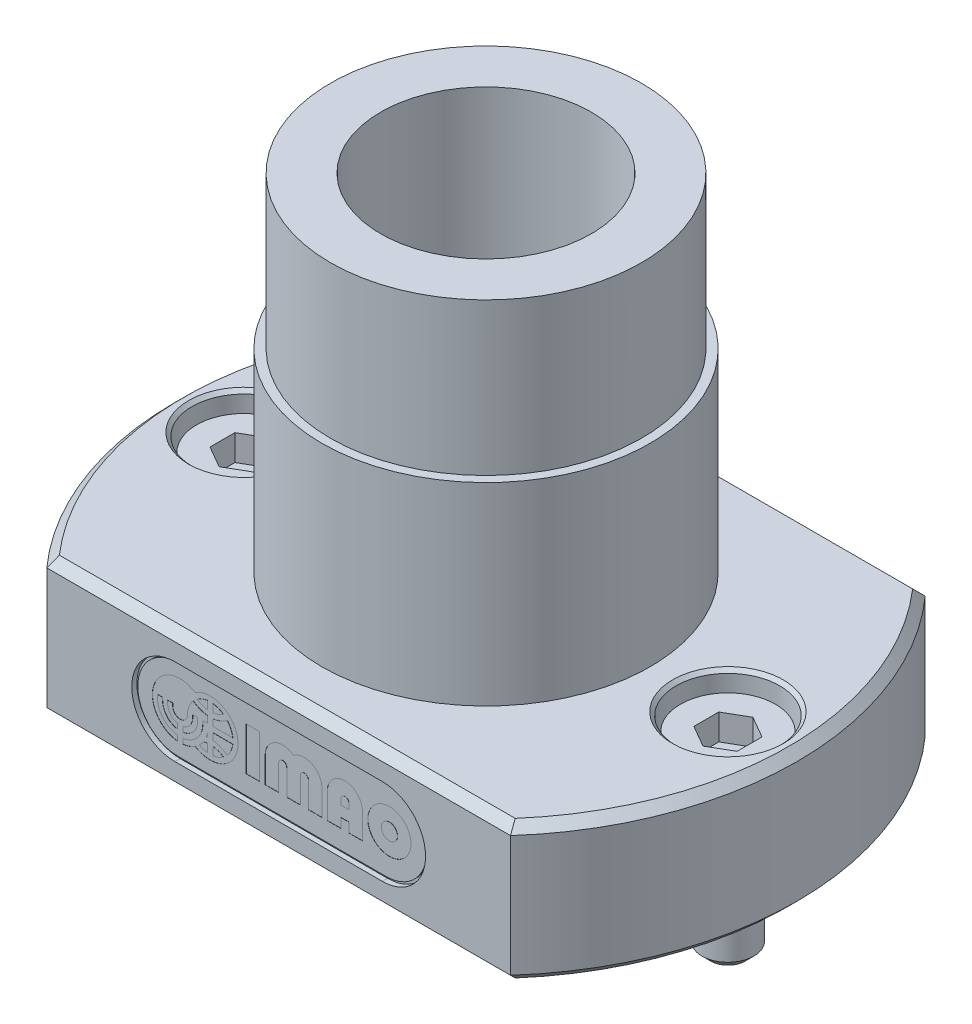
ISO-10303-21;
HEADER;
FILE_DESCRIPTION(('STEP AP214'),'2;1');
FILE_NAME('part.step','',(''),(''),'','','');
FILE_SCHEMA(('AUTOMOTIVE_DESIGN { 1 0 10303 214 1 1 1 1 }'));
ENDSEC;
DATA;
#1=APPLICATION_CONTEXT('core data for automotive mechanical design processes');
#2=APPLICATION_PROTOCOL_DEFINITION('international standard','automotive_design',2000,#1);
#3=PRODUCT_CONTEXT('',#1,'mechanical');
#4=PRODUCT('Part','Part','',(#3));
#5=PRODUCT_RELATED_PRODUCT_CATEGORY('part','',(#4));
#6=PRODUCT_DEFINITION_FORMATION('','',#4);
#7=PRODUCT_DEFINITION_CONTEXT('part definition',#1,'design');
#8=PRODUCT_DEFINITION('design','',#6,#7);
#9=PRODUCT_DEFINITION_SHAPE('','',#8);
#10=(LENGTH_UNIT() NAMED_UNIT(*) SI_UNIT(.MILLI.,.METRE.));
#11=(NAMED_UNIT(*) PLANE_ANGLE_UNIT() SI_UNIT($,.RADIAN.));
#12=(NAMED_UNIT(*) SI_UNIT($,.STERADIAN.) SOLID_ANGLE_UNIT());
#13=UNCERTAINTY_MEASURE_WITH_UNIT(LENGTH_MEASURE(1.E-05),#10,'distance_accuracy_value','');
#14=(GEOMETRIC_REPRESENTATION_CONTEXT(3) GLOBAL_UNCERTAINTY_ASSIGNED_CONTEXT((#13)) GLOBAL_UNIT_ASSIGNED_CONTEXT((#10,
#11,#12)) REPRESENTATION_CONTEXT('',''));
#15=CARTESIAN_POINT('',(0.,0.,0.));
#16=DIRECTION('',(0.,0.,1.));
#17=DIRECTION('',(1.,0.,0.));
#18=AXIS2_PLACEMENT_3D('',#15,#16,#17);
#19=CARTESIAN_POINT('',(-14.,5.5,-1.44337567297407));
#20=DIRECTION('',(-0.500000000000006,0.,0.866025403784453));
#21=DIRECTION('',(0.866025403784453,0.,0.500000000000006));
#22=AXIS2_PLACEMENT_3D('',#19,#20,#21);
#23=PLANE('',#22);
#24=DIRECTION('',(0.,1.,0.));
#25=VECTOR('',#24,1.);
#26=CARTESIAN_POINT('',(-12.75,5.5,-0.721687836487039));
#27=LINE('',#26,#25);
#28=CARTESIAN_POINT('',(-12.75,5.5,-0.721687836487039));
#29=VERTEX_POINT('',#28);
#30=CARTESIAN_POINT('',(-12.75,7.,-0.721687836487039));
#31=VERTEX_POINT('',#30);
#32=EDGE_CURVE('E1747',#29,#31,#27,.T.);
#33=ORIENTED_EDGE('',*,*,#32,.T.);
#34=DIRECTION('',(0.866025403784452,0.,0.500000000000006));
#35=VECTOR('',#34,1.);
#36=CARTESIAN_POINT('',(-14.,7.,-1.44337567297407));
#37=LINE('',#36,#35);
#38=CARTESIAN_POINT('',(-14.,7.,-1.44337567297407));
#39=VERTEX_POINT('',#38);
#40=EDGE_CURVE('E30',#39,#31,#37,.T.);
#41=ORIENTED_EDGE('',*,*,#40,.F.);
#42=DIRECTION('',(0.,1.,0.));
#43=VECTOR('',#42,1.);
#44=CARTESIAN_POINT('',(-14.,5.5,-1.44337567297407));
#45=LINE('',#44,#43);
#46=CARTESIAN_POINT('',(-14.,5.5,-1.44337567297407));
#47=VERTEX_POINT('',#46);
#48=EDGE_CURVE('E34',#47,#39,#45,.T.);
#49=ORIENTED_EDGE('',*,*,#48,.F.);
#50=DIRECTION('',(0.866025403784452,0.,0.500000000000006));
#51=VECTOR('',#50,1.);
#52=CARTESIAN_POINT('',(-14.,5.5,-1.44337567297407));
#53=LINE('',#52,#51);
#54=EDGE_CURVE('E1707',#47,#29,#53,.T.);
#55=ORIENTED_EDGE('',*,*,#54,.T.);
#56=EDGE_LOOP('',(#33,#41,#49,#55));
#57=FACE_BOUND('',#56,.T.);
#58=ADVANCED_FACE('F15',(#57),#23,.T.);
#59=CARTESIAN_POINT('',(-12.75,5.5,0.721687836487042));
#60=DIRECTION('',(1.00000000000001,0.,0.));
#61=DIRECTION('',(0.,0.,-1.00000000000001));
#62=AXIS2_PLACEMENT_3D('',#59,#60,#61);
#63=PLANE('',#62);
#64=DIRECTION('',(0.,1.,0.));
#65=VECTOR('',#64,1.);
#66=CARTESIAN_POINT('',(-12.75,5.5,0.721687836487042));
#67=LINE('',#66,#65);
#68=CARTESIAN_POINT('',(-12.75,5.5,0.721687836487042));
#69=VERTEX_POINT('',#68);
#70=CARTESIAN_POINT('',(-12.75,7.,0.721687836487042));
#71=VERTEX_POINT('',#70);
#72=EDGE_CURVE('E1745',#69,#71,#67,.T.);
#73=ORIENTED_EDGE('',*,*,#72,.T.);
#74=DIRECTION('',(0.,0.,-1.00000000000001));
#75=VECTOR('',#74,1.);
#76=CARTESIAN_POINT('',(-12.75,7.,0.721687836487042));
#77=LINE('',#76,#75);
#78=EDGE_CURVE('E1717',#71,#31,#77,.T.);
#79=ORIENTED_EDGE('',*,*,#78,.T.);
#80=ORIENTED_EDGE('',*,*,#32,.F.);
#81=DIRECTION('',(0.,0.,-1.00000000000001));
#82=VECTOR('',#81,1.);
#83=CARTESIAN_POINT('',(-12.75,5.5,0.721687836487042));
#84=LINE('',#83,#82);
#85=EDGE_CURVE('E1734',#69,#29,#84,.T.);
#86=ORIENTED_EDGE('',*,*,#85,.F.);
#87=EDGE_LOOP('',(#73,#79,#80,#86));
#88=FACE_BOUND('',#87,.T.);
#89=ADVANCED_FACE('F1789',(#88),#63,.F.);
#90=CARTESIAN_POINT('',(-14.,5.5,1.44337567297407));
#91=DIRECTION('',(0.500000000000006,0.,0.866025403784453));
#92=DIRECTION('',(0.866025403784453,0.,-0.500000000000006));
#93=AXIS2_PLACEMENT_3D('',#90,#91,#92);
#94=PLANE('',#93);
#95=DIRECTION('',(0.,1.,0.));
#96=VECTOR('',#95,1.);
#97=CARTESIAN_POINT('',(-14.,5.5,1.44337567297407));
#98=LINE('',#97,#96);
#99=CARTESIAN_POINT('',(-14.,5.5,1.44337567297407));
#100=VERTEX_POINT('',#99);
#101=CARTESIAN_POINT('',(-14.,7.,1.44337567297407));
#102=VERTEX_POINT('',#101);
#103=EDGE_CURVE('E1743',#100,#102,#98,.T.);
#104=ORIENTED_EDGE('',*,*,#103,.T.);
#105=DIRECTION('',(0.866025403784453,0.,-0.500000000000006));
#106=VECTOR('',#105,1.);
#107=CARTESIAN_POINT('',(-14.,7.,1.44337567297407));
#108=LINE('',#107,#106);
#109=EDGE_CURVE('E1714',#102,#71,#108,.T.);
#110=ORIENTED_EDGE('',*,*,#109,.T.);
#111=ORIENTED_EDGE('',*,*,#72,.F.);
#112=DIRECTION('',(0.866025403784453,0.,-0.500000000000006));
#113=VECTOR('',#112,1.);
#114=CARTESIAN_POINT('',(-14.,5.5,1.44337567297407));
#115=LINE('',#114,#113);
#116=EDGE_CURVE('E1731',#100,#69,#115,.T.);
#117=ORIENTED_EDGE('',*,*,#116,.F.);
#118=EDGE_LOOP('',(#104,#110,#111,#117));
#119=FACE_BOUND('',#118,.T.);
#120=ADVANCED_FACE('F1795',(#119),#94,.F.);
#121=CARTESIAN_POINT('',(-14.,5.5,1.44337567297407));
#122=DIRECTION('',(0.500000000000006,0.,-0.866025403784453));
#123=DIRECTION('',(-0.866025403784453,0.,-0.500000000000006));
#124=AXIS2_PLACEMENT_3D('',#121,#122,#123);
#125=PLANE('',#124);
#126=DIRECTION('',(0.,1.,0.));
#127=VECTOR('',#126,1.);
#128=CARTESIAN_POINT('',(-15.25,5.5,0.721687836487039));
#129=LINE('',#128,#127);
#130=CARTESIAN_POINT('',(-15.25,5.5,0.721687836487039));
#131=VERTEX_POINT('',#130);
#132=CARTESIAN_POINT('',(-15.25,7.,0.721687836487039));
#133=VERTEX_POINT('',#132);
#134=EDGE_CURVE('E1741',#131,#133,#129,.T.);
#135=ORIENTED_EDGE('',*,*,#134,.T.);
#136=DIRECTION('',(-0.866025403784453,0.,-0.500000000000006));
#137=VECTOR('',#136,1.);
#138=CARTESIAN_POINT('',(-14.,7.,1.44337567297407));
#139=LINE('',#138,#137);
#140=EDGE_CURVE('E1711',#102,#133,#139,.T.);
#141=ORIENTED_EDGE('',*,*,#140,.F.);
#142=ORIENTED_EDGE('',*,*,#103,.F.);
#143=DIRECTION('',(-0.866025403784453,0.,-0.500000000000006));
#144=VECTOR('',#143,1.);
#145=CARTESIAN_POINT('',(-14.,5.5,1.44337567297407));
#146=LINE('',#145,#144);
#147=EDGE_CURVE('E1728',#100,#131,#146,.T.);
#148=ORIENTED_EDGE('',*,*,#147,.T.);
#149=EDGE_LOOP('',(#135,#141,#142,#148));
#150=FACE_BOUND('',#149,.T.);
#151=ADVANCED_FACE('F1808',(#150),#125,.T.);
#152=CARTESIAN_POINT('',(-15.25,5.5,-0.72168783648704));
#153=DIRECTION('',(-1.00000000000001,0.,0.));
#154=DIRECTION('',(0.,0.,1.00000000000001));
#155=AXIS2_PLACEMENT_3D('',#152,#153,#154);
#156=PLANE('',#155);
#157=DIRECTION('',(0.,1.,0.));
#158=VECTOR('',#157,1.);
#159=CARTESIAN_POINT('',(-15.25,5.5,-0.72168783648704));
#160=LINE('',#159,#158);
#161=CARTESIAN_POINT('',(-15.25,5.5,-0.72168783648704));
#162=VERTEX_POINT('',#161);
#163=CARTESIAN_POINT('',(-15.25,7.,-0.72168783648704));
#164=VERTEX_POINT('',#163);
#165=EDGE_CURVE('E1739',#162,#164,#160,.T.);
#166=ORIENTED_EDGE('',*,*,#165,.T.);
#167=DIRECTION('',(0.,0.,1.00000000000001));
#168=VECTOR('',#167,1.);
#169=CARTESIAN_POINT('',(-15.25,7.,-0.72168783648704));
#170=LINE('',#169,#168);
#171=EDGE_CURVE('E1708',#164,#133,#170,.T.);
#172=ORIENTED_EDGE('',*,*,#171,.T.);
#173=ORIENTED_EDGE('',*,*,#134,.F.);
#174=DIRECTION('',(0.,0.,1.00000000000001));
#175=VECTOR('',#174,1.);
#176=CARTESIAN_POINT('',(-15.25,5.5,-0.72168783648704));
#177=LINE('',#176,#175);
#178=EDGE_CURVE('E1725',#162,#131,#177,.T.);
#179=ORIENTED_EDGE('',*,*,#178,.F.);
#180=EDGE_LOOP('',(#166,#172,#173,#179));
#181=FACE_BOUND('',#180,.T.);
#182=ADVANCED_FACE('F1803',(#181),#156,.F.);
#183=CARTESIAN_POINT('',(-14.,5.5,-1.44337567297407));
#184=DIRECTION('',(-0.500000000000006,0.,-0.866025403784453));
#185=DIRECTION('',(-0.866025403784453,0.,0.500000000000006));
#186=AXIS2_PLACEMENT_3D('',#183,#184,#185);
#187=PLANE('',#186);
#188=DIRECTION('',(-0.866025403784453,0.,0.500000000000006));
#189=VECTOR('',#188,1.);
#190=CARTESIAN_POINT('',(-14.,5.5,-1.44337567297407));
#191=LINE('',#190,#189);
#192=EDGE_CURVE('E1722',#47,#162,#191,.T.);
#193=ORIENTED_EDGE('',*,*,#192,.F.);
#194=ORIENTED_EDGE('',*,*,#48,.T.);
#195=DIRECTION('',(-0.866025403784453,0.,0.500000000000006));
#196=VECTOR('',#195,1.);
#197=CARTESIAN_POINT('',(-14.,7.,-1.44337567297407));
#198=LINE('',#197,#196);
#199=EDGE_CURVE('E1704',#39,#164,#198,.T.);
#200=ORIENTED_EDGE('',*,*,#199,.T.);
#201=ORIENTED_EDGE('',*,*,#165,.F.);
#202=EDGE_LOOP('',(#193,#194,#200,#201));
#203=FACE_BOUND('',#202,.T.);
#204=ADVANCED_FACE('F1800',(#203),#187,.F.);
#205=CARTESIAN_POINT('',(-12.75,5.5,-0.721687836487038));
#206=DIRECTION('',(0.,1.,0.));
#207=DIRECTION('',(1.00000000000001,0.,0.));
#208=AXIS2_PLACEMENT_3D('',#205,#206,#207);
#209=PLANE('',#208);
#210=ORIENTED_EDGE('',*,*,#54,.F.);
#211=ORIENTED_EDGE('',*,*,#192,.T.);
#212=ORIENTED_EDGE('',*,*,#178,.T.);
#213=ORIENTED_EDGE('',*,*,#147,.F.);
#214=ORIENTED_EDGE('',*,*,#116,.T.);
#215=ORIENTED_EDGE('',*,*,#85,.T.);
#216=EDGE_LOOP('',(#210,#211,#212,#213,#214,#215));
#217=FACE_BOUND('',#216,.T.);
#218=ADVANCED_FACE('F1799',(#217),#209,.T.);
#219=CARTESIAN_POINT('',(-14.,7.,0.));
#220=DIRECTION('',(0.,1.,0.));
#221=DIRECTION('',(1.00000000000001,0.,0.));
#222=AXIS2_PLACEMENT_3D('',#219,#220,#221);
#223=PLANE('',#222);
#224=CARTESIAN_POINT('',(-14.,7.,0.));
#225=DIRECTION('',(0.,1.,0.));
#226=DIRECTION('',(1.00000000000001,0.,0.));
#227=AXIS2_PLACEMENT_3D('',#224,#225,#226);
#228=CIRCLE('',#227,2.75);
#229=CARTESIAN_POINT('',(-11.25,7.,0.));
#230=VERTEX_POINT('',#229);
#231=EDGE_CURVE('E1749',#230,#230,#228,.T.);
#232=ORIENTED_EDGE('',*,*,#231,.T.);
#233=EDGE_LOOP('',(#232));
#234=FACE_BOUND('',#233,.T.);
#235=ORIENTED_EDGE('',*,*,#199,.F.);
#236=ORIENTED_EDGE('',*,*,#40,.T.);
#237=ORIENTED_EDGE('',*,*,#78,.F.);
#238=ORIENTED_EDGE('',*,*,#109,.F.);
#239=ORIENTED_EDGE('',*,*,#140,.T.);
#240=ORIENTED_EDGE('',*,*,#171,.F.);
#241=EDGE_LOOP('',(#235,#236,#237,#238,#239,#240));
#242=FACE_BOUND('',#241,.T.);
#243=ADVANCED_FACE('F1805',(#234,#242),#223,.T.);
#244=CARTESIAN_POINT('',(-14.,14.,0.));
#245=DIRECTION('',(0.,1.,0.));
#246=DIRECTION('',(1.00000000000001,0.,0.));
#247=AXIS2_PLACEMENT_3D('',#244,#245,#246);
#248=CYLINDRICAL_SURFACE('',#247,2.75);
#249=CARTESIAN_POINT('',(-14.,4.,0.));
#250=DIRECTION('',(0.,1.,0.));
#251=DIRECTION('',(0.,0.,1.));
#252=AXIS2_PLACEMENT_3D('',#249,#250,#251);
#253=CIRCLE('',#252,2.75);
#254=CARTESIAN_POINT('',(-14.,4.,2.75));
#255=VERTEX_POINT('',#254);
#256=EDGE_CURVE('E1701',#255,#255,#253,.F.);
#257=ORIENTED_EDGE('',*,*,#256,.F.);
#258=EDGE_LOOP('',(#257));
#259=FACE_BOUND('',#258,.T.);
#260=ORIENTED_EDGE('',*,*,#231,.F.);
#261=EDGE_LOOP('',(#260));
#262=FACE_BOUND('',#261,.T.);
#263=ADVANCED_FACE('F1816',(#259,#262),#248,.T.);
#264=CARTESIAN_POINT('',(14.,5.5,1.44337567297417));
#265=DIRECTION('',(0.500000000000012,0.,-0.866025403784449));
#266=DIRECTION('',(-0.866025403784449,0.,-0.500000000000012));
#267=AXIS2_PLACEMENT_3D('',#264,#265,#266);
#268=PLANE('',#267);
#269=DIRECTION('',(0.,1.,0.));
#270=VECTOR('',#269,1.);
#271=CARTESIAN_POINT('',(12.75,5.5,0.721687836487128));
#272=LINE('',#271,#270);
#273=CARTESIAN_POINT('',(12.75,5.5,0.721687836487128));
#274=VERTEX_POINT('',#273);
#275=CARTESIAN_POINT('',(12.75,7.,0.721687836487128));
#276=VERTEX_POINT('',#275);
#277=EDGE_CURVE('E1684',#274,#276,#272,.T.);
#278=ORIENTED_EDGE('',*,*,#277,.T.);
#279=DIRECTION('',(-0.866025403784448,0.,-0.500000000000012));
#280=VECTOR('',#279,1.);
#281=CARTESIAN_POINT('',(14.,7.,1.44337567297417));
#282=LINE('',#281,#280);
#283=CARTESIAN_POINT('',(14.,7.,1.44337567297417));
#284=VERTEX_POINT('',#283);
#285=EDGE_CURVE('E1636',#284,#276,#282,.T.);
#286=ORIENTED_EDGE('',*,*,#285,.F.);
#287=DIRECTION('',(0.,1.,0.));
#288=VECTOR('',#287,1.);
#289=CARTESIAN_POINT('',(14.,5.5,1.44337567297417));
#290=LINE('',#289,#288);
#291=CARTESIAN_POINT('',(14.,5.5,1.44337567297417));
#292=VERTEX_POINT('',#291);
#293=EDGE_CURVE('E1659',#292,#284,#290,.T.);
#294=ORIENTED_EDGE('',*,*,#293,.F.);
#295=DIRECTION('',(-0.866025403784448,0.,-0.500000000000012));
#296=VECTOR('',#295,1.);
#297=CARTESIAN_POINT('',(14.,5.5,1.44337567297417));
#298=LINE('',#297,#296);
#299=EDGE_CURVE('E1640',#292,#274,#298,.T.);
#300=ORIENTED_EDGE('',*,*,#299,.T.);
#301=EDGE_LOOP('',(#278,#286,#294,#300));
#302=FACE_BOUND('',#301,.T.);
#303=ADVANCED_FACE('F1818',(#302),#268,.T.);
#304=CARTESIAN_POINT('',(12.75,5.5,-0.721687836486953));
#305=DIRECTION('',(-1.00000000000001,0.,0.));
#306=DIRECTION('',(0.,0.,1.00000000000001));
#307=AXIS2_PLACEMENT_3D('',#304,#305,#306);
#308=PLANE('',#307);
#309=DIRECTION('',(0.,1.,0.));
#310=VECTOR('',#309,1.);
#311=CARTESIAN_POINT('',(12.75,5.5,-0.721687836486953));
#312=LINE('',#311,#310);
#313=CARTESIAN_POINT('',(12.75,5.5,-0.721687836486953));
#314=VERTEX_POINT('',#313);
#315=CARTESIAN_POINT('',(12.75,7.,-0.721687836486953));
#316=VERTEX_POINT('',#315);
#317=EDGE_CURVE('E1682',#314,#316,#312,.T.);
#318=ORIENTED_EDGE('',*,*,#317,.T.);
#319=DIRECTION('',(0.,0.,1.00000000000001));
#320=VECTOR('',#319,1.);
#321=CARTESIAN_POINT('',(12.75,7.,-0.721687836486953));
#322=LINE('',#321,#320);
#323=EDGE_CURVE('E1650',#316,#276,#322,.T.);
#324=ORIENTED_EDGE('',*,*,#323,.T.);
#325=ORIENTED_EDGE('',*,*,#277,.F.);
#326=DIRECTION('',(0.,0.,1.00000000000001));
#327=VECTOR('',#326,1.);
#328=CARTESIAN_POINT('',(12.75,5.5,-0.721687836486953));
#329=LINE('',#328,#327);
#330=EDGE_CURVE('E1669',#314,#274,#329,.T.);
#331=ORIENTED_EDGE('',*,*,#330,.F.);
#332=EDGE_LOOP('',(#318,#324,#325,#331));
#333=FACE_BOUND('',#332,.T.);
#334=ADVANCED_FACE('F3080',(#333),#308,.F.);
#335=CARTESIAN_POINT('',(14.,5.5,-1.44337567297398));
#336=DIRECTION('',(-0.5,0.,-0.866025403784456));
#337=DIRECTION('',(-0.866025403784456,0.,0.5));
#338=AXIS2_PLACEMENT_3D('',#335,#336,#337);
#339=PLANE('',#338);
#340=DIRECTION('',(0.,1.,0.));
#341=VECTOR('',#340,1.);
#342=CARTESIAN_POINT('',(14.,5.5,-1.44337567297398));
#343=LINE('',#342,#341);
#344=CARTESIAN_POINT('',(14.,5.5,-1.44337567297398));
#345=VERTEX_POINT('',#344);
#346=CARTESIAN_POINT('',(14.,7.,-1.44337567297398));
#347=VERTEX_POINT('',#346);
#348=EDGE_CURVE('E1680',#345,#347,#343,.T.);
#349=ORIENTED_EDGE('',*,*,#348,.T.);
#350=DIRECTION('',(-0.866025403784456,0.,0.5));
#351=VECTOR('',#350,1.);
#352=CARTESIAN_POINT('',(14.,7.,-1.44337567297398));
#353=LINE('',#352,#351);
#354=EDGE_CURVE('E1647',#347,#316,#353,.T.);
#355=ORIENTED_EDGE('',*,*,#354,.T.);
#356=ORIENTED_EDGE('',*,*,#317,.F.);
#357=DIRECTION('',(-0.866025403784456,0.,0.5));
#358=VECTOR('',#357,1.);
#359=CARTESIAN_POINT('',(14.,5.5,-1.44337567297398));
#360=LINE('',#359,#358);
#361=EDGE_CURVE('E1666',#345,#314,#360,.T.);
#362=ORIENTED_EDGE('',*,*,#361,.F.);
#363=EDGE_LOOP('',(#349,#355,#356,#362));
#364=FACE_BOUND('',#363,.T.);
#365=ADVANCED_FACE('F3083',(#364),#339,.F.);
#366=CARTESIAN_POINT('',(14.,5.5,-1.44337567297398));
#367=DIRECTION('',(-0.500000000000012,0.,0.866025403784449));
#368=DIRECTION('',(0.866025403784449,0.,0.500000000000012));
#369=AXIS2_PLACEMENT_3D('',#366,#367,#368);
#370=PLANE('',#369);
#371=DIRECTION('',(0.,1.,0.));
#372=VECTOR('',#371,1.);
#373=CARTESIAN_POINT('',(15.25,5.5,-0.721687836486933));
#374=LINE('',#373,#372);
#375=CARTESIAN_POINT('',(15.25,5.5,-0.721687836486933));
#376=VERTEX_POINT('',#375);
#377=CARTESIAN_POINT('',(15.25,7.,-0.721687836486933));
#378=VERTEX_POINT('',#377);
#379=EDGE_CURVE('E1678',#376,#378,#374,.T.);
#380=ORIENTED_EDGE('',*,*,#379,.T.);
#381=DIRECTION('',(0.866025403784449,0.,0.500000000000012));
#382=VECTOR('',#381,1.);
#383=CARTESIAN_POINT('',(14.,7.,-1.44337567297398));
#384=LINE('',#383,#382);
#385=EDGE_CURVE('E1644',#347,#378,#384,.T.);
#386=ORIENTED_EDGE('',*,*,#385,.F.);
#387=ORIENTED_EDGE('',*,*,#348,.F.);
#388=DIRECTION('',(0.866025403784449,0.,0.500000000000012));
#389=VECTOR('',#388,1.);
#390=CARTESIAN_POINT('',(14.,5.5,-1.44337567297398));
#391=LINE('',#390,#389);
#392=EDGE_CURVE('E1663',#345,#376,#391,.T.);
#393=ORIENTED_EDGE('',*,*,#392,.T.);
#394=EDGE_LOOP('',(#380,#386,#387,#393));
#395=FACE_BOUND('',#394,.T.);
#396=ADVANCED_FACE('F3087',(#395),#370,.T.);
#397=CARTESIAN_POINT('',(15.25,5.5,0.721687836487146));
#398=DIRECTION('',(1.00000000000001,0.,0.));
#399=DIRECTION('',(0.,0.,-1.00000000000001));
#400=AXIS2_PLACEMENT_3D('',#397,#398,#399);
#401=PLANE('',#400);
#402=DIRECTION('',(0.,1.,0.));
#403=VECTOR('',#402,1.);
#404=CARTESIAN_POINT('',(15.25,5.5,0.721687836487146));
#405=LINE('',#404,#403);
#406=CARTESIAN_POINT('',(15.25,5.5,0.721687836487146));
#407=VERTEX_POINT('',#406);
#408=CARTESIAN_POINT('',(15.25,7.,0.721687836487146));
#409=VERTEX_POINT('',#408);
#410=EDGE_CURVE('E1676',#407,#409,#405,.T.);
#411=ORIENTED_EDGE('',*,*,#410,.T.);
#412=DIRECTION('',(0.,0.,-1.00000000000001));
#413=VECTOR('',#412,1.);
#414=CARTESIAN_POINT('',(15.25,7.,0.721687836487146));
#415=LINE('',#414,#413);
#416=EDGE_CURVE('E1641',#409,#378,#415,.T.);
#417=ORIENTED_EDGE('',*,*,#416,.T.);
#418=ORIENTED_EDGE('',*,*,#379,.F.);
#419=DIRECTION('',(0.,0.,-1.00000000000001));
#420=VECTOR('',#419,1.);
#421=CARTESIAN_POINT('',(15.25,5.5,0.721687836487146));
#422=LINE('',#421,#420);
#423=EDGE_CURVE('E1660',#407,#376,#422,.T.);
#424=ORIENTED_EDGE('',*,*,#423,.F.);
#425=EDGE_LOOP('',(#411,#417,#418,#424));
#426=FACE_BOUND('',#425,.T.);
#427=ADVANCED_FACE('F3091',(#426),#401,.F.);
#428=CARTESIAN_POINT('',(14.,5.5,1.44337567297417));
#429=DIRECTION('',(0.5,0.,0.866025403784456));
#430=DIRECTION('',(0.866025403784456,0.,-0.5));
#431=AXIS2_PLACEMENT_3D('',#428,#429,#430);
#432=PLANE('',#431);
#433=DIRECTION('',(0.866025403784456,0.,-0.5));
#434=VECTOR('',#433,1.);
#435=CARTESIAN_POINT('',(14.,5.5,1.44337567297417));
#436=LINE('',#435,#434);
#437=EDGE_CURVE('E1656',#292,#407,#436,.T.);
#438=ORIENTED_EDGE('',*,*,#437,.F.);
#439=ORIENTED_EDGE('',*,*,#293,.T.);
#440=DIRECTION('',(0.866025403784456,0.,-0.5));
#441=VECTOR('',#440,1.);
#442=CARTESIAN_POINT('',(14.,7.,1.44337567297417));
#443=LINE('',#442,#441);
#444=EDGE_CURVE('E1637',#284,#409,#443,.T.);
#445=ORIENTED_EDGE('',*,*,#444,.T.);
#446=ORIENTED_EDGE('',*,*,#410,.F.);
#447=EDGE_LOOP('',(#438,#439,#445,#446));
#448=FACE_BOUND('',#447,.T.);
#449=ADVANCED_FACE('F3075',(#448),#432,.F.);
#450=CARTESIAN_POINT('',(12.75,5.5,0.721687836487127));
#451=DIRECTION('',(0.,1.,0.));
#452=DIRECTION('',(-1.00000000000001,0.,0.));
#453=AXIS2_PLACEMENT_3D('',#450,#451,#452);
#454=PLANE('',#453);
#455=ORIENTED_EDGE('',*,*,#299,.F.);
#456=ORIENTED_EDGE('',*,*,#437,.T.);
#457=ORIENTED_EDGE('',*,*,#423,.T.);
#458=ORIENTED_EDGE('',*,*,#392,.F.);
#459=ORIENTED_EDGE('',*,*,#361,.T.);
#460=ORIENTED_EDGE('',*,*,#330,.T.);
#461=EDGE_LOOP('',(#455,#456,#457,#458,#459,#460));
#462=FACE_BOUND('',#461,.T.);
#463=ADVANCED_FACE('F3073',(#462),#454,.T.);
#464=CARTESIAN_POINT('',(14.,7.,0.));
#465=DIRECTION('',(0.,1.,0.));
#466=DIRECTION('',(-1.00000000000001,0.,0.));
#467=AXIS2_PLACEMENT_3D('',#464,#465,#466);
#468=PLANE('',#467);
#469=CARTESIAN_POINT('',(14.,7.,0.));
#470=DIRECTION('',(0.,1.,0.));
#471=DIRECTION('',(-1.00000000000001,0.,0.));
#472=AXIS2_PLACEMENT_3D('',#469,#470,#471);
#473=CIRCLE('',#472,2.75);
#474=CARTESIAN_POINT('',(11.25,7.,0.));
#475=VERTEX_POINT('',#474);
#476=EDGE_CURVE('E1686',#475,#475,#473,.T.);
#477=ORIENTED_EDGE('',*,*,#476,.T.);
#478=EDGE_LOOP('',(#477));
#479=FACE_BOUND('',#478,.T.);
#480=ORIENTED_EDGE('',*,*,#444,.F.);
#481=ORIENTED_EDGE('',*,*,#285,.T.);
#482=ORIENTED_EDGE('',*,*,#323,.F.);
#483=ORIENTED_EDGE('',*,*,#354,.F.);
#484=ORIENTED_EDGE('',*,*,#385,.T.);
#485=ORIENTED_EDGE('',*,*,#416,.F.);
#486=EDGE_LOOP('',(#480,#481,#482,#483,#484,#485));
#487=FACE_BOUND('',#486,.T.);
#488=ADVANCED_FACE('F3069',(#479,#487),#468,.T.);
#489=CARTESIAN_POINT('',(14.,14.,0.));
#490=DIRECTION('',(0.,1.,0.));
#491=DIRECTION('',(-1.00000000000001,0.,0.));
#492=AXIS2_PLACEMENT_3D('',#489,#490,#491);
#493=CYLINDRICAL_SURFACE('',#492,2.75);
#494=CARTESIAN_POINT('',(14.,4.,0.));
#495=DIRECTION('',(0.,1.,0.));
#496=DIRECTION('',(0.,0.,1.));
#497=AXIS2_PLACEMENT_3D('',#494,#495,#496);
#498=CIRCLE('',#497,2.75);
#499=CARTESIAN_POINT('',(14.,4.,2.7500000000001));
#500=VERTEX_POINT('',#499);
#501=EDGE_CURVE('E1632',#500,#500,#498,.F.);
#502=ORIENTED_EDGE('',*,*,#501,.F.);
#503=EDGE_LOOP('',(#502));
#504=FACE_BOUND('',#503,.T.);
#505=ORIENTED_EDGE('',*,*,#476,.F.);
#506=EDGE_LOOP('',(#505));
#507=FACE_BOUND('',#506,.T.);
#508=ADVANCED_FACE('F3072',(#504,#507),#493,.T.);
#509=CARTESIAN_POINT('',(0.,0.,0.));
#510=DIRECTION('',(0.,-1.,0.));
#511=DIRECTION('',(1.,0.,0.));
#512=AXIS2_PLACEMENT_3D('',#509,#510,#511);
#513=CYLINDRICAL_SURFACE('',#512,9.);
#514=CARTESIAN_POINT('',(0.,19.2,0.));
#515=DIRECTION('',(0.,1.,0.));
#516=DIRECTION('',(0.,0.,1.));
#517=AXIS2_PLACEMENT_3D('',#514,#515,#516);
#518=CIRCLE('',#517,9.);
#519=CARTESIAN_POINT('',(0.,19.2,9.));
#520=VERTEX_POINT('',#519);
#521=EDGE_CURVE('E1629',#520,#520,#518,.F.);
#522=ORIENTED_EDGE('',*,*,#521,.F.);
#523=EDGE_LOOP('',(#522));
#524=FACE_BOUND('',#523,.T.);
#525=CARTESIAN_POINT('',(0.,28.,0.));
#526=DIRECTION('',(0.,-1.,0.));
#527=DIRECTION('',(0.,0.,-1.));
#528=AXIS2_PLACEMENT_3D('',#525,#526,#527);
#529=CIRCLE('',#528,9.);
#530=CARTESIAN_POINT('',(0.,28.,-9.));
#531=VERTEX_POINT('',#530);
#532=EDGE_CURVE('E3611',#531,#531,#529,.T.);
#533=ORIENTED_EDGE('',*,*,#532,.T.);
#534=EDGE_LOOP('',(#533));
#535=FACE_BOUND('',#534,.T.);
#536=ADVANCED_FACE('F3077',(#524,#535),#513,.T.);
#537=CARTESIAN_POINT('',(0.,19.2,0.));
#538=DIRECTION('',(0.,1.,0.));
#539=DIRECTION('',(0.,0.,1.));
#540=AXIS2_PLACEMENT_3D('',#537,#538,#539);
#541=PLANE('',#540);
#542=CARTESIAN_POINT('',(0.,19.2,0.));
#543=DIRECTION('',(0.,1.,0.));
#544=DIRECTION('',(0.,0.,1.));
#545=AXIS2_PLACEMENT_3D('',#542,#543,#544);
#546=CIRCLE('',#545,9.5);
#547=CARTESIAN_POINT('',(0.,19.2,9.5));
#548=VERTEX_POINT('',#547);
#549=EDGE_CURVE('E1373',#548,#548,#546,.T.);
#550=ORIENTED_EDGE('',*,*,#549,.T.);
#551=EDGE_LOOP('',(#550));
#552=FACE_BOUND('',#551,.T.);
#553=ORIENTED_EDGE('',*,*,#521,.T.);
#554=EDGE_LOOP('',(#553));
#555=FACE_BOUND('',#554,.T.);
#556=ADVANCED_FACE('F3139',(#552,#555),#541,.T.);
#557=CARTESIAN_POINT('',(0.,19.2,0.));
#558=DIRECTION('',(0.,-1.,0.));
#559=DIRECTION('',(0.,0.,-1.));
#560=AXIS2_PLACEMENT_3D('',#557,#558,#559);
#561=CYLINDRICAL_SURFACE('',#560,9.5);
#562=CARTESIAN_POINT('',(0.,8.,0.));
#563=DIRECTION('',(0.,1.,0.));
#564=DIRECTION('',(0.,0.,1.));
#565=AXIS2_PLACEMENT_3D('',#562,#563,#564);
#566=CIRCLE('',#565,9.5);
#567=CARTESIAN_POINT('',(0.,8.,9.5));
#568=VERTEX_POINT('',#567);
#569=EDGE_CURVE('E1367',#568,#568,#566,.T.);
#570=ORIENTED_EDGE('',*,*,#569,.T.);
#571=EDGE_LOOP('',(#570));
#572=FACE_BOUND('',#571,.T.);
#573=ORIENTED_EDGE('',*,*,#549,.F.);
#574=EDGE_LOOP('',(#573));
#575=FACE_BOUND('',#574,.T.);
#576=ADVANCED_FACE('F3148',(#572,#575),#561,.T.);
#577=CARTESIAN_POINT('',(0.,8.,0.));
#578=DIRECTION('',(0.,1.,0.));
#579=DIRECTION('',(0.,0.,1.));
#580=AXIS2_PLACEMENT_3D('',#577,#578,#579);
#581=PLANE('',#580);
#582=CARTESIAN_POINT('',(0.,8.,0.));
#583=DIRECTION('',(0.,1.,0.));
#584=DIRECTION('',(0.,0.,1.));
#585=AXIS2_PLACEMENT_3D('',#582,#583,#584);
#586=CIRCLE('',#585,17.5);
#587=CARTESIAN_POINT('',(13.1909059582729,8.,11.5));
#588=VERTEX_POINT('',#587);
#589=CARTESIAN_POINT('',(13.1909059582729,8.,-11.5));
#590=VERTEX_POINT('',#589);
#591=EDGE_CURVE('E1511',#588,#590,#586,.T.);
#592=ORIENTED_EDGE('',*,*,#591,.T.);
#593=DIRECTION('',(-1.,0.,0.));
#594=VECTOR('',#593,1.);
#595=CARTESIAN_POINT('',(-13.4164078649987,8.,-11.5));
#596=LINE('',#595,#594);
#597=CARTESIAN_POINT('',(-13.1909059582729,8.,-11.5));
#598=VERTEX_POINT('',#597);
#599=EDGE_CURVE('E1514',#590,#598,#596,.T.);
#600=ORIENTED_EDGE('',*,*,#599,.T.);
#601=CARTESIAN_POINT('',(0.,8.,0.));
#602=DIRECTION('',(0.,1.,0.));
#603=DIRECTION('',(0.,0.,1.));
#604=AXIS2_PLACEMENT_3D('',#601,#602,#603);
#605=CIRCLE('',#604,17.5);
#606=CARTESIAN_POINT('',(-13.1909059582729,8.,11.5));
#607=VERTEX_POINT('',#606);
#608=EDGE_CURVE('E1506',#598,#607,#605,.T.);
#609=ORIENTED_EDGE('',*,*,#608,.T.);
#610=DIRECTION('',(1.,0.,0.));
#611=VECTOR('',#610,1.);
#612=CARTESIAN_POINT('',(13.4164078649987,8.,11.5));
#613=LINE('',#612,#611);
#614=EDGE_CURVE('E1509',#607,#588,#613,.T.);
#615=ORIENTED_EDGE('',*,*,#614,.T.);
#616=EDGE_LOOP('',(#592,#600,#609,#615));
#617=FACE_BOUND('',#616,.T.);
#618=CARTESIAN_POINT('',(-14.,8.,0.));
#619=DIRECTION('',(0.,1.,0.));
#620=DIRECTION('',(0.,0.,1.));
#621=AXIS2_PLACEMENT_3D('',#618,#619,#620);
#622=CIRCLE('',#621,3.2);
#623=CARTESIAN_POINT('',(-14.,8.,3.2));
#624=VERTEX_POINT('',#623);
#625=EDGE_CURVE('E1609',#624,#624,#622,.F.);
#626=ORIENTED_EDGE('',*,*,#625,.T.);
#627=EDGE_LOOP('',(#626));
#628=FACE_BOUND('',#627,.T.);
#629=CARTESIAN_POINT('',(14.,8.,0.));
#630=DIRECTION('',(0.,1.,0.));
#631=DIRECTION('',(0.,0.,1.));
#632=AXIS2_PLACEMENT_3D('',#629,#630,#631);
#633=CIRCLE('',#632,3.2);
#634=CARTESIAN_POINT('',(14.,8.,3.2));
#635=VERTEX_POINT('',#634);
#636=EDGE_CURVE('E1613',#635,#635,#633,.F.);
#637=ORIENTED_EDGE('',*,*,#636,.T.);
#638=EDGE_LOOP('',(#637));
#639=FACE_BOUND('',#638,.T.);
#640=ORIENTED_EDGE('',*,*,#569,.F.);
#641=EDGE_LOOP('',(#640));
#642=FACE_BOUND('',#641,.T.);
#643=ADVANCED_FACE('F3157',(#617,#628,#639,#642),#581,.T.);
#644=CARTESIAN_POINT('',(-24.5803666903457,28.,12.));
#645=DIRECTION('',(0.,0.,-1.));
#646=DIRECTION('',(-1.,0.,0.));
#647=AXIS2_PLACEMENT_3D('',#644,#645,#646);
#648=PLANE('',#647);
#649=DIRECTION('',(0.,-1.,0.));
#650=VECTOR('',#649,1.);
#651=CARTESIAN_POINT('',(-13.4164078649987,0.,12.));
#652=LINE('',#651,#650);
#653=CARTESIAN_POINT('',(-13.4164078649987,7.5,12.));
#654=VERTEX_POINT('',#653);
#655=CARTESIAN_POINT('',(-13.4164078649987,0.5,12.));
#656=VERTEX_POINT('',#655);
#657=EDGE_CURVE('E1433',#654,#656,#652,.T.);
#658=ORIENTED_EDGE('',*,*,#657,.T.);
#659=DIRECTION('',(1.,0.,0.));
#660=VECTOR('',#659,1.);
#661=CARTESIAN_POINT('',(13.4164078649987,0.5,12.));
#662=LINE('',#661,#660);
#663=CARTESIAN_POINT('',(13.4164078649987,0.5,12.));
#664=VERTEX_POINT('',#663);
#665=EDGE_CURVE('E1497',#656,#664,#662,.T.);
#666=ORIENTED_EDGE('',*,*,#665,.T.);
#667=DIRECTION('',(0.,-1.,0.));
#668=VECTOR('',#667,1.);
#669=CARTESIAN_POINT('',(13.4164078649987,0.,12.));
#670=LINE('',#669,#668);
#671=CARTESIAN_POINT('',(13.4164078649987,7.5,12.));
#672=VERTEX_POINT('',#671);
#673=EDGE_CURVE('E1436',#664,#672,#670,.F.);
#674=ORIENTED_EDGE('',*,*,#673,.T.);
#675=DIRECTION('',(-1.,0.,0.));
#676=VECTOR('',#675,1.);
#677=CARTESIAN_POINT('',(-13.4164078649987,7.5,12.));
#678=LINE('',#677,#676);
#679=EDGE_CURVE('E1495',#672,#654,#678,.T.);
#680=ORIENTED_EDGE('',*,*,#679,.T.);
#681=EDGE_LOOP('',(#658,#666,#674,#680));
#682=FACE_BOUND('',#681,.T.);
#683=CARTESIAN_POINT('',(6.,4.,12.));
#684=DIRECTION('',(0.,0.,-1.));
#685=DIRECTION('',(-1.,0.,0.));
#686=AXIS2_PLACEMENT_3D('',#683,#684,#685);
#687=CIRCLE('',#686,2.5);
#688=CARTESIAN_POINT('',(6.,6.5,12.));
#689=VERTEX_POINT('',#688);
#690=CARTESIAN_POINT('',(6.,1.5,12.));
#691=VERTEX_POINT('',#690);
#692=EDGE_CURVE('E1388',#689,#691,#687,.T.);
#693=ORIENTED_EDGE('',*,*,#692,.T.);
#694=DIRECTION('',(-1.,0.,0.));
#695=VECTOR('',#694,1.);
#696=CARTESIAN_POINT('',(6.,1.5,12.));
#697=LINE('',#696,#695);
#698=CARTESIAN_POINT('',(-6.,1.5,12.));
#699=VERTEX_POINT('',#698);
#700=EDGE_CURVE('E1403',#691,#699,#697,.T.);
#701=ORIENTED_EDGE('',*,*,#700,.T.);
#702=CARTESIAN_POINT('',(-6.,4.,12.));
#703=DIRECTION('',(0.,0.,-1.));
#704=DIRECTION('',(-1.,0.,0.));
#705=AXIS2_PLACEMENT_3D('',#702,#703,#704);
#706=CIRCLE('',#705,2.5);
#707=CARTESIAN_POINT('',(-6.,6.5,12.));
#708=VERTEX_POINT('',#707);
#709=EDGE_CURVE('E1407',#699,#708,#706,.T.);
#710=ORIENTED_EDGE('',*,*,#709,.T.);
#711=DIRECTION('',(1.,0.,0.));
#712=VECTOR('',#711,1.);
#713=CARTESIAN_POINT('',(6.,6.5,12.));
#714=LINE('',#713,#712);
#715=EDGE_CURVE('E1393',#708,#689,#714,.T.);
#716=ORIENTED_EDGE('',*,*,#715,.T.);
#717=EDGE_LOOP('',(#693,#701,#710,#716));
#718=FACE_BOUND('',#717,.T.);
#719=ADVANCED_FACE('F3166',(#682,#718),#648,.F.);
#720=CARTESIAN_POINT('',(0.,0.,0.));
#721=DIRECTION('',(0.,-1.,0.));
#722=DIRECTION('',(0.,0.,-1.));
#723=AXIS2_PLACEMENT_3D('',#720,#721,#722);
#724=CYLINDRICAL_SURFACE('',#723,5.25);
#725=CARTESIAN_POINT('',(0.,8.5,0.));
#726=DIRECTION('',(0.,-1.,0.));
#727=DIRECTION('',(0.,0.,-1.));
#728=AXIS2_PLACEMENT_3D('',#725,#726,#727);
#729=CIRCLE('',#728,5.25);
#730=CARTESIAN_POINT('',(0.,8.5,-5.25));
#731=VERTEX_POINT('',#730);
#732=EDGE_CURVE('E1439',#731,#731,#729,.T.);
#733=ORIENTED_EDGE('',*,*,#732,.F.);
#734=EDGE_LOOP('',(#733));
#735=FACE_BOUND('',#734,.T.);
#736=CARTESIAN_POINT('',(0.,0.5,0.));
#737=DIRECTION('',(0.,-1.,0.));
#738=DIRECTION('',(1.,0.,0.));
#739=AXIS2_PLACEMENT_3D('',#736,#737,#738);
#740=CIRCLE('',#739,5.25);
#741=CARTESIAN_POINT('',(5.25,0.5,0.));
#742=VERTEX_POINT('',#741);
#743=EDGE_CURVE('E1425',#742,#742,#740,.F.);
#744=ORIENTED_EDGE('',*,*,#743,.F.);
#745=EDGE_LOOP('',(#744));
#746=FACE_BOUND('',#745,.T.);
#747=ADVANCED_FACE('F3175',(#735,#746),#724,.F.);
#748=CARTESIAN_POINT('',(0.,0.,0.));
#749=DIRECTION('',(0.,-1.,0.));
#750=DIRECTION('',(0.,0.,-1.));
#751=AXIS2_PLACEMENT_3D('',#748,#749,#750);
#752=CYLINDRICAL_SURFACE('',#751,6.1);
#753=CARTESIAN_POINT('',(0.,8.5,0.));
#754=DIRECTION('',(0.,-1.,0.));
#755=DIRECTION('',(0.,0.,-1.));
#756=AXIS2_PLACEMENT_3D('',#753,#754,#755);
#757=CIRCLE('',#756,6.1);
#758=CARTESIAN_POINT('',(0.,8.5,-6.1));
#759=VERTEX_POINT('',#758);
#760=EDGE_CURVE('E1442',#759,#759,#757,.T.);
#761=ORIENTED_EDGE('',*,*,#760,.T.);
#762=EDGE_LOOP('',(#761));
#763=FACE_BOUND('',#762,.T.);
#764=CARTESIAN_POINT('',(0.,28.,0.));
#765=DIRECTION('',(0.,-1.,0.));
#766=DIRECTION('',(0.,0.,-1.));
#767=AXIS2_PLACEMENT_3D('',#764,#765,#766);
#768=CIRCLE('',#767,6.1);
#769=CARTESIAN_POINT('',(0.,28.,-6.1));
#770=VERTEX_POINT('',#769);
#771=EDGE_CURVE('E3612',#770,#770,#768,.T.);
#772=ORIENTED_EDGE('',*,*,#771,.F.);
#773=EDGE_LOOP('',(#772));
#774=FACE_BOUND('',#773,.T.);
#775=ADVANCED_FACE('F3184',(#763,#774),#752,.F.);
#776=CARTESIAN_POINT('',(0.,0.,0.));
#777=DIRECTION('',(0.,-1.,0.));
#778=DIRECTION('',(1.,0.,0.));
#779=AXIS2_PLACEMENT_3D('',#776,#777,#778);
#780=CYLINDRICAL_SURFACE('',#779,18.);
#781=DIRECTION('',(0.,-1.,0.));
#782=VECTOR('',#781,1.);
#783=CARTESIAN_POINT('',(-13.4164078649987,0.,-12.));
#784=LINE('',#783,#782);
#785=CARTESIAN_POINT('',(-13.4164078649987,0.5,-12.));
#786=VERTEX_POINT('',#785);
#787=CARTESIAN_POINT('',(-13.4164078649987,7.5,-12.));
#788=VERTEX_POINT('',#787);
#789=EDGE_CURVE('E1430',#786,#788,#784,.F.);
#790=ORIENTED_EDGE('',*,*,#789,.F.);
#791=CARTESIAN_POINT('',(0.,0.5,0.));
#792=DIRECTION('',(0.,-1.,0.));
#793=DIRECTION('',(1.,0.,0.));
#794=AXIS2_PLACEMENT_3D('',#791,#792,#793);
#795=CIRCLE('',#794,18.);
#796=EDGE_CURVE('E1492',#786,#656,#795,.F.);
#797=ORIENTED_EDGE('',*,*,#796,.T.);
#798=ORIENTED_EDGE('',*,*,#657,.F.);
#799=CARTESIAN_POINT('',(0.,7.5,0.));
#800=DIRECTION('',(0.,1.,0.));
#801=DIRECTION('',(-1.,0.,0.));
#802=AXIS2_PLACEMENT_3D('',#799,#800,#801);
#803=CIRCLE('',#802,18.);
#804=EDGE_CURVE('E1489',#654,#788,#803,.F.);
#805=ORIENTED_EDGE('',*,*,#804,.T.);
#806=EDGE_LOOP('',(#790,#797,#798,#805));
#807=FACE_BOUND('',#806,.T.);
#808=ADVANCED_FACE('F3193',(#807),#780,.T.);
#809=ORIENTED_EDGE('',*,*,#673,.F.);
#810=CARTESIAN_POINT('',(0.,0.5,0.));
#811=DIRECTION('',(0.,-1.,0.));
#812=DIRECTION('',(1.,0.,0.));
#813=AXIS2_PLACEMENT_3D('',#810,#811,#812);
#814=CIRCLE('',#813,18.);
#815=CARTESIAN_POINT('',(13.4164078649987,0.5,-12.));
#816=VERTEX_POINT('',#815);
#817=EDGE_CURVE('E1503',#664,#816,#814,.F.);
#818=ORIENTED_EDGE('',*,*,#817,.T.);
#819=DIRECTION('',(0.,-1.,0.));
#820=VECTOR('',#819,1.);
#821=CARTESIAN_POINT('',(13.4164078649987,0.,-12.));
#822=LINE('',#821,#820);
#823=CARTESIAN_POINT('',(13.4164078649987,7.5,-12.));
#824=VERTEX_POINT('',#823);
#825=EDGE_CURVE('E1426',#824,#816,#822,.T.);
#826=ORIENTED_EDGE('',*,*,#825,.F.);
#827=CARTESIAN_POINT('',(0.,7.5,0.));
#828=DIRECTION('',(0.,1.,0.));
#829=DIRECTION('',(-1.,0.,0.));
#830=AXIS2_PLACEMENT_3D('',#827,#828,#829);
#831=CIRCLE('',#830,18.);
#832=EDGE_CURVE('E1500',#824,#672,#831,.F.);
#833=ORIENTED_EDGE('',*,*,#832,.T.);
#834=EDGE_LOOP('',(#809,#818,#826,#833));
#835=FACE_BOUND('',#834,.T.);
#836=ADVANCED_FACE('F3202',(#835),#780,.T.);
#837=CARTESIAN_POINT('',(18.,0.,0.));
#838=DIRECTION('',(0.,-1.,0.));
#839=DIRECTION('',(1.,0.,0.));
#840=AXIS2_PLACEMENT_3D('',#837,#838,#839);
#841=PLANE('',#840);
#842=CARTESIAN_POINT('',(14.,0.,0.));
#843=DIRECTION('',(0.,-1.,0.));
#844=DIRECTION('',(1.,0.,0.));
#845=AXIS2_PLACEMENT_3D('',#842,#843,#844);
#846=CIRCLE('',#845,1.95000000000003);
#847=CARTESIAN_POINT('',(15.95,0.,0.));
#848=VERTEX_POINT('',#847);
#849=EDGE_CURVE('E1621',#848,#848,#846,.F.);
#850=ORIENTED_EDGE('',*,*,#849,.T.);
#851=EDGE_LOOP('',(#850));
#852=FACE_BOUND('',#851,.T.);
#853=CARTESIAN_POINT('',(-14.,0.,0.));
#854=DIRECTION('',(0.,-1.,0.));
#855=DIRECTION('',(1.,0.,0.));
#856=AXIS2_PLACEMENT_3D('',#853,#854,#855);
#857=CIRCLE('',#856,1.95);
#858=CARTESIAN_POINT('',(-12.05,0.,0.));
#859=VERTEX_POINT('',#858);
#860=EDGE_CURVE('E1617',#859,#859,#857,.F.);
#861=ORIENTED_EDGE('',*,*,#860,.T.);
#862=EDGE_LOOP('',(#861));
#863=FACE_BOUND('',#862,.T.);
#864=CARTESIAN_POINT('',(0.,0.,0.));
#865=DIRECTION('',(0.,-1.,0.));
#866=DIRECTION('',(1.,0.,0.));
#867=AXIS2_PLACEMENT_3D('',#864,#865,#866);
#868=CIRCLE('',#867,17.5);
#869=CARTESIAN_POINT('',(-13.1909059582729,0.,11.5));
#870=VERTEX_POINT('',#869);
#871=CARTESIAN_POINT('',(-13.1909059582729,0.,-11.5));
#872=VERTEX_POINT('',#871);
#873=EDGE_CURVE('E1483',#870,#872,#868,.T.);
#874=ORIENTED_EDGE('',*,*,#873,.T.);
#875=DIRECTION('',(1.,0.,0.));
#876=VECTOR('',#875,1.);
#877=CARTESIAN_POINT('',(13.4164078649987,0.,-11.5));
#878=LINE('',#877,#876);
#879=CARTESIAN_POINT('',(13.1909059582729,0.,-11.5));
#880=VERTEX_POINT('',#879);
#881=EDGE_CURVE('E1486',#872,#880,#878,.T.);
#882=ORIENTED_EDGE('',*,*,#881,.T.);
#883=CARTESIAN_POINT('',(0.,0.,0.));
#884=DIRECTION('',(0.,-1.,0.));
#885=DIRECTION('',(1.,0.,0.));
#886=AXIS2_PLACEMENT_3D('',#883,#884,#885);
#887=CIRCLE('',#886,17.5);
#888=CARTESIAN_POINT('',(13.1909059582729,0.,11.5));
#889=VERTEX_POINT('',#888);
#890=EDGE_CURVE('E1478',#880,#889,#887,.T.);
#891=ORIENTED_EDGE('',*,*,#890,.T.);
#892=DIRECTION('',(-1.,0.,0.));
#893=VECTOR('',#892,1.);
#894=CARTESIAN_POINT('',(-13.4164078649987,0.,11.5));
#895=LINE('',#894,#893);
#896=EDGE_CURVE('E1481',#889,#870,#895,.T.);
#897=ORIENTED_EDGE('',*,*,#896,.T.);
#898=EDGE_LOOP('',(#874,#882,#891,#897));
#899=FACE_BOUND('',#898,.T.);
#900=CARTESIAN_POINT('',(0.,0.,0.));
#901=DIRECTION('',(0.,-1.,0.));
#902=DIRECTION('',(1.,0.,0.));
#903=AXIS2_PLACEMENT_3D('',#900,#901,#902);
#904=CIRCLE('',#903,9.15);
#905=CARTESIAN_POINT('',(9.15,0.,0.));
#906=VERTEX_POINT('',#905);
#907=EDGE_CURVE('E1457',#906,#906,#904,.F.);
#908=ORIENTED_EDGE('',*,*,#907,.T.);
#909=EDGE_LOOP('',(#908));
#910=FACE_BOUND('',#909,.T.);
#911=ADVANCED_FACE('F3211',(#852,#863,#899,#910),#841,.T.);
#912=CARTESIAN_POINT('',(0.,0.,0.));
#913=DIRECTION('',(0.,-1.,0.));
#914=DIRECTION('',(1.,0.,0.));
#915=AXIS2_PLACEMENT_3D('',#912,#913,#914);
#916=CYLINDRICAL_SURFACE('',#915,8.75);
#917=CARTESIAN_POINT('',(0.,-1.7,0.));
#918=DIRECTION('',(0.,-1.,0.));
#919=DIRECTION('',(1.,0.,0.));
#920=AXIS2_PLACEMENT_3D('',#917,#918,#919);
#921=CIRCLE('',#920,8.75);
#922=CARTESIAN_POINT('',(8.75,-1.7,0.));
#923=VERTEX_POINT('',#922);
#924=EDGE_CURVE('E1449',#923,#923,#921,.F.);
#925=ORIENTED_EDGE('',*,*,#924,.T.);
#926=EDGE_LOOP('',(#925));
#927=FACE_BOUND('',#926,.T.);
#928=CARTESIAN_POINT('',(0.,-0.4,0.));
#929=DIRECTION('',(0.,-1.,0.));
#930=DIRECTION('',(1.,0.,0.));
#931=AXIS2_PLACEMENT_3D('',#928,#929,#930);
#932=CIRCLE('',#931,8.75);
#933=CARTESIAN_POINT('',(8.75,-0.4,0.));
#934=VERTEX_POINT('',#933);
#935=EDGE_CURVE('E1453',#934,#934,#932,.T.);
#936=ORIENTED_EDGE('',*,*,#935,.T.);
#937=EDGE_LOOP('',(#936));
#938=FACE_BOUND('',#937,.T.);
#939=ADVANCED_FACE('F3219',(#927,#938),#916,.T.);
#940=CARTESIAN_POINT('',(8.75,-2.,0.));
#941=DIRECTION('',(0.,-1.,0.));
#942=DIRECTION('',(1.,0.,0.));
#943=AXIS2_PLACEMENT_3D('',#940,#941,#942);
#944=PLANE('',#943);
#945=CARTESIAN_POINT('',(0.,-2.,0.));
#946=DIRECTION('',(0.,-1.,0.));
#947=DIRECTION('',(1.,0.,0.));
#948=AXIS2_PLACEMENT_3D('',#945,#946,#947);
#949=CIRCLE('',#948,8.);
#950=CARTESIAN_POINT('',(8.,-2.,0.));
#951=VERTEX_POINT('',#950);
#952=EDGE_CURVE('E1468',#951,#951,#949,.F.);
#953=ORIENTED_EDGE('',*,*,#952,.T.);
#954=EDGE_LOOP('',(#953));
#955=FACE_BOUND('',#954,.T.);
#956=CARTESIAN_POINT('',(0.,-2.,0.));
#957=DIRECTION('',(0.,-1.,0.));
#958=DIRECTION('',(1.,0.,0.));
#959=AXIS2_PLACEMENT_3D('',#956,#957,#958);
#960=CIRCLE('',#959,8.45);
#961=CARTESIAN_POINT('',(8.45,-2.,0.));
#962=VERTEX_POINT('',#961);
#963=EDGE_CURVE('E1445',#962,#962,#960,.T.);
#964=ORIENTED_EDGE('',*,*,#963,.T.);
#965=EDGE_LOOP('',(#964));
#966=FACE_BOUND('',#965,.T.);
#967=ADVANCED_FACE('F3228',(#955,#966),#944,.T.);
#968=CARTESIAN_POINT('',(6.1,8.5,0.));
#969=DIRECTION('',(0.,-1.,0.));
#970=DIRECTION('',(0.,0.,-1.));
#971=AXIS2_PLACEMENT_3D('',#968,#969,#970);
#972=PLANE('',#971);
#973=ORIENTED_EDGE('',*,*,#760,.F.);
#974=EDGE_LOOP('',(#973));
#975=FACE_BOUND('',#974,.T.);
#976=ORIENTED_EDGE('',*,*,#732,.T.);
#977=EDGE_LOOP('',(#976));
#978=FACE_BOUND('',#977,.T.);
#979=ADVANCED_FACE('F3237',(#975,#978),#972,.F.);
#980=CARTESIAN_POINT('',(-24.5803666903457,28.,-12.));
#981=DIRECTION('',(0.,0.,1.));
#982=DIRECTION('',(1.,0.,0.));
#983=AXIS2_PLACEMENT_3D('',#980,#981,#982);
#984=PLANE('',#983);
#985=ORIENTED_EDGE('',*,*,#825,.T.);
#986=DIRECTION('',(-1.,0.,0.));
#987=VECTOR('',#986,1.);
#988=CARTESIAN_POINT('',(-13.4164078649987,0.5,-12.));
#989=LINE('',#988,#987);
#990=EDGE_CURVE('E1475',#816,#786,#989,.T.);
#991=ORIENTED_EDGE('',*,*,#990,.T.);
#992=ORIENTED_EDGE('',*,*,#789,.T.);
#993=DIRECTION('',(1.,0.,0.));
#994=VECTOR('',#993,1.);
#995=CARTESIAN_POINT('',(13.4164078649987,7.5,-12.));
#996=LINE('',#995,#994);
#997=EDGE_CURVE('E1472',#788,#824,#996,.T.);
#998=ORIENTED_EDGE('',*,*,#997,.T.);
#999=EDGE_LOOP('',(#985,#991,#992,#998));
#1000=FACE_BOUND('',#999,.T.);
#1001=ADVANCED_FACE('F3246',(#1000),#984,.F.);
#1002=CARTESIAN_POINT('',(0.,-2.,0.));
#1003=DIRECTION('',(0.,1.,0.));
#1004=DIRECTION('',(-1.,0.,0.));
#1005=AXIS2_PLACEMENT_3D('',#1002,#1003,#1004);
#1006=CONICAL_SURFACE('',#1005,8.45,0.785398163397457);
#1007=ORIENTED_EDGE('',*,*,#924,.F.);
#1008=EDGE_LOOP('',(#1007));
#1009=FACE_BOUND('',#1008,.T.);
#1010=ORIENTED_EDGE('',*,*,#963,.F.);
#1011=EDGE_LOOP('',(#1010));
#1012=FACE_BOUND('',#1011,.T.);
#1013=ADVANCED_FACE('F3255',(#1009,#1012),#1006,.T.);
#1014=CARTESIAN_POINT('',(0.,-0.4,0.));
#1015=DIRECTION('',(0.,-1.,0.));
#1016=DIRECTION('',(1.,0.,0.));
#1017=AXIS2_PLACEMENT_3D('',#1014,#1015,#1016);
#1018=TOROIDAL_SURFACE('',#1017,9.15,0.4);
#1019=ORIENTED_EDGE('',*,*,#907,.F.);
#1020=EDGE_LOOP('',(#1019));
#1021=FACE_BOUND('',#1020,.T.);
#1022=ORIENTED_EDGE('',*,*,#935,.F.);
#1023=EDGE_LOOP('',(#1022));
#1024=FACE_BOUND('',#1023,.T.);
#1025=ADVANCED_FACE('F3264',(#1021,#1024),#1018,.F.);
#1026=CARTESIAN_POINT('',(0.,0.5,0.));
#1027=DIRECTION('',(0.,-1.,0.));
#1028=DIRECTION('',(1.,0.,0.));
#1029=AXIS2_PLACEMENT_3D('',#1026,#1027,#1028);
#1030=PLANE('',#1029);
#1031=CARTESIAN_POINT('',(0.,0.5,0.));
#1032=DIRECTION('',(0.,-1.,0.));
#1033=DIRECTION('',(1.,0.,0.));
#1034=AXIS2_PLACEMENT_3D('',#1031,#1032,#1033);
#1035=CIRCLE('',#1034,7.5);
#1036=CARTESIAN_POINT('',(7.5,0.5,0.));
#1037=VERTEX_POINT('',#1036);
#1038=EDGE_CURVE('E1421',#1037,#1037,#1035,.T.);
#1039=ORIENTED_EDGE('',*,*,#1038,.T.);
#1040=EDGE_LOOP('',(#1039));
#1041=FACE_BOUND('',#1040,.T.);
#1042=ORIENTED_EDGE('',*,*,#743,.T.);
#1043=EDGE_LOOP('',(#1042));
#1044=FACE_BOUND('',#1043,.T.);
#1045=ADVANCED_FACE('F3273',(#1041,#1044),#1030,.T.);
#1046=CARTESIAN_POINT('',(0.,0.5,0.));
#1047=DIRECTION('',(0.,-1.,0.));
#1048=DIRECTION('',(1.,0.,0.));
#1049=AXIS2_PLACEMENT_3D('',#1046,#1047,#1048);
#1050=CYLINDRICAL_SURFACE('',#1049,7.5);
#1051=CARTESIAN_POINT('',(0.,-1.5,0.));
#1052=DIRECTION('',(0.,-1.,0.));
#1053=DIRECTION('',(1.,0.,0.));
#1054=AXIS2_PLACEMENT_3D('',#1051,#1052,#1053);
#1055=CIRCLE('',#1054,7.5);
#1056=CARTESIAN_POINT('',(7.5,-1.5,0.));
#1057=VERTEX_POINT('',#1056);
#1058=EDGE_CURVE('E1461',#1057,#1057,#1055,.T.);
#1059=ORIENTED_EDGE('',*,*,#1058,.T.);
#1060=EDGE_LOOP('',(#1059));
#1061=FACE_BOUND('',#1060,.T.);
#1062=ORIENTED_EDGE('',*,*,#1038,.F.);
#1063=EDGE_LOOP('',(#1062));
#1064=FACE_BOUND('',#1063,.T.);
#1065=ADVANCED_FACE('F3282',(#1061,#1064),#1050,.F.);
#1066=CARTESIAN_POINT('',(0.,-1.5,0.));
#1067=DIRECTION('',(0.,-1.,0.));
#1068=DIRECTION('',(1.,0.,0.));
#1069=AXIS2_PLACEMENT_3D('',#1066,#1067,#1068);
#1070=CONICAL_SURFACE('',#1069,7.5,0.785398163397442);
#1071=ORIENTED_EDGE('',*,*,#952,.F.);
#1072=EDGE_LOOP('',(#1071));
#1073=FACE_BOUND('',#1072,.T.);
#1074=ORIENTED_EDGE('',*,*,#1058,.F.);
#1075=EDGE_LOOP('',(#1074));
#1076=FACE_BOUND('',#1075,.T.);
#1077=ADVANCED_FACE('F3291',(#1073,#1076),#1070,.F.);
#1078=CARTESIAN_POINT('',(-14.,3.5,0.));
#1079=DIRECTION('',(0.,1.,0.));
#1080=DIRECTION('',(0.,0.,1.));
#1081=AXIS2_PLACEMENT_3D('',#1078,#1079,#1080);
#1082=CYLINDRICAL_SURFACE('',#1081,3.);
#1083=CARTESIAN_POINT('',(-14.,7.8,0.));
#1084=DIRECTION('',(0.,1.,0.));
#1085=DIRECTION('',(0.,0.,1.));
#1086=AXIS2_PLACEMENT_3D('',#1083,#1084,#1085);
#1087=CIRCLE('',#1086,3.);
#1088=CARTESIAN_POINT('',(-14.,7.8,3.));
#1089=VERTEX_POINT('',#1088);
#1090=EDGE_CURVE('E1625',#1089,#1089,#1087,.T.);
#1091=ORIENTED_EDGE('',*,*,#1090,.T.);
#1092=EDGE_LOOP('',(#1091));
#1093=FACE_BOUND('',#1092,.T.);
#1094=CARTESIAN_POINT('',(-14.,4.,0.));
#1095=DIRECTION('',(0.,1.,0.));
#1096=DIRECTION('',(0.,0.,1.));
#1097=AXIS2_PLACEMENT_3D('',#1094,#1095,#1096);
#1098=CIRCLE('',#1097,3.);
#1099=CARTESIAN_POINT('',(-14.,4.,3.));
#1100=VERTEX_POINT('',#1099);
#1101=EDGE_CURVE('E1384',#1100,#1100,#1098,.T.);
#1102=ORIENTED_EDGE('',*,*,#1101,.F.);
#1103=EDGE_LOOP('',(#1102));
#1104=FACE_BOUND('',#1103,.T.);
#1105=ADVANCED_FACE('F3300',(#1093,#1104),#1082,.F.);
#1106=CARTESIAN_POINT('',(14.,3.5,0.));
#1107=DIRECTION('',(0.,1.,0.));
#1108=DIRECTION('',(0.,0.,1.));
#1109=AXIS2_PLACEMENT_3D('',#1106,#1107,#1108);
#1110=CYLINDRICAL_SURFACE('',#1109,3.);
#1111=CARTESIAN_POINT('',(14.,7.8,0.));
#1112=DIRECTION('',(0.,1.,0.));
#1113=DIRECTION('',(0.,0.,1.));
#1114=AXIS2_PLACEMENT_3D('',#1111,#1112,#1113);
#1115=CIRCLE('',#1114,3.);
#1116=CARTESIAN_POINT('',(14.,7.8,3.));
#1117=VERTEX_POINT('',#1116);
#1118=EDGE_CURVE('E1518',#1117,#1117,#1115,.T.);
#1119=ORIENTED_EDGE('',*,*,#1118,.T.);
#1120=EDGE_LOOP('',(#1119));
#1121=FACE_BOUND('',#1120,.T.);
#1122=CARTESIAN_POINT('',(14.,4.,0.));
#1123=DIRECTION('',(0.,1.,0.));
#1124=DIRECTION('',(0.,0.,1.));
#1125=AXIS2_PLACEMENT_3D('',#1122,#1123,#1124);
#1126=CIRCLE('',#1125,3.);
#1127=CARTESIAN_POINT('',(14.,4.,3.));
#1128=VERTEX_POINT('',#1127);
#1129=EDGE_CURVE('E1380',#1128,#1128,#1126,.T.);
#1130=ORIENTED_EDGE('',*,*,#1129,.F.);
#1131=EDGE_LOOP('',(#1130));
#1132=FACE_BOUND('',#1131,.T.);
#1133=ADVANCED_FACE('F3308',(#1121,#1132),#1110,.F.);
#1134=CARTESIAN_POINT('',(6.,4.,11.7));
#1135=DIRECTION('',(0.,0.,-1.));
#1136=DIRECTION('',(-1.,0.,0.));
#1137=AXIS2_PLACEMENT_3D('',#1134,#1135,#1136);
#1138=PLANE('',#1137);
#1139=DIRECTION('',(1.,0.,0.));
#1140=VECTOR('',#1139,1.);
#1141=CARTESIAN_POINT('',(-6.,1.65,11.7));
#1142=LINE('',#1141,#1140);
#1143=CARTESIAN_POINT('',(-6.,1.65,11.7));
#1144=VERTEX_POINT('',#1143);
#1145=CARTESIAN_POINT('',(6.,1.65,11.7));
#1146=VERTEX_POINT('',#1145);
#1147=EDGE_CURVE('E1342',#1144,#1146,#1142,.T.);
#1148=ORIENTED_EDGE('',*,*,#1147,.F.);
#1149=CARTESIAN_POINT('',(-6.,4.,11.7));
#1150=DIRECTION('',(0.,0.,1.));
#1151=DIRECTION('',(1.,0.,0.));
#1152=AXIS2_PLACEMENT_3D('',#1149,#1150,#1151);
#1153=CIRCLE('',#1152,2.35);
#1154=CARTESIAN_POINT('',(-6.,6.35,11.7));
#1155=VERTEX_POINT('',#1154);
#1156=EDGE_CURVE('E1340',#1155,#1144,#1153,.T.);
#1157=ORIENTED_EDGE('',*,*,#1156,.F.);
#1158=DIRECTION('',(-1.,0.,0.));
#1159=VECTOR('',#1158,1.);
#1160=CARTESIAN_POINT('',(-6.,6.35,11.7));
#1161=LINE('',#1160,#1159);
#1162=CARTESIAN_POINT('',(6.,6.35,11.7));
#1163=VERTEX_POINT('',#1162);
#1164=EDGE_CURVE('E1350',#1163,#1155,#1161,.T.);
#1165=ORIENTED_EDGE('',*,*,#1164,.F.);
#1166=CARTESIAN_POINT('',(6.,4.,11.7));
#1167=DIRECTION('',(0.,0.,1.));
#1168=DIRECTION('',(1.,0.,0.));
#1169=AXIS2_PLACEMENT_3D('',#1166,#1167,#1168);
#1170=CIRCLE('',#1169,2.35);
#1171=EDGE_CURVE('E1347',#1146,#1163,#1170,.T.);
#1172=ORIENTED_EDGE('',*,*,#1171,.F.);
#1173=EDGE_LOOP('',(#1148,#1157,#1165,#1172));
#1174=FACE_BOUND('',#1173,.T.);
#1175=CARTESIAN_POINT('',(6.,4.,11.7));
#1176=DIRECTION('',(0.,0.,-1.));
#1177=DIRECTION('',(-1.,0.,0.));
#1178=AXIS2_PLACEMENT_3D('',#1175,#1176,#1177);
#1179=CIRCLE('',#1178,2.5);
#1180=CARTESIAN_POINT('',(6.,6.5,11.7));
#1181=VERTEX_POINT('',#1180);
#1182=CARTESIAN_POINT('',(6.,1.5,11.7));
#1183=VERTEX_POINT('',#1182);
#1184=EDGE_CURVE('E1389',#1181,#1183,#1179,.T.);
#1185=ORIENTED_EDGE('',*,*,#1184,.F.);
#1186=DIRECTION('',(1.,0.,0.));
#1187=VECTOR('',#1186,1.);
#1188=CARTESIAN_POINT('',(6.,6.5,11.7));
#1189=LINE('',#1188,#1187);
#1190=CARTESIAN_POINT('',(-6.,6.5,11.7));
#1191=VERTEX_POINT('',#1190);
#1192=EDGE_CURVE('E1398',#1191,#1181,#1189,.T.);
#1193=ORIENTED_EDGE('',*,*,#1192,.F.);
#1194=CARTESIAN_POINT('',(-6.,4.,11.7));
#1195=DIRECTION('',(0.,0.,-1.));
#1196=DIRECTION('',(-1.,0.,0.));
#1197=AXIS2_PLACEMENT_3D('',#1194,#1195,#1196);
#1198=CIRCLE('',#1197,2.5);
#1199=CARTESIAN_POINT('',(-6.,1.5,11.7));
#1200=VERTEX_POINT('',#1199);
#1201=EDGE_CURVE('E1396',#1200,#1191,#1198,.T.);
#1202=ORIENTED_EDGE('',*,*,#1201,.F.);
#1203=DIRECTION('',(-1.,0.,0.));
#1204=VECTOR('',#1203,1.);
#1205=CARTESIAN_POINT('',(6.,1.5,11.7));
#1206=LINE('',#1205,#1204);
#1207=EDGE_CURVE('E1392',#1183,#1200,#1206,.T.);
#1208=ORIENTED_EDGE('',*,*,#1207,.F.);
#1209=EDGE_LOOP('',(#1185,#1193,#1202,#1208));
#1210=FACE_BOUND('',#1209,.T.);
#1211=ADVANCED_FACE('F3317',(#1174,#1210),#1138,.F.);
#1212=CARTESIAN_POINT('',(6.,4.,11.7));
#1213=DIRECTION('',(0.,0.,1.));
#1214=DIRECTION('',(1.,0.,0.));
#1215=AXIS2_PLACEMENT_3D('',#1212,#1213,#1214);
#1216=CYLINDRICAL_SURFACE('',#1215,2.5);
#1217=ORIENTED_EDGE('',*,*,#692,.F.);
#1218=DIRECTION('',(0.,0.,1.));
#1219=VECTOR('',#1218,1.);
#1220=CARTESIAN_POINT('',(6.,6.5,11.7));
#1221=LINE('',#1220,#1219);
#1222=EDGE_CURVE('E1400',#1181,#689,#1221,.T.);
#1223=ORIENTED_EDGE('',*,*,#1222,.F.);
#1224=ORIENTED_EDGE('',*,*,#1184,.T.);
#1225=DIRECTION('',(0.,0.,1.));
#1226=VECTOR('',#1225,1.);
#1227=CARTESIAN_POINT('',(6.,1.5,11.7));
#1228=LINE('',#1227,#1226);
#1229=EDGE_CURVE('E1418',#1183,#691,#1228,.T.);
#1230=ORIENTED_EDGE('',*,*,#1229,.T.);
#1231=EDGE_LOOP('',(#1217,#1223,#1224,#1230));
#1232=FACE_BOUND('',#1231,.T.);
#1233=ADVANCED_FACE('F3326',(#1232),#1216,.F.);
#1234=CARTESIAN_POINT('',(6.,1.5,11.7));
#1235=DIRECTION('',(0.,1.,0.));
#1236=DIRECTION('',(-1.,0.,0.));
#1237=AXIS2_PLACEMENT_3D('',#1234,#1235,#1236);
#1238=PLANE('',#1237);
#1239=ORIENTED_EDGE('',*,*,#700,.F.);
#1240=ORIENTED_EDGE('',*,*,#1229,.F.);
#1241=ORIENTED_EDGE('',*,*,#1207,.T.);
#1242=DIRECTION('',(0.,0.,1.));
#1243=VECTOR('',#1242,1.);
#1244=CARTESIAN_POINT('',(-6.,1.5,11.7));
#1245=LINE('',#1244,#1243);
#1246=EDGE_CURVE('E1416',#1200,#699,#1245,.T.);
#1247=ORIENTED_EDGE('',*,*,#1246,.T.);
#1248=EDGE_LOOP('',(#1239,#1240,#1241,#1247));
#1249=FACE_BOUND('',#1248,.T.);
#1250=ADVANCED_FACE('F3335',(#1249),#1238,.T.);
#1251=CARTESIAN_POINT('',(-6.,4.,11.7));
#1252=DIRECTION('',(0.,0.,1.));
#1253=DIRECTION('',(1.,0.,0.));
#1254=AXIS2_PLACEMENT_3D('',#1251,#1252,#1253);
#1255=CYLINDRICAL_SURFACE('',#1254,2.5);
#1256=ORIENTED_EDGE('',*,*,#709,.F.);
#1257=ORIENTED_EDGE('',*,*,#1246,.F.);
#1258=ORIENTED_EDGE('',*,*,#1201,.T.);
#1259=DIRECTION('',(0.,0.,1.));
#1260=VECTOR('',#1259,1.);
#1261=CARTESIAN_POINT('',(-6.,6.5,11.7));
#1262=LINE('',#1261,#1260);
#1263=EDGE_CURVE('E1414',#1191,#708,#1262,.T.);
#1264=ORIENTED_EDGE('',*,*,#1263,.T.);
#1265=EDGE_LOOP('',(#1256,#1257,#1258,#1264));
#1266=FACE_BOUND('',#1265,.T.);
#1267=ADVANCED_FACE('F3344',(#1266),#1255,.F.);
#1268=CARTESIAN_POINT('',(6.,6.5,11.7));
#1269=DIRECTION('',(0.,-1.,0.));
#1270=DIRECTION('',(0.,0.,-1.));
#1271=AXIS2_PLACEMENT_3D('',#1268,#1269,#1270);
#1272=PLANE('',#1271);
#1273=ORIENTED_EDGE('',*,*,#715,.F.);
#1274=ORIENTED_EDGE('',*,*,#1263,.F.);
#1275=ORIENTED_EDGE('',*,*,#1192,.T.);
#1276=ORIENTED_EDGE('',*,*,#1222,.T.);
#1277=EDGE_LOOP('',(#1273,#1274,#1275,#1276));
#1278=FACE_BOUND('',#1277,.T.);
#1279=ADVANCED_FACE('F3353',(#1278),#1272,.T.);
#1280=CARTESIAN_POINT('',(-14.,4.,0.));
#1281=DIRECTION('',(0.,1.,0.));
#1282=DIRECTION('',(0.,0.,1.));
#1283=AXIS2_PLACEMENT_3D('',#1280,#1281,#1282);
#1284=PLANE('',#1283);
#1285=ORIENTED_EDGE('',*,*,#256,.T.);
#1286=EDGE_LOOP('',(#1285));
#1287=FACE_BOUND('',#1286,.T.);
#1288=ORIENTED_EDGE('',*,*,#1101,.T.);
#1289=EDGE_LOOP('',(#1288));
#1290=FACE_BOUND('',#1289,.T.);
#1291=ADVANCED_FACE('F3362',(#1287,#1290),#1284,.T.);
#1292=CARTESIAN_POINT('',(14.,4.,0.));
#1293=DIRECTION('',(0.,1.,0.));
#1294=DIRECTION('',(0.,0.,1.));
#1295=AXIS2_PLACEMENT_3D('',#1292,#1293,#1294);
#1296=PLANE('',#1295);
#1297=ORIENTED_EDGE('',*,*,#501,.T.);
#1298=EDGE_LOOP('',(#1297));
#1299=FACE_BOUND('',#1298,.T.);
#1300=ORIENTED_EDGE('',*,*,#1129,.T.);
#1301=EDGE_LOOP('',(#1300));
#1302=FACE_BOUND('',#1301,.T.);
#1303=ADVANCED_FACE('F3371',(#1299,#1302),#1296,.T.);
#1304=CARTESIAN_POINT('',(-24.5803666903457,0.5,12.));
#1305=DIRECTION('',(0.,-0.707106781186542,0.707106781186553));
#1306=DIRECTION('',(-1.,0.,0.));
#1307=AXIS2_PLACEMENT_3D('',#1304,#1305,#1306);
#1308=PLANE('',#1307);
#1309=CARTESIAN_POINT('',(-13.4164078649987,0.5,12.));
#1310=CARTESIAN_POINT('',(-13.3791133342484,0.416601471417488,11.9166014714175));
#1311=CARTESIAN_POINT('',(-13.341674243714,0.333235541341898,11.8332355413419));
#1312=CARTESIAN_POINT('',(-13.2665069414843,0.166568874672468,11.6665688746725));
#1313=CARTESIAN_POINT('',(-13.2287787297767,0.0832681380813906,11.5832681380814));
#1314=CARTESIAN_POINT('',(-13.1909059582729,0.,11.5));
#1315=B_SPLINE_CURVE_WITH_KNOTS('',3,(#1309,#1310,#1311,#1312,#1313,#1314),.UNSPECIFIED.,.F.,
.F.,(4,2,4),(0.,0.371096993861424,0.74219400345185),.UNSPECIFIED.);
#1316=EDGE_CURVE('E1560',#870,#656,#1315,.F.);
#1317=ORIENTED_EDGE('',*,*,#1316,.F.);
#1318=ORIENTED_EDGE('',*,*,#896,.F.);
#1319=CARTESIAN_POINT('',(13.4164078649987,0.5,12.));
#1320=CARTESIAN_POINT('',(13.3791133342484,0.416601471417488,11.9166014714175));
#1321=CARTESIAN_POINT('',(13.341674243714,0.333235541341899,11.8332355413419));
#1322=CARTESIAN_POINT('',(13.2665069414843,0.166568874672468,11.6665688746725));
#1323=CARTESIAN_POINT('',(13.2287787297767,0.0832681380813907,11.5832681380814));
#1324=CARTESIAN_POINT('',(13.1909059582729,0.,11.5));
#1325=B_SPLINE_CURVE_WITH_KNOTS('',3,(#1319,#1320,#1321,#1322,#1323,#1324),.UNSPECIFIED.,.F.,
.F.,(4,2,4),(0.,0.371096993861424,0.742194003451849),.UNSPECIFIED.);
#1326=EDGE_CURVE('E1385',#664,#889,#1325,.T.);
#1327=ORIENTED_EDGE('',*,*,#1326,.F.);
#1328=ORIENTED_EDGE('',*,*,#665,.F.);
#1329=EDGE_LOOP('',(#1317,#1318,#1327,#1328));
#1330=FACE_BOUND('',#1329,.T.);
#1331=ADVANCED_FACE('F1548',(#1330),#1308,.T.);
#1332=CARTESIAN_POINT('',(0.,0.,0.));
#1333=DIRECTION('',(0.,1.,0.));
#1334=DIRECTION('',(-1.,0.,0.));
#1335=AXIS2_PLACEMENT_3D('',#1332,#1333,#1334);
#1336=CONICAL_SURFACE('',#1335,17.5,0.785398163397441);
#1337=ORIENTED_EDGE('',*,*,#1326,.T.);
#1338=ORIENTED_EDGE('',*,*,#890,.F.);
#1339=CARTESIAN_POINT('',(13.1909059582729,0.,-11.5));
#1340=CARTESIAN_POINT('',(13.2287787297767,0.0832681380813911,-11.5832681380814));
#1341=CARTESIAN_POINT('',(13.2665069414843,0.166568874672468,-11.6665688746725));
#1342=CARTESIAN_POINT('',(13.341674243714,0.333235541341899,-11.8332355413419));
#1343=CARTESIAN_POINT('',(13.3791133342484,0.416601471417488,-11.9166014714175));
#1344=CARTESIAN_POINT('',(13.4164078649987,0.5,-12.));
#1345=B_SPLINE_CURVE_WITH_KNOTS('',3,(#1339,#1340,#1341,#1342,#1343,#1344),.UNSPECIFIED.,.F.,
.F.,(4,2,4),(0.,0.371097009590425,0.742194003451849),.UNSPECIFIED.);
#1346=EDGE_CURVE('E1527',#816,#880,#1345,.F.);
#1347=ORIENTED_EDGE('',*,*,#1346,.F.);
#1348=ORIENTED_EDGE('',*,*,#817,.F.);
#1349=EDGE_LOOP('',(#1337,#1338,#1347,#1348));
#1350=FACE_BOUND('',#1349,.T.);
#1351=ADVANCED_FACE('F1543',(#1350),#1336,.T.);
#1352=CARTESIAN_POINT('',(0.,0.,0.));
#1353=DIRECTION('',(0.,1.,0.));
#1354=DIRECTION('',(-1.,0.,0.));
#1355=AXIS2_PLACEMENT_3D('',#1352,#1353,#1354);
#1356=CONICAL_SURFACE('',#1355,17.5,0.785398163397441);
#1357=ORIENTED_EDGE('',*,*,#1316,.T.);
#1358=ORIENTED_EDGE('',*,*,#796,.F.);
#1359=CARTESIAN_POINT('',(-13.4164078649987,0.5,-12.));
#1360=CARTESIAN_POINT('',(-13.3791133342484,0.416601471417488,-11.9166014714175));
#1361=CARTESIAN_POINT('',(-13.341674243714,0.333235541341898,-11.8332355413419));
#1362=CARTESIAN_POINT('',(-13.2665069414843,0.166568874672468,-11.6665688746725));
#1363=CARTESIAN_POINT('',(-13.2287787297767,0.0832681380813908,-11.5832681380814));
#1364=CARTESIAN_POINT('',(-13.1909059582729,0.,-11.5));
#1365=B_SPLINE_CURVE_WITH_KNOTS('',3,(#1359,#1360,#1361,#1362,#1363,#1364),.UNSPECIFIED.,.F.,
.F.,(4,2,4),(0.,0.371096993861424,0.742194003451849),.UNSPECIFIED.);
#1366=EDGE_CURVE('E1519',#872,#786,#1365,.F.);
#1367=ORIENTED_EDGE('',*,*,#1366,.F.);
#1368=ORIENTED_EDGE('',*,*,#873,.F.);
#1369=EDGE_LOOP('',(#1357,#1358,#1367,#1368));
#1370=FACE_BOUND('',#1369,.T.);
#1371=ADVANCED_FACE('F1535',(#1370),#1356,.T.);
#1372=CARTESIAN_POINT('',(-24.5803666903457,0.5,-12.));
#1373=DIRECTION('',(0.,-0.707106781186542,-0.707106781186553));
#1374=DIRECTION('',(1.,0.,0.));
#1375=AXIS2_PLACEMENT_3D('',#1372,#1373,#1374);
#1376=PLANE('',#1375);
#1377=ORIENTED_EDGE('',*,*,#1346,.T.);
#1378=ORIENTED_EDGE('',*,*,#881,.F.);
#1379=ORIENTED_EDGE('',*,*,#1366,.T.);
#1380=ORIENTED_EDGE('',*,*,#990,.F.);
#1381=EDGE_LOOP('',(#1377,#1378,#1379,#1380));
#1382=FACE_BOUND('',#1381,.T.);
#1383=ADVANCED_FACE('F1538',(#1382),#1376,.T.);
#1384=CARTESIAN_POINT('',(0.,8.,11.5));
#1385=DIRECTION('',(0.,0.707106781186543,0.707106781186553));
#1386=DIRECTION('',(-1.,0.,0.));
#1387=AXIS2_PLACEMENT_3D('',#1384,#1385,#1386);
#1388=PLANE('',#1387);
#1389=CARTESIAN_POINT('',(-13.4164078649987,7.5,12.));
#1390=CARTESIAN_POINT('',(-13.3791133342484,7.58339852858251,11.9166014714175));
#1391=CARTESIAN_POINT('',(-13.341674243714,7.6667644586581,11.8332355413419));
#1392=CARTESIAN_POINT('',(-13.2665069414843,7.83343112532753,11.6665688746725));
#1393=CARTESIAN_POINT('',(-13.2287787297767,7.91673186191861,11.5832681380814));
#1394=CARTESIAN_POINT('',(-13.1909059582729,8.,11.5));
#1395=B_SPLINE_CURVE_WITH_KNOTS('',3,(#1389,#1390,#1391,#1392,#1393,#1394),.UNSPECIFIED.,.F.,
.F.,(4,2,4),(0.,0.371096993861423,0.742194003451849),.UNSPECIFIED.);
#1396=EDGE_CURVE('E1601',#654,#607,#1395,.T.);
#1397=ORIENTED_EDGE('',*,*,#1396,.F.);
#1398=ORIENTED_EDGE('',*,*,#679,.F.);
#1399=CARTESIAN_POINT('',(13.4164078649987,7.5,12.));
#1400=CARTESIAN_POINT('',(13.3791133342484,7.58339852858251,11.9166014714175));
#1401=CARTESIAN_POINT('',(13.341674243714,7.6667644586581,11.8332355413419));
#1402=CARTESIAN_POINT('',(13.2665069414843,7.83343112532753,11.6665688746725));
#1403=CARTESIAN_POINT('',(13.2287787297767,7.91673186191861,11.5832681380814));
#1404=CARTESIAN_POINT('',(13.1909059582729,8.,11.5));
#1405=B_SPLINE_CURVE_WITH_KNOTS('',3,(#1399,#1400,#1401,#1402,#1403,#1404),.UNSPECIFIED.,.F.,
.F.,(4,2,4),(0.,0.371096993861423,0.742194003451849),.UNSPECIFIED.);
#1406=EDGE_CURVE('E1528',#588,#672,#1405,.F.);
#1407=ORIENTED_EDGE('',*,*,#1406,.F.);
#1408=ORIENTED_EDGE('',*,*,#614,.F.);
#1409=EDGE_LOOP('',(#1397,#1398,#1407,#1408));
#1410=FACE_BOUND('',#1409,.T.);
#1411=ADVANCED_FACE('F1541',(#1410),#1388,.T.);
#1412=CARTESIAN_POINT('',(0.,8.,0.));
#1413=DIRECTION('',(0.,-1.,0.));
#1414=DIRECTION('',(1.,0.,0.));
#1415=AXIS2_PLACEMENT_3D('',#1412,#1413,#1414);
#1416=CONICAL_SURFACE('',#1415,17.5,0.785398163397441);
#1417=ORIENTED_EDGE('',*,*,#1406,.T.);
#1418=ORIENTED_EDGE('',*,*,#832,.F.);
#1419=CARTESIAN_POINT('',(13.4164078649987,7.5,-12.));
#1420=CARTESIAN_POINT('',(13.3791133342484,7.58339852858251,-11.9166014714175));
#1421=CARTESIAN_POINT('',(13.341674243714,7.6667644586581,-11.8332355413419));
#1422=CARTESIAN_POINT('',(13.2665069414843,7.83343112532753,-11.6665688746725));
#1423=CARTESIAN_POINT('',(13.2287787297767,7.91673186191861,-11.5832681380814));
#1424=CARTESIAN_POINT('',(13.1909059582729,8.,-11.5));
#1425=B_SPLINE_CURVE_WITH_KNOTS('',3,(#1419,#1420,#1421,#1422,#1423,#1424),.UNSPECIFIED.,.F.,
.F.,(4,2,4),(0.,0.371096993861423,0.742194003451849),.UNSPECIFIED.);
#1426=EDGE_CURVE('E1571',#590,#824,#1425,.F.);
#1427=ORIENTED_EDGE('',*,*,#1426,.F.);
#1428=ORIENTED_EDGE('',*,*,#591,.F.);
#1429=EDGE_LOOP('',(#1417,#1418,#1427,#1428));
#1430=FACE_BOUND('',#1429,.T.);
#1431=ADVANCED_FACE('F1585',(#1430),#1416,.T.);
#1432=CARTESIAN_POINT('',(0.,8.,0.));
#1433=DIRECTION('',(0.,-1.,0.));
#1434=DIRECTION('',(1.,0.,0.));
#1435=AXIS2_PLACEMENT_3D('',#1432,#1433,#1434);
#1436=CONICAL_SURFACE('',#1435,17.5,0.785398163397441);
#1437=ORIENTED_EDGE('',*,*,#1396,.T.);
#1438=ORIENTED_EDGE('',*,*,#608,.F.);
#1439=CARTESIAN_POINT('',(-13.1909059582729,8.,-11.5));
#1440=CARTESIAN_POINT('',(-13.2287787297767,7.91673186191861,-11.5832681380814));
#1441=CARTESIAN_POINT('',(-13.2665069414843,7.83343112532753,-11.6665688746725));
#1442=CARTESIAN_POINT('',(-13.341674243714,7.6667644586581,-11.8332355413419));
#1443=CARTESIAN_POINT('',(-13.3791133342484,7.58339852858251,-11.9166014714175));
#1444=CARTESIAN_POINT('',(-13.4164078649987,7.5,-12.));
#1445=B_SPLINE_CURVE_WITH_KNOTS('',3,(#1439,#1440,#1441,#1442,#1443,#1444),.UNSPECIFIED.,.F.,
.F.,(4,2,4),(0.,0.371097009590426,0.742194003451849),.UNSPECIFIED.);
#1446=EDGE_CURVE('E1377',#788,#598,#1445,.F.);
#1447=ORIENTED_EDGE('',*,*,#1446,.F.);
#1448=ORIENTED_EDGE('',*,*,#804,.F.);
#1449=EDGE_LOOP('',(#1437,#1438,#1447,#1448));
#1450=FACE_BOUND('',#1449,.T.);
#1451=ADVANCED_FACE('F1578',(#1450),#1436,.T.);
#1452=CARTESIAN_POINT('',(0.,8.,-11.5));
#1453=DIRECTION('',(0.,0.707106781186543,-0.707106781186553));
#1454=DIRECTION('',(1.,0.,0.));
#1455=AXIS2_PLACEMENT_3D('',#1452,#1453,#1454);
#1456=PLANE('',#1455);
#1457=ORIENTED_EDGE('',*,*,#1426,.T.);
#1458=ORIENTED_EDGE('',*,*,#997,.F.);
#1459=ORIENTED_EDGE('',*,*,#1446,.T.);
#1460=ORIENTED_EDGE('',*,*,#599,.F.);
#1461=EDGE_LOOP('',(#1457,#1458,#1459,#1460));
#1462=FACE_BOUND('',#1461,.T.);
#1463=ADVANCED_FACE('F1580',(#1462),#1456,.T.);
#1464=CARTESIAN_POINT('',(14.,7.8,0.));
#1465=DIRECTION('',(0.,1.,0.));
#1466=DIRECTION('',(0.,0.,1.));
#1467=AXIS2_PLACEMENT_3D('',#1464,#1465,#1466);
#1468=CONICAL_SURFACE('',#1467,3.,0.785398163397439);
#1469=ORIENTED_EDGE('',*,*,#636,.F.);
#1470=EDGE_LOOP('',(#1469));
#1471=FACE_BOUND('',#1470,.T.);
#1472=ORIENTED_EDGE('',*,*,#1118,.F.);
#1473=EDGE_LOOP('',(#1472));
#1474=FACE_BOUND('',#1473,.T.);
#1475=ADVANCED_FACE('F1583',(#1471,#1474),#1468,.F.);
#1476=CARTESIAN_POINT('',(14.,0.200000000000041,0.));
#1477=DIRECTION('',(0.,-1.,0.));
#1478=DIRECTION('',(0.,0.,-1.));
#1479=AXIS2_PLACEMENT_3D('',#1476,#1477,#1478);
#1480=CONICAL_SURFACE('',#1479,1.75,0.785398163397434);
#1481=ORIENTED_EDGE('',*,*,#849,.F.);
#1482=EDGE_LOOP('',(#1481));
#1483=FACE_BOUND('',#1482,.T.);
#1484=CARTESIAN_POINT('',(14.,0.200000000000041,0.));
#1485=DIRECTION('',(0.,-1.,0.));
#1486=DIRECTION('',(0.,0.,-1.));
#1487=AXIS2_PLACEMENT_3D('',#1484,#1485,#1486);
#1488=CIRCLE('',#1487,1.75);
#1489=CARTESIAN_POINT('',(14.,0.200000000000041,-1.75));
#1490=VERTEX_POINT('',#1489);
#1491=EDGE_CURVE('E1698',#1490,#1490,#1488,.F.);
#1492=ORIENTED_EDGE('',*,*,#1491,.T.);
#1493=EDGE_LOOP('',(#1492));
#1494=FACE_BOUND('',#1493,.T.);
#1495=ADVANCED_FACE('F1964',(#1483,#1494),#1480,.F.);
#1496=CARTESIAN_POINT('',(-14.,0.200000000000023,0.));
#1497=DIRECTION('',(0.,-1.,0.));
#1498=DIRECTION('',(0.,0.,-1.));
#1499=AXIS2_PLACEMENT_3D('',#1496,#1497,#1498);
#1500=CONICAL_SURFACE('',#1499,1.75,0.785398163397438);
#1501=ORIENTED_EDGE('',*,*,#860,.F.);
#1502=EDGE_LOOP('',(#1501));
#1503=FACE_BOUND('',#1502,.T.);
#1504=CARTESIAN_POINT('',(-14.,0.200000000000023,0.));
#1505=DIRECTION('',(0.,-1.,0.));
#1506=DIRECTION('',(0.,0.,-1.));
#1507=AXIS2_PLACEMENT_3D('',#1504,#1505,#1506);
#1508=CIRCLE('',#1507,1.75);
#1509=CARTESIAN_POINT('',(-14.,0.200000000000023,-1.75));
#1510=VERTEX_POINT('',#1509);
#1511=EDGE_CURVE('E10',#1510,#1510,#1508,.F.);
#1512=ORIENTED_EDGE('',*,*,#1511,.T.);
#1513=EDGE_LOOP('',(#1512));
#1514=FACE_BOUND('',#1513,.T.);
#1515=ADVANCED_FACE('F1973',(#1503,#1514),#1500,.F.);
#1516=CARTESIAN_POINT('',(-14.,7.8,0.));
#1517=DIRECTION('',(0.,1.,0.));
#1518=DIRECTION('',(0.,0.,1.));
#1519=AXIS2_PLACEMENT_3D('',#1516,#1517,#1518);
#1520=CONICAL_SURFACE('',#1519,3.,0.785398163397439);
#1521=ORIENTED_EDGE('',*,*,#625,.F.);
#1522=EDGE_LOOP('',(#1521));
#1523=FACE_BOUND('',#1522,.T.);
#1524=ORIENTED_EDGE('',*,*,#1090,.F.);
#1525=EDGE_LOOP('',(#1524));
#1526=FACE_BOUND('',#1525,.T.);
#1527=ADVANCED_FACE('F1983',(#1523,#1526),#1520,.F.);
#1528=CARTESIAN_POINT('',(-6.,4.,11.8));
#1529=DIRECTION('',(0.,0.,1.));
#1530=DIRECTION('',(1.,0.,0.));
#1531=AXIS2_PLACEMENT_3D('',#1528,#1529,#1530);
#1532=PLANE('',#1531);
#1533=CARTESIAN_POINT('',(6.20934262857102,4.,11.8));
#1534=DIRECTION('',(0.,0.,1.));
#1535=DIRECTION('',(1.,0.,0.));
#1536=AXIS2_PLACEMENT_3D('',#1533,#1534,#1535);
#1537=CIRCLE('',#1536,1.25038079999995);
#1538=CARTESIAN_POINT('',(7.45972342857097,4.,11.8));
#1539=VERTEX_POINT('',#1538);
#1540=EDGE_CURVE('E737',#1539,#1539,#1537,.T.);
#1541=ORIENTED_EDGE('',*,*,#1540,.F.);
#1542=EDGE_LOOP('',(#1541));
#1543=FACE_BOUND('',#1542,.T.);
#1544=DIRECTION('',(0.,1.,0.));
#1545=VECTOR('',#1544,1.);
#1546=CARTESIAN_POINT('',(4.64636662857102,4.,11.8));
#1547=LINE('',#1546,#1545);
#1548=CARTESIAN_POINT('',(4.64636662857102,2.74961920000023,11.8));
#1549=VERTEX_POINT('',#1548);
#1550=CARTESIAN_POINT('',(4.64636662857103,4.23444661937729,11.8));
#1551=VERTEX_POINT('',#1550);
#1552=EDGE_CURVE('E798',#1549,#1551,#1547,.T.);
#1553=ORIENTED_EDGE('',*,*,#1552,.F.);
#1554=DIRECTION('',(1.,0.,0.));
#1555=VECTOR('',#1554,1.);
#1556=CARTESIAN_POINT('',(-5.9,2.74961920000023,11.8));
#1557=LINE('',#1556,#1555);
#1558=CARTESIAN_POINT('',(3.86487862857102,2.74961920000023,11.8));
#1559=VERTEX_POINT('',#1558);
#1560=EDGE_CURVE('E776',#1559,#1549,#1557,.T.);
#1561=ORIENTED_EDGE('',*,*,#1560,.F.);
#1562=DIRECTION('',(0.,1.,0.));
#1563=VECTOR('',#1562,1.);
#1564=CARTESIAN_POINT('',(3.86487862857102,4.,11.8));
#1565=LINE('',#1564,#1563);
#1566=CARTESIAN_POINT('',(3.86487862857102,3.29666080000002,11.8));
#1567=VERTEX_POINT('',#1566);
#1568=EDGE_CURVE('E779',#1559,#1567,#1565,.T.);
#1569=ORIENTED_EDGE('',*,*,#1568,.T.);
#1570=DIRECTION('',(1.,-2.21976981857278E-13,0.));
#1571=VECTOR('',#1570,1.);
#1572=CARTESIAN_POINT('',(-5.90000000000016,3.29666080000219,11.8));
#1573=LINE('',#1572,#1571);
#1574=CARTESIAN_POINT('',(3.39598582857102,3.29666080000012,11.8));
#1575=VERTEX_POINT('',#1574);
#1576=EDGE_CURVE('E783',#1575,#1567,#1573,.T.);
#1577=ORIENTED_EDGE('',*,*,#1576,.F.);
#1578=DIRECTION('',(0.,1.,0.));
#1579=VECTOR('',#1578,1.);
#1580=CARTESIAN_POINT('',(3.39598582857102,4.,11.8));
#1581=LINE('',#1580,#1579);
#1582=CARTESIAN_POINT('',(3.39598582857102,2.74961919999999,11.8));
#1583=VERTEX_POINT('',#1582);
#1584=EDGE_CURVE('E786',#1583,#1575,#1581,.T.);
#1585=ORIENTED_EDGE('',*,*,#1584,.F.);
#1586=DIRECTION('',(1.,0.,0.));
#1587=VECTOR('',#1586,1.);
#1588=CARTESIAN_POINT('',(-5.9,2.7496192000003,11.8));
#1589=LINE('',#1588,#1587);
#1590=CARTESIAN_POINT('',(2.61449782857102,2.74961920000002,11.8));
#1591=VERTEX_POINT('',#1590);
#1592=EDGE_CURVE('E789',#1591,#1583,#1589,.T.);
#1593=ORIENTED_EDGE('',*,*,#1592,.F.);
#1594=DIRECTION('',(0.,-1.,0.));
#1595=VECTOR('',#1594,1.);
#1596=CARTESIAN_POINT('',(2.61449782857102,4.,11.8));
#1597=LINE('',#1596,#1595);
#1598=CARTESIAN_POINT('',(2.61449782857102,4.23444661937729,11.8));
#1599=VERTEX_POINT('',#1598);
#1600=EDGE_CURVE('E792',#1599,#1591,#1597,.T.);
#1601=ORIENTED_EDGE('',*,*,#1600,.F.);
#1602=CARTESIAN_POINT('',(3.63043222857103,4.23444661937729,11.8));
#1603=DIRECTION('',(0.,0.,1.));
#1604=DIRECTION('',(1.,0.,0.));
#1605=AXIS2_PLACEMENT_3D('',#1602,#1603,#1604);
#1606=CIRCLE('',#1605,1.0159344);
#1607=EDGE_CURVE('E795',#1551,#1599,#1606,.T.);
#1608=ORIENTED_EDGE('',*,*,#1607,.F.);
#1609=EDGE_LOOP('',(#1553,#1561,#1569,#1577,#1585,#1593,#1601,#1608));
#1610=FACE_BOUND('',#1609,.T.);
#1611=CARTESIAN_POINT('',(1.28596822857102,4.23444640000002,11.8));
#1612=DIRECTION('',(0.,0.,1.));
#1613=DIRECTION('',(1.,0.,0.));
#1614=AXIS2_PLACEMENT_3D('',#1611,#1612,#1613);
#1615=CIRCLE('',#1614,1.0159344);
#1616=CARTESIAN_POINT('',(2.30190262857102,4.23444640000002,11.8));
#1617=VERTEX_POINT('',#1616);
#1618=CARTESIAN_POINT('',(0.660777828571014,5.03523330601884,11.8));
#1619=VERTEX_POINT('',#1618);
#1620=EDGE_CURVE('E907',#1617,#1619,#1615,.T.);
#1621=ORIENTED_EDGE('',*,*,#1620,.F.);
#1622=DIRECTION('',(0.,1.,0.));
#1623=VECTOR('',#1622,1.);
#1624=CARTESIAN_POINT('',(2.30190262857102,4.,11.8));
#1625=LINE('',#1624,#1623);
#1626=CARTESIAN_POINT('',(2.30190262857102,2.74961920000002,11.8));
#1627=VERTEX_POINT('',#1626);
#1628=EDGE_CURVE('E870',#1627,#1617,#1625,.T.);
#1629=ORIENTED_EDGE('',*,*,#1628,.F.);
#1630=DIRECTION('',(1.,0.,0.));
#1631=VECTOR('',#1630,1.);
#1632=CARTESIAN_POINT('',(-5.9,2.74961920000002,11.8));
#1633=LINE('',#1632,#1631);
#1634=CARTESIAN_POINT('',(1.52041462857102,2.74961920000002,11.8));
#1635=VERTEX_POINT('',#1634);
#1636=EDGE_CURVE('E873',#1635,#1627,#1633,.T.);
#1637=ORIENTED_EDGE('',*,*,#1636,.F.);
#1638=DIRECTION('',(0.,-1.,0.));
#1639=VECTOR('',#1638,1.);
#1640=CARTESIAN_POINT('',(1.52041462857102,4.,11.8));
#1641=LINE('',#1640,#1639);
#1642=CARTESIAN_POINT('',(1.52041462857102,4.23444640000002,11.8));
#1643=VERTEX_POINT('',#1642);
#1644=EDGE_CURVE('E877',#1643,#1635,#1641,.T.);
#1645=ORIENTED_EDGE('',*,*,#1644,.F.);
#1646=CARTESIAN_POINT('',(1.28596822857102,4.23444640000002,11.8));
#1647=DIRECTION('',(0.,0.,1.));
#1648=DIRECTION('',(1.,0.,0.));
#1649=AXIS2_PLACEMENT_3D('',#1646,#1647,#1648);
#1650=CIRCLE('',#1649,0.2344464);
#1651=CARTESIAN_POINT('',(1.05152182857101,4.23444640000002,11.8));
#1652=VERTEX_POINT('',#1651);
#1653=EDGE_CURVE('E880',#1643,#1652,#1650,.T.);
#1654=ORIENTED_EDGE('',*,*,#1653,.T.);
#1655=DIRECTION('',(0.,1.,0.));
#1656=VECTOR('',#1655,1.);
#1657=CARTESIAN_POINT('',(1.05152182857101,4.,11.8));
#1658=LINE('',#1657,#1656);
#1659=CARTESIAN_POINT('',(1.05152182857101,2.74961920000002,11.8));
#1660=VERTEX_POINT('',#1659);
#1661=EDGE_CURVE('E883',#1660,#1652,#1658,.T.);
#1662=ORIENTED_EDGE('',*,*,#1661,.F.);
#1663=DIRECTION('',(1.,0.,0.));
#1664=VECTOR('',#1663,1.);
#1665=CARTESIAN_POINT('',(-5.9,2.74961920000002,11.8));
#1666=LINE('',#1665,#1664);
#1667=CARTESIAN_POINT('',(0.270033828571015,2.74961920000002,11.8));
#1668=VERTEX_POINT('',#1667);
#1669=EDGE_CURVE('E886',#1668,#1660,#1666,.T.);
#1670=ORIENTED_EDGE('',*,*,#1669,.F.);
#1671=DIRECTION('',(0.,-1.,0.));
#1672=VECTOR('',#1671,1.);
#1673=CARTESIAN_POINT('',(0.270033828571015,4.,11.8));
#1674=LINE('',#1673,#1672);
#1675=CARTESIAN_POINT('',(0.270033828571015,4.23444640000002,11.8));
#1676=VERTEX_POINT('',#1675);
#1677=EDGE_CURVE('E889',#1676,#1668,#1674,.T.);
#1678=ORIENTED_EDGE('',*,*,#1677,.F.);
#1679=CARTESIAN_POINT('',(0.0355874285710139,4.23444640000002,11.8));
#1680=DIRECTION('',(0.,0.,1.));
#1681=DIRECTION('',(1.,0.,0.));
#1682=AXIS2_PLACEMENT_3D('',#1679,#1680,#1681);
#1683=CIRCLE('',#1682,0.2344464);
#1684=CARTESIAN_POINT('',(-0.198858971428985,4.23444640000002,11.8));
#1685=VERTEX_POINT('',#1684);
#1686=EDGE_CURVE('E892',#1676,#1685,#1683,.T.);
#1687=ORIENTED_EDGE('',*,*,#1686,.T.);
#1688=DIRECTION('',(0.,1.,0.));
#1689=VECTOR('',#1688,1.);
#1690=CARTESIAN_POINT('',(-0.198858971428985,4.,11.8));
#1691=LINE('',#1690,#1689);
#1692=CARTESIAN_POINT('',(-0.198858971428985,2.74961920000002,11.8));
#1693=VERTEX_POINT('',#1692);
#1694=EDGE_CURVE('E895',#1693,#1685,#1691,.T.);
#1695=ORIENTED_EDGE('',*,*,#1694,.F.);
#1696=DIRECTION('',(1.,0.,0.));
#1697=VECTOR('',#1696,1.);
#1698=CARTESIAN_POINT('',(-5.9,2.74961920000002,11.8));
#1699=LINE('',#1698,#1697);
#1700=CARTESIAN_POINT('',(-0.980346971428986,2.74961920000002,11.8));
#1701=VERTEX_POINT('',#1700);
#1702=EDGE_CURVE('E898',#1701,#1693,#1699,.T.);
#1703=ORIENTED_EDGE('',*,*,#1702,.F.);
#1704=DIRECTION('',(0.,-1.,0.));
#1705=VECTOR('',#1704,1.);
#1706=CARTESIAN_POINT('',(-0.980346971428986,4.,11.8));
#1707=LINE('',#1706,#1705);
#1708=CARTESIAN_POINT('',(-0.980346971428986,4.23444640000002,11.8));
#1709=VERTEX_POINT('',#1708);
#1710=EDGE_CURVE('E901',#1709,#1701,#1707,.T.);
#1711=ORIENTED_EDGE('',*,*,#1710,.F.);
#1712=CARTESIAN_POINT('',(0.0355874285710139,4.23444640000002,11.8));
#1713=DIRECTION('',(0.,0.,1.));
#1714=DIRECTION('',(1.,0.,0.));
#1715=AXIS2_PLACEMENT_3D('',#1712,#1713,#1714);
#1716=CIRCLE('',#1715,1.0159344);
#1717=EDGE_CURVE('E904',#1619,#1709,#1716,.T.);
#1718=ORIENTED_EDGE('',*,*,#1717,.F.);
#1719=EDGE_LOOP('',(#1621,#1629,#1637,#1645,#1654,#1662,#1670,#1678,#1687,#1695,#1703,#1711,#1718));
#1720=FACE_BOUND('',#1719,.T.);
#1721=DIRECTION('',(1.,0.,0.));
#1722=VECTOR('',#1721,1.);
#1723=CARTESIAN_POINT('',(-5.9,2.74961920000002,11.8));
#1724=LINE('',#1723,#1722);
#1725=CARTESIAN_POINT('',(-2.07443017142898,2.74961920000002,11.8));
#1726=VERTEX_POINT('',#1725);
#1727=CARTESIAN_POINT('',(-1.29294217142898,2.74961920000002,11.8));
#1728=VERTEX_POINT('',#1727);
#1729=EDGE_CURVE('E964',#1726,#1728,#1724,.T.);
#1730=ORIENTED_EDGE('',*,*,#1729,.F.);
#1731=DIRECTION('',(0.,-1.,0.));
#1732=VECTOR('',#1731,1.);
#1733=CARTESIAN_POINT('',(-2.07443017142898,4.,11.8));
#1734=LINE('',#1733,#1732);
#1735=CARTESIAN_POINT('',(-2.07443017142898,5.25038080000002,11.8));
#1736=VERTEX_POINT('',#1735);
#1737=EDGE_CURVE('E954',#1736,#1726,#1734,.T.);
#1738=ORIENTED_EDGE('',*,*,#1737,.F.);
#1739=DIRECTION('',(-1.,0.,0.));
#1740=VECTOR('',#1739,1.);
#1741=CARTESIAN_POINT('',(-5.9,5.25038080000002,11.8));
#1742=LINE('',#1741,#1740);
#1743=CARTESIAN_POINT('',(-1.29294217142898,5.25038080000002,11.8));
#1744=VERTEX_POINT('',#1743);
#1745=EDGE_CURVE('E957',#1744,#1736,#1742,.T.);
#1746=ORIENTED_EDGE('',*,*,#1745,.F.);
#1747=DIRECTION('',(0.,1.,0.));
#1748=VECTOR('',#1747,1.);
#1749=CARTESIAN_POINT('',(-1.29294217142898,4.,11.8));
#1750=LINE('',#1749,#1748);
#1751=EDGE_CURVE('E961',#1728,#1744,#1750,.T.);
#1752=ORIENTED_EDGE('',*,*,#1751,.F.);
#1753=EDGE_LOOP('',(#1730,#1738,#1746,#1752));
#1754=FACE_BOUND('',#1753,.T.);
#1755=CARTESIAN_POINT('',(-6.,4.,11.8));
#1756=DIRECTION('',(0.,0.,1.));
#1757=DIRECTION('',(1.,0.,0.));
#1758=AXIS2_PLACEMENT_3D('',#1755,#1756,#1757);
#1759=CIRCLE('',#1758,2.35);
#1760=CARTESIAN_POINT('',(-6.,6.35,11.8));
#1761=VERTEX_POINT('',#1760);
#1762=CARTESIAN_POINT('',(-6.,1.65,11.8));
#1763=VERTEX_POINT('',#1762);
#1764=EDGE_CURVE('E1237',#1761,#1763,#1759,.T.);
#1765=ORIENTED_EDGE('',*,*,#1764,.T.);
#1766=DIRECTION('',(1.,0.,0.));
#1767=VECTOR('',#1766,1.);
#1768=CARTESIAN_POINT('',(-6.,1.65,11.8));
#1769=LINE('',#1768,#1767);
#1770=CARTESIAN_POINT('',(6.,1.65,11.8));
#1771=VERTEX_POINT('',#1770);
#1772=EDGE_CURVE('E1356',#1763,#1771,#1769,.T.);
#1773=ORIENTED_EDGE('',*,*,#1772,.T.);
#1774=CARTESIAN_POINT('',(6.,4.,11.8));
#1775=DIRECTION('',(0.,0.,1.));
#1776=DIRECTION('',(1.,0.,0.));
#1777=AXIS2_PLACEMENT_3D('',#1774,#1775,#1776);
#1778=CIRCLE('',#1777,2.35);
#1779=CARTESIAN_POINT('',(6.,6.35,11.8));
#1780=VERTEX_POINT('',#1779);
#1781=EDGE_CURVE('E1360',#1771,#1780,#1778,.T.);
#1782=ORIENTED_EDGE('',*,*,#1781,.T.);
#1783=DIRECTION('',(-1.,0.,0.));
#1784=VECTOR('',#1783,1.);
#1785=CARTESIAN_POINT('',(-6.,6.35,11.8));
#1786=LINE('',#1785,#1784);
#1787=EDGE_CURVE('E1343',#1780,#1761,#1786,.T.);
#1788=ORIENTED_EDGE('',*,*,#1787,.T.);
#1789=EDGE_LOOP('',(#1765,#1773,#1782,#1788));
#1790=FACE_BOUND('',#1789,.T.);
#1791=CARTESIAN_POINT('',(-4.15839817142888,6.14350994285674,11.8));
#1792=DIRECTION('',(0.,0.,1.));
#1793=DIRECTION('',(1.,0.,0.));
#1794=AXIS2_PLACEMENT_3D('',#1791,#1792,#1793);
#1795=CIRCLE('',#1794,1.60763245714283);
#1796=CARTESIAN_POINT('',(-5.14080342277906,4.8709683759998,11.8));
#1797=VERTEX_POINT('',#1796);
#1798=CARTESIAN_POINT('',(-4.31916141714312,4.54393584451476,11.8));
#1799=VERTEX_POINT('',#1798);
#1800=EDGE_CURVE('E1102',#1797,#1799,#1795,.T.);
#1801=ORIENTED_EDGE('',*,*,#1800,.F.);
#1802=CARTESIAN_POINT('',(-4.15839817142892,4.,11.8));
#1803=DIRECTION('',(0.,0.,1.));
#1804=DIRECTION('',(1.,0.,0.));
#1805=AXIS2_PLACEMENT_3D('',#1802,#1803,#1804);
#1806=CIRCLE('',#1805,1.31289983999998);
#1807=CARTESIAN_POINT('',(-5.4712980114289,4.,11.8));
#1808=VERTEX_POINT('',#1807);
#1809=EDGE_CURVE('E966',#1797,#1808,#1806,.T.);
#1810=ORIENTED_EDGE('',*,*,#1809,.T.);
#1811=CARTESIAN_POINT('',(-5.9,4.,11.8));
#1812=DIRECTION('',(0.,0.,1.));
#1813=DIRECTION('',(1.,0.,0.));
#1814=AXIS2_PLACEMENT_3D('',#1811,#1812,#1813);
#1815=CIRCLE('',#1814,0.428701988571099);
#1816=CARTESIAN_POINT('',(-6.3287019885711,4.,11.8));
#1817=VERTEX_POINT('',#1816);
#1818=EDGE_CURVE('E1162',#1817,#1808,#1815,.T.);
#1819=ORIENTED_EDGE('',*,*,#1818,.F.);
#1820=DIRECTION('',(0.,-1.,0.));
#1821=VECTOR('',#1820,1.);
#1822=CARTESIAN_POINT('',(-6.3287019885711,4.,11.8));
#1823=LINE('',#1822,#1821);
#1824=CARTESIAN_POINT('',(-6.3287019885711,4.16076324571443,11.8));
#1825=VERTEX_POINT('',#1824);
#1826=EDGE_CURVE('E1159',#1825,#1817,#1823,.T.);
#1827=ORIENTED_EDGE('',*,*,#1826,.F.);
#1828=DIRECTION('',(1.,0.,0.));
#1829=VECTOR('',#1828,1.);
#1830=CARTESIAN_POINT('',(-5.9,4.16076324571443,11.8));
#1831=LINE('',#1830,#1829);
#1832=CARTESIAN_POINT('',(-6.62343460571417,4.16076324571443,11.8));
#1833=VERTEX_POINT('',#1832);
#1834=EDGE_CURVE('E1156',#1833,#1825,#1831,.T.);
#1835=ORIENTED_EDGE('',*,*,#1834,.F.);
#1836=DIRECTION('',(0.,1.,0.));
#1837=VECTOR('',#1836,1.);
#1838=CARTESIAN_POINT('',(-6.62343460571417,4.,11.8));
#1839=LINE('',#1838,#1837);
#1840=CARTESIAN_POINT('',(-6.62343460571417,4.,11.8));
#1841=VERTEX_POINT('',#1840);
#1842=EDGE_CURVE('E1153',#1841,#1833,#1839,.T.);
#1843=ORIENTED_EDGE('',*,*,#1842,.F.);
#1844=CARTESIAN_POINT('',(-5.9,4.,11.8));
#1845=DIRECTION('',(0.,0.,1.));
#1846=DIRECTION('',(1.,0.,0.));
#1847=AXIS2_PLACEMENT_3D('',#1844,#1845,#1846);
#1848=CIRCLE('',#1847,0.723434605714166);
#1849=CARTESIAN_POINT('',(-6.06076324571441,3.29465412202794,11.8));
#1850=VERTEX_POINT('',#1849);
#1851=EDGE_CURVE('E1150',#1841,#1850,#1848,.T.);
#1852=ORIENTED_EDGE('',*,*,#1851,.T.);
#1853=DIRECTION('',(0.,1.,0.));
#1854=VECTOR('',#1853,1.);
#1855=CARTESIAN_POINT('',(-6.06076324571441,4.,11.8));
#1856=LINE('',#1855,#1854);
#1857=CARTESIAN_POINT('',(-6.06076324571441,2.99460471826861,11.8));
#1858=VERTEX_POINT('',#1857);
#1859=EDGE_CURVE('E1147',#1858,#1850,#1856,.T.);
#1860=ORIENTED_EDGE('',*,*,#1859,.F.);
#1861=CARTESIAN_POINT('',(-5.9,4.,11.8));
#1862=DIRECTION('',(0.,0.,1.));
#1863=DIRECTION('',(1.,0.,0.));
#1864=AXIS2_PLACEMENT_3D('',#1861,#1862,#1863);
#1865=CIRCLE('',#1864,1.01816722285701);
#1866=CARTESIAN_POINT('',(-6.91816722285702,4.,11.8));
#1867=VERTEX_POINT('',#1866);
#1868=EDGE_CURVE('E1144',#1867,#1858,#1865,.T.);
#1869=ORIENTED_EDGE('',*,*,#1868,.F.);
#1870=DIRECTION('',(0.,-1.,0.));
#1871=VECTOR('',#1870,1.);
#1872=CARTESIAN_POINT('',(-6.91816722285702,4.,11.8));
#1873=LINE('',#1872,#1871);
#1874=CARTESIAN_POINT('',(-6.91816722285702,4.16076324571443,11.8));
#1875=VERTEX_POINT('',#1874);
#1876=EDGE_CURVE('E1141',#1875,#1867,#1873,.T.);
#1877=ORIENTED_EDGE('',*,*,#1876,.F.);
#1878=DIRECTION('',(1.,0.,0.));
#1879=VECTOR('',#1878,1.);
#1880=CARTESIAN_POINT('',(-5.9,4.16076324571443,11.8));
#1881=LINE('',#1880,#1879);
#1882=CARTESIAN_POINT('',(-7.21289983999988,4.16076324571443,11.8));
#1883=VERTEX_POINT('',#1882);
#1884=EDGE_CURVE('E1138',#1883,#1875,#1881,.T.);
#1885=ORIENTED_EDGE('',*,*,#1884,.F.);
#1886=DIRECTION('',(0.,1.,0.));
#1887=VECTOR('',#1886,1.);
#1888=CARTESIAN_POINT('',(-7.21289983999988,4.,11.8));
#1889=LINE('',#1888,#1887);
#1890=CARTESIAN_POINT('',(-7.21289983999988,3.99999999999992,11.8));
#1891=VERTEX_POINT('',#1890);
#1892=EDGE_CURVE('E1135',#1891,#1883,#1889,.T.);
#1893=ORIENTED_EDGE('',*,*,#1892,.F.);
#1894=CARTESIAN_POINT('',(-5.9,4.,11.8));
#1895=DIRECTION('',(0.,0.,1.));
#1896=DIRECTION('',(1.,0.,0.));
#1897=AXIS2_PLACEMENT_3D('',#1894,#1895,#1896);
#1898=CIRCLE('',#1897,1.31289983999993);
#1899=CARTESIAN_POINT('',(-6.06076324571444,2.69697998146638,11.8));
#1900=VERTEX_POINT('',#1899);
#1901=EDGE_CURVE('E1132',#1891,#1900,#1898,.T.);
#1902=ORIENTED_EDGE('',*,*,#1901,.T.);
#1903=DIRECTION('',(0.,1.,0.));
#1904=VECTOR('',#1903,1.);
#1905=CARTESIAN_POINT('',(-6.06076324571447,4.,11.8));
#1906=LINE('',#1905,#1904);
#1907=CARTESIAN_POINT('',(-6.06076324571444,2.40042590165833,11.8));
#1908=VERTEX_POINT('',#1907);
#1909=EDGE_CURVE('E1129',#1908,#1900,#1906,.T.);
#1910=ORIENTED_EDGE('',*,*,#1909,.F.);
#1911=CARTESIAN_POINT('',(-5.9,4.,11.8));
#1912=DIRECTION('',(0.,0.,1.));
#1913=DIRECTION('',(1.,0.,0.));
#1914=AXIS2_PLACEMENT_3D('',#1911,#1912,#1913);
#1915=CIRCLE('',#1914,1.60763245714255);
#1916=CARTESIAN_POINT('',(-5.02919908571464,5.35136519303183,11.8));
#1917=VERTEX_POINT('',#1916);
#1918=EDGE_CURVE('E1126',#1917,#1908,#1915,.T.);
#1919=ORIENTED_EDGE('',*,*,#1918,.F.);
#1920=CARTESIAN_POINT('',(-4.15839817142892,4.,11.8));
#1921=DIRECTION('',(0.,0.,1.));
#1922=DIRECTION('',(1.,0.,0.));
#1923=AXIS2_PLACEMENT_3D('',#1920,#1921,#1922);
#1924=CIRCLE('',#1923,1.60763245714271);
#1925=CARTESIAN_POINT('',(-5.02919908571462,2.64863480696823,11.8));
#1926=VERTEX_POINT('',#1925);
#1927=EDGE_CURVE('E1123',#1926,#1917,#1924,.T.);
#1928=ORIENTED_EDGE('',*,*,#1927,.F.);
#1929=CARTESIAN_POINT('',(-5.9,4.,11.8));
#1930=DIRECTION('',(0.,0.,1.));
#1931=DIRECTION('',(1.,0.,0.));
#1932=AXIS2_PLACEMENT_3D('',#1929,#1930,#1931);
#1933=CIRCLE('',#1932,1.60763245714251);
#1934=CARTESIAN_POINT('',(-5.73923675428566,2.40042590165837,11.8));
#1935=VERTEX_POINT('',#1934);
#1936=EDGE_CURVE('E1120',#1935,#1926,#1933,.T.);
#1937=ORIENTED_EDGE('',*,*,#1936,.F.);
#1938=DIRECTION('',(0.,1.,0.));
#1939=VECTOR('',#1938,1.);
#1940=CARTESIAN_POINT('',(-5.73923675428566,4.,11.8));
#1941=LINE('',#1940,#1939);
#1942=CARTESIAN_POINT('',(-5.73923675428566,2.69697998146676,11.8));
#1943=VERTEX_POINT('',#1942);
#1944=EDGE_CURVE('E1117',#1935,#1943,#1941,.T.);
#1945=ORIENTED_EDGE('',*,*,#1944,.T.);
#1946=CARTESIAN_POINT('',(-5.9,4.,11.8));
#1947=DIRECTION('',(0.,0.,1.));
#1948=DIRECTION('',(1.,0.,0.));
#1949=AXIS2_PLACEMENT_3D('',#1946,#1947,#1948);
#1950=CIRCLE('',#1949,1.3128998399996);
#1951=CARTESIAN_POINT('',(-4.58710016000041,4.,11.8));
#1952=VERTEX_POINT('',#1951);
#1953=EDGE_CURVE('E1114',#1943,#1952,#1950,.T.);
#1954=ORIENTED_EDGE('',*,*,#1953,.T.);
#1955=DIRECTION('',(0.,-1.,0.));
#1956=VECTOR('',#1955,1.);
#1957=CARTESIAN_POINT('',(-4.58710016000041,4.,11.8));
#1958=LINE('',#1957,#1956);
#1959=CARTESIAN_POINT('',(-4.58710016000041,4.16076324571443,11.8));
#1960=VERTEX_POINT('',#1959);
#1961=EDGE_CURVE('E1111',#1960,#1952,#1958,.T.);
#1962=ORIENTED_EDGE('',*,*,#1961,.F.);
#1963=DIRECTION('',(1.,0.,0.));
#1964=VECTOR('',#1963,1.);
#1965=CARTESIAN_POINT('',(-5.9,4.16076324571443,11.8));
#1966=LINE('',#1965,#1964);
#1967=CARTESIAN_POINT('',(-4.31916141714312,4.16076324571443,11.8));
#1968=VERTEX_POINT('',#1967);
#1969=EDGE_CURVE('E1108',#1960,#1968,#1966,.T.);
#1970=ORIENTED_EDGE('',*,*,#1969,.T.);
#1971=DIRECTION('',(0.,1.,0.));
#1972=VECTOR('',#1971,1.);
#1973=CARTESIAN_POINT('',(-4.31916141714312,4.,11.8));
#1974=LINE('',#1973,#1972);
#1975=EDGE_CURVE('E1105',#1968,#1799,#1974,.T.);
#1976=ORIENTED_EDGE('',*,*,#1975,.T.);
#1977=EDGE_LOOP('',(#1801,#1810,#1819,#1827,#1835,#1843,#1852,#1860,#1869,#1877,#1885,#1893,
#1902,#1910,#1919,#1928,#1937,#1945,#1954,#1962,#1970,#1976));
#1978=FACE_BOUND('',#1977,.T.);
#1979=CARTESIAN_POINT('',(-5.9,4.,11.8));
#1980=DIRECTION('',(0.,0.,1.));
#1981=DIRECTION('',(1.,0.,0.));
#1982=AXIS2_PLACEMENT_3D('',#1979,#1980,#1981);
#1983=CIRCLE('',#1982,1.01816722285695);
#1984=CARTESIAN_POINT('',(-5.73923675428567,2.99460471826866,11.8));
#1985=VERTEX_POINT('',#1984);
#1986=CARTESIAN_POINT('',(-4.88183277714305,4.,11.8));
#1987=VERTEX_POINT('',#1986);
#1988=EDGE_CURVE('E702',#1985,#1987,#1983,.T.);
#1989=ORIENTED_EDGE('',*,*,#1988,.F.);
#1990=DIRECTION('',(0.,1.,0.));
#1991=VECTOR('',#1990,1.);
#1992=CARTESIAN_POINT('',(-5.73923675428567,2.99460471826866,11.8));
#1993=LINE('',#1992,#1991);
#1994=CARTESIAN_POINT('',(-5.73923675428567,3.29465412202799,11.8));
#1995=VERTEX_POINT('',#1994);
#1996=EDGE_CURVE('E722',#1985,#1995,#1993,.T.);
#1997=ORIENTED_EDGE('',*,*,#1996,.T.);
#1998=CARTESIAN_POINT('',(-5.9,4.,11.8));
#1999=DIRECTION('',(0.,0.,1.));
#2000=DIRECTION('',(1.,0.,0.));
#2001=AXIS2_PLACEMENT_3D('',#1998,#1999,#2000);
#2002=CIRCLE('',#2001,0.723434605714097);
#2003=CARTESIAN_POINT('',(-5.1765653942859,4.,11.8));
#2004=VERTEX_POINT('',#2003);
#2005=EDGE_CURVE('E719',#1995,#2004,#2002,.T.);
#2006=ORIENTED_EDGE('',*,*,#2005,.T.);
#2007=DIRECTION('',(0.,-1.,0.));
#2008=VECTOR('',#2007,1.);
#2009=CARTESIAN_POINT('',(-5.1765653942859,4.16076324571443,11.8));
#2010=LINE('',#2009,#2008);
#2011=CARTESIAN_POINT('',(-5.1765653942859,4.16076324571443,11.8));
#2012=VERTEX_POINT('',#2011);
#2013=EDGE_CURVE('E713',#2012,#2004,#2010,.T.);
#2014=ORIENTED_EDGE('',*,*,#2013,.F.);
#2015=DIRECTION('',(1.,0.,0.));
#2016=VECTOR('',#2015,1.);
#2017=CARTESIAN_POINT('',(-5.1765653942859,4.16076324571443,11.8));
#2018=LINE('',#2017,#2016);
#2019=CARTESIAN_POINT('',(-4.88183277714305,4.16076324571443,11.8));
#2020=VERTEX_POINT('',#2019);
#2021=EDGE_CURVE('E711',#2012,#2020,#2018,.T.);
#2022=ORIENTED_EDGE('',*,*,#2021,.T.);
#2023=DIRECTION('',(0.,1.,0.));
#2024=VECTOR('',#2023,1.);
#2025=CARTESIAN_POINT('',(-4.88183277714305,4.,11.8));
#2026=LINE('',#2025,#2024);
#2027=EDGE_CURVE('E690',#1987,#2020,#2026,.T.);
#2028=ORIENTED_EDGE('',*,*,#2027,.F.);
#2029=EDGE_LOOP('',(#1989,#1997,#2006,#2014,#2022,#2028));
#2030=FACE_BOUND('',#2029,.T.);
#2031=ADVANCED_FACE('F708',(#1543,#1610,#1720,#1754,#1790,#1978,#2030),#1532,.T.);
#2032=CARTESIAN_POINT('',(-6.,4.,11.7));
#2033=DIRECTION('',(0.,0.,1.));
#2034=DIRECTION('',(1.,0.,0.));
#2035=AXIS2_PLACEMENT_3D('',#2032,#2033,#2034);
#2036=CYLINDRICAL_SURFACE('',#2035,2.35);
#2037=ORIENTED_EDGE('',*,*,#1764,.F.);
#2038=DIRECTION('',(0.,0.,1.));
#2039=VECTOR('',#2038,1.);
#2040=CARTESIAN_POINT('',(-6.,6.35,11.7));
#2041=LINE('',#2040,#2039);
#2042=EDGE_CURVE('E1365',#1155,#1761,#2041,.T.);
#2043=ORIENTED_EDGE('',*,*,#2042,.F.);
#2044=ORIENTED_EDGE('',*,*,#1156,.T.);
#2045=DIRECTION('',(0.,0.,1.));
#2046=VECTOR('',#2045,1.);
#2047=CARTESIAN_POINT('',(-6.,1.65,11.7));
#2048=LINE('',#2047,#2046);
#2049=EDGE_CURVE('E1353',#1144,#1763,#2048,.T.);
#2050=ORIENTED_EDGE('',*,*,#2049,.T.);
#2051=EDGE_LOOP('',(#2037,#2043,#2044,#2050));
#2052=FACE_BOUND('',#2051,.T.);
#2053=ADVANCED_FACE('F2002',(#2052),#2036,.T.);
#2054=CARTESIAN_POINT('',(-6.,6.35,11.7));
#2055=DIRECTION('',(0.,1.,0.));
#2056=DIRECTION('',(-1.,0.,0.));
#2057=AXIS2_PLACEMENT_3D('',#2054,#2055,#2056);
#2058=PLANE('',#2057);
#2059=ORIENTED_EDGE('',*,*,#1787,.F.);
#2060=DIRECTION('',(0.,0.,1.));
#2061=VECTOR('',#2060,1.);
#2062=CARTESIAN_POINT('',(6.,6.35,11.7));
#2063=LINE('',#2062,#2061);
#2064=EDGE_CURVE('E1368',#1163,#1780,#2063,.T.);
#2065=ORIENTED_EDGE('',*,*,#2064,.F.);
#2066=ORIENTED_EDGE('',*,*,#1164,.T.);
#2067=ORIENTED_EDGE('',*,*,#2042,.T.);
#2068=EDGE_LOOP('',(#2059,#2065,#2066,#2067));
#2069=FACE_BOUND('',#2068,.T.);
#2070=ADVANCED_FACE('F2014',(#2069),#2058,.T.);
#2071=CARTESIAN_POINT('',(6.,4.,11.7));
#2072=DIRECTION('',(0.,0.,1.));
#2073=DIRECTION('',(1.,0.,0.));
#2074=AXIS2_PLACEMENT_3D('',#2071,#2072,#2073);
#2075=CYLINDRICAL_SURFACE('',#2074,2.35);
#2076=ORIENTED_EDGE('',*,*,#1781,.F.);
#2077=DIRECTION('',(0.,0.,1.));
#2078=VECTOR('',#2077,1.);
#2079=CARTESIAN_POINT('',(6.,1.65,11.7));
#2080=LINE('',#2079,#2078);
#2081=EDGE_CURVE('E1370',#1146,#1771,#2080,.T.);
#2082=ORIENTED_EDGE('',*,*,#2081,.F.);
#2083=ORIENTED_EDGE('',*,*,#1171,.T.);
#2084=ORIENTED_EDGE('',*,*,#2064,.T.);
#2085=EDGE_LOOP('',(#2076,#2082,#2083,#2084));
#2086=FACE_BOUND('',#2085,.T.);
#2087=ADVANCED_FACE('F2024',(#2086),#2075,.T.);
#2088=CARTESIAN_POINT('',(-6.,1.65,11.7));
#2089=DIRECTION('',(0.,-1.,0.));
#2090=DIRECTION('',(1.,0.,0.));
#2091=AXIS2_PLACEMENT_3D('',#2088,#2089,#2090);
#2092=PLANE('',#2091);
#2093=ORIENTED_EDGE('',*,*,#1772,.F.);
#2094=ORIENTED_EDGE('',*,*,#2049,.F.);
#2095=ORIENTED_EDGE('',*,*,#1147,.T.);
#2096=ORIENTED_EDGE('',*,*,#2081,.T.);
#2097=EDGE_LOOP('',(#2093,#2094,#2095,#2096));
#2098=FACE_BOUND('',#2097,.T.);
#2099=ADVANCED_FACE('F2034',(#2098),#2092,.T.);
#2100=CARTESIAN_POINT('',(-3.9976349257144,4.,11.79));
#2101=DIRECTION('',(1.,0.,0.));
#2102=DIRECTION('',(0.,0.,-1.));
#2103=AXIS2_PLACEMENT_3D('',#2100,#2101,#2102);
#2104=PLANE('',#2103);
#2105=DIRECTION('',(0.,1.,0.));
#2106=VECTOR('',#2105,1.);
#2107=CARTESIAN_POINT('',(-3.9976349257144,4.,11.8));
#2108=LINE('',#2107,#2106);
#2109=CARTESIAN_POINT('',(-3.9976349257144,4.16076324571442,11.8));
#2110=VERTEX_POINT('',#2109);
#2111=CARTESIAN_POINT('',(-3.9976349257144,4.54393584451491,11.8));
#2112=VERTEX_POINT('',#2111);
#2113=EDGE_CURVE('E1225',#2110,#2112,#2108,.T.);
#2114=ORIENTED_EDGE('',*,*,#2113,.T.);
#2115=DIRECTION('',(0.,0.,1.));
#2116=VECTOR('',#2115,1.);
#2117=CARTESIAN_POINT('',(-3.9976349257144,4.54393584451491,11.79));
#2118=LINE('',#2117,#2116);
#2119=CARTESIAN_POINT('',(-3.9976349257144,4.54393584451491,11.79));
#2120=VERTEX_POINT('',#2119);
#2121=EDGE_CURVE('E1243',#2120,#2112,#2118,.T.);
#2122=ORIENTED_EDGE('',*,*,#2121,.F.);
#2123=DIRECTION('',(0.,1.,0.));
#2124=VECTOR('',#2123,1.);
#2125=CARTESIAN_POINT('',(-3.9976349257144,4.,11.79));
#2126=LINE('',#2125,#2124);
#2127=CARTESIAN_POINT('',(-3.9976349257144,4.16076324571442,11.79));
#2128=VERTEX_POINT('',#2127);
#2129=EDGE_CURVE('E1088',#2128,#2120,#2126,.T.);
#2130=ORIENTED_EDGE('',*,*,#2129,.F.);
#2131=DIRECTION('',(0.,0.,1.));
#2132=VECTOR('',#2131,1.);
#2133=CARTESIAN_POINT('',(-3.9976349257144,4.16076324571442,11.79));
#2134=LINE('',#2133,#2132);
#2135=EDGE_CURVE('E1235',#2128,#2110,#2134,.T.);
#2136=ORIENTED_EDGE('',*,*,#2135,.T.);
#2137=EDGE_LOOP('',(#2114,#2122,#2130,#2136));
#2138=FACE_BOUND('',#2137,.T.);
#2139=ADVANCED_FACE('F2044',(#2138),#2104,.F.);
#2140=CARTESIAN_POINT('',(-5.9,4.16076324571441,11.79));
#2141=DIRECTION('',(0.,-1.,0.));
#2142=DIRECTION('',(1.,0.,0.));
#2143=AXIS2_PLACEMENT_3D('',#2140,#2141,#2142);
#2144=PLANE('',#2143);
#2145=DIRECTION('',(1.,0.,0.));
#2146=VECTOR('',#2145,1.);
#2147=CARTESIAN_POINT('',(-5.9,4.16076324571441,11.8));
#2148=LINE('',#2147,#2146);
#2149=CARTESIAN_POINT('',(-2.8553781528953,4.16076324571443,11.8));
#2150=VERTEX_POINT('',#2149);
#2151=EDGE_CURVE('E980',#2110,#2150,#2148,.T.);
#2152=ORIENTED_EDGE('',*,*,#2151,.F.);
#2153=ORIENTED_EDGE('',*,*,#2135,.F.);
#2154=DIRECTION('',(1.,0.,0.));
#2155=VECTOR('',#2154,1.);
#2156=CARTESIAN_POINT('',(-5.9,4.16076324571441,11.79));
#2157=LINE('',#2156,#2155);
#2158=CARTESIAN_POINT('',(-2.8553781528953,4.16076324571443,11.79));
#2159=VERTEX_POINT('',#2158);
#2160=EDGE_CURVE('E1096',#2128,#2159,#2157,.T.);
#2161=ORIENTED_EDGE('',*,*,#2160,.T.);
#2162=DIRECTION('',(0.,0.,1.));
#2163=VECTOR('',#2162,1.);
#2164=CARTESIAN_POINT('',(-2.8553781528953,4.16076324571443,11.79));
#2165=LINE('',#2164,#2163);
#2166=EDGE_CURVE('E1238',#2159,#2150,#2165,.T.);
#2167=ORIENTED_EDGE('',*,*,#2166,.T.);
#2168=EDGE_LOOP('',(#2152,#2153,#2161,#2167));
#2169=FACE_BOUND('',#2168,.T.);
#2170=ADVANCED_FACE('F2054',(#2169),#2144,.T.);
#2171=CARTESIAN_POINT('',(-4.15839817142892,4.,11.79));
#2172=DIRECTION('',(0.,0.,1.));
#2173=DIRECTION('',(1.,0.,0.));
#2174=AXIS2_PLACEMENT_3D('',#2171,#2172,#2173);
#2175=CYLINDRICAL_SURFACE('',#2174,1.31289983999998);
#2176=CARTESIAN_POINT('',(-4.15839817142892,4.,11.8));
#2177=DIRECTION('',(0.,0.,1.));
#2178=DIRECTION('',(1.,0.,0.));
#2179=AXIS2_PLACEMENT_3D('',#2176,#2177,#2178);
#2180=CIRCLE('',#2179,1.31289983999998);
#2181=CARTESIAN_POINT('',(-3.17599292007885,4.87096837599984,11.8));
#2182=VERTEX_POINT('',#2181);
#2183=EDGE_CURVE('E1230',#2150,#2182,#2180,.T.);
#2184=ORIENTED_EDGE('',*,*,#2183,.F.);
#2185=ORIENTED_EDGE('',*,*,#2166,.F.);
#2186=CARTESIAN_POINT('',(-4.15839817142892,4.,11.79));
#2187=DIRECTION('',(0.,0.,1.));
#2188=DIRECTION('',(1.,0.,0.));
#2189=AXIS2_PLACEMENT_3D('',#2186,#2187,#2188);
#2190=CIRCLE('',#2189,1.31289983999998);
#2191=CARTESIAN_POINT('',(-3.17599292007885,4.87096837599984,11.79));
#2192=VERTEX_POINT('',#2191);
#2193=EDGE_CURVE('E1094',#2159,#2192,#2190,.T.);
#2194=ORIENTED_EDGE('',*,*,#2193,.T.);
#2195=DIRECTION('',(0.,0.,1.));
#2196=VECTOR('',#2195,1.);
#2197=CARTESIAN_POINT('',(-3.17599292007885,4.87096837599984,11.79));
#2198=LINE('',#2197,#2196);
#2199=EDGE_CURVE('E1241',#2192,#2182,#2198,.T.);
#2200=ORIENTED_EDGE('',*,*,#2199,.T.);
#2201=EDGE_LOOP('',(#2184,#2185,#2194,#2200));
#2202=FACE_BOUND('',#2201,.T.);
#2203=ADVANCED_FACE('F2064',(#2202),#2175,.T.);
#2204=CARTESIAN_POINT('',(-4.15839817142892,4.,11.79));
#2205=DIRECTION('',(0.,0.,1.));
#2206=DIRECTION('',(1.,0.,0.));
#2207=AXIS2_PLACEMENT_3D('',#2204,#2205,#2206);
#2208=CYLINDRICAL_SURFACE('',#2207,1.31289983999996);
#2209=CARTESIAN_POINT('',(-4.15839817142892,4.,11.8));
#2210=DIRECTION('',(0.,0.,1.));
#2211=DIRECTION('',(1.,0.,0.));
#2212=AXIS2_PLACEMENT_3D('',#2209,#2210,#2211);
#2213=CIRCLE('',#2212,1.31289983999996);
#2214=CARTESIAN_POINT('',(-3.17599292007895,3.12903162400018,11.8));
#2215=VERTEX_POINT('',#2214);
#2216=CARTESIAN_POINT('',(-2.8553781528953,3.8392367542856,11.8));
#2217=VERTEX_POINT('',#2216);
#2218=EDGE_CURVE('E1213',#2215,#2217,#2213,.T.);
#2219=ORIENTED_EDGE('',*,*,#2218,.F.);
#2220=DIRECTION('',(0.,0.,1.));
#2221=VECTOR('',#2220,1.);
#2222=CARTESIAN_POINT('',(-3.17599292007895,3.12903162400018,11.79));
#2223=LINE('',#2222,#2221);
#2224=CARTESIAN_POINT('',(-3.17599292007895,3.12903162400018,11.79));
#2225=VERTEX_POINT('',#2224);
#2226=EDGE_CURVE('E1252',#2225,#2215,#2223,.T.);
#2227=ORIENTED_EDGE('',*,*,#2226,.F.);
#2228=CARTESIAN_POINT('',(-4.15839817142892,4.,11.79));
#2229=DIRECTION('',(0.,0.,1.));
#2230=DIRECTION('',(1.,0.,0.));
#2231=AXIS2_PLACEMENT_3D('',#2228,#2229,#2230);
#2232=CIRCLE('',#2231,1.31289983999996);
#2233=CARTESIAN_POINT('',(-2.8553781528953,3.8392367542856,11.79));
#2234=VERTEX_POINT('',#2233);
#2235=EDGE_CURVE('E1077',#2225,#2234,#2232,.T.);
#2236=ORIENTED_EDGE('',*,*,#2235,.T.);
#2237=DIRECTION('',(0.,0.,1.));
#2238=VECTOR('',#2237,1.);
#2239=CARTESIAN_POINT('',(-2.8553781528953,3.8392367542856,11.79));
#2240=LINE('',#2239,#2238);
#2241=EDGE_CURVE('E1246',#2234,#2217,#2240,.T.);
#2242=ORIENTED_EDGE('',*,*,#2241,.T.);
#2243=EDGE_LOOP('',(#2219,#2227,#2236,#2242));
#2244=FACE_BOUND('',#2243,.T.);
#2245=ADVANCED_FACE('F2074',(#2244),#2208,.T.);
#2246=CARTESIAN_POINT('',(-5.9,3.83923675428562,11.79));
#2247=DIRECTION('',(0.,-1.,0.));
#2248=DIRECTION('',(1.,0.,0.));
#2249=AXIS2_PLACEMENT_3D('',#2246,#2247,#2248);
#2250=PLANE('',#2249);
#2251=DIRECTION('',(1.,0.,0.));
#2252=VECTOR('',#2251,1.);
#2253=CARTESIAN_POINT('',(-5.9,3.83923675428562,11.8));
#2254=LINE('',#2253,#2252);
#2255=CARTESIAN_POINT('',(-3.99763492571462,3.83923675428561,11.8));
#2256=VERTEX_POINT('',#2255);
#2257=EDGE_CURVE('E1222',#2256,#2217,#2254,.T.);
#2258=ORIENTED_EDGE('',*,*,#2257,.T.);
#2259=ORIENTED_EDGE('',*,*,#2241,.F.);
#2260=DIRECTION('',(1.,0.,0.));
#2261=VECTOR('',#2260,1.);
#2262=CARTESIAN_POINT('',(-5.9,3.83923675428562,11.79));
#2263=LINE('',#2262,#2261);
#2264=CARTESIAN_POINT('',(-3.99763492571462,3.83923675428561,11.79));
#2265=VERTEX_POINT('',#2264);
#2266=EDGE_CURVE('E1085',#2265,#2234,#2263,.T.);
#2267=ORIENTED_EDGE('',*,*,#2266,.F.);
#2268=DIRECTION('',(0.,0.,1.));
#2269=VECTOR('',#2268,1.);
#2270=CARTESIAN_POINT('',(-3.99763492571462,3.83923675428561,11.79));
#2271=LINE('',#2270,#2269);
#2272=EDGE_CURVE('E1248',#2265,#2256,#2271,.T.);
#2273=ORIENTED_EDGE('',*,*,#2272,.T.);
#2274=EDGE_LOOP('',(#2258,#2259,#2267,#2273));
#2275=FACE_BOUND('',#2274,.T.);
#2276=ADVANCED_FACE('F2084',(#2275),#2250,.F.);
#2277=CARTESIAN_POINT('',(-3.99763492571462,4.,11.79));
#2278=DIRECTION('',(1.,0.,0.));
#2279=DIRECTION('',(0.,0.,-1.));
#2280=AXIS2_PLACEMENT_3D('',#2277,#2278,#2279);
#2281=PLANE('',#2280);
#2282=DIRECTION('',(0.,1.,0.));
#2283=VECTOR('',#2282,1.);
#2284=CARTESIAN_POINT('',(-3.99763492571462,4.,11.8));
#2285=LINE('',#2284,#2283);
#2286=CARTESIAN_POINT('',(-3.99763492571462,3.45606415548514,11.8));
#2287=VERTEX_POINT('',#2286);
#2288=EDGE_CURVE('E1219',#2287,#2256,#2285,.T.);
#2289=ORIENTED_EDGE('',*,*,#2288,.T.);
#2290=ORIENTED_EDGE('',*,*,#2272,.F.);
#2291=DIRECTION('',(0.,1.,0.));
#2292=VECTOR('',#2291,1.);
#2293=CARTESIAN_POINT('',(-3.99763492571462,4.,11.79));
#2294=LINE('',#2293,#2292);
#2295=CARTESIAN_POINT('',(-3.99763492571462,3.45606415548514,11.79));
#2296=VERTEX_POINT('',#2295);
#2297=EDGE_CURVE('E1082',#2296,#2265,#2294,.T.);
#2298=ORIENTED_EDGE('',*,*,#2297,.F.);
#2299=DIRECTION('',(0.,0.,1.));
#2300=VECTOR('',#2299,1.);
#2301=CARTESIAN_POINT('',(-3.99763492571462,3.45606415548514,11.79));
#2302=LINE('',#2301,#2300);
#2303=EDGE_CURVE('E1250',#2296,#2287,#2302,.T.);
#2304=ORIENTED_EDGE('',*,*,#2303,.T.);
#2305=EDGE_LOOP('',(#2289,#2290,#2298,#2304));
#2306=FACE_BOUND('',#2305,.T.);
#2307=ADVANCED_FACE('F2094',(#2306),#2281,.F.);
#2308=CARTESIAN_POINT('',(-4.15839817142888,6.14350994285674,11.79));
#2309=DIRECTION('',(0.,0.,1.));
#2310=DIRECTION('',(1.,0.,0.));
#2311=AXIS2_PLACEMENT_3D('',#2308,#2309,#2310);
#2312=CYLINDRICAL_SURFACE('',#2311,1.31289983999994);
#2313=CARTESIAN_POINT('',(-4.15839817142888,6.14350994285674,11.8));
#2314=DIRECTION('',(0.,0.,1.));
#2315=DIRECTION('',(1.,0.,0.));
#2316=AXIS2_PLACEMENT_3D('',#2313,#2314,#2315);
#2317=CIRCLE('',#2316,1.31289983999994);
#2318=CARTESIAN_POINT('',(-4.91671688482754,5.07175497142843,11.8));
#2319=VERTEX_POINT('',#2318);
#2320=CARTESIAN_POINT('',(-4.3191614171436,4.84048992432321,11.8));
#2321=VERTEX_POINT('',#2320);
#2322=EDGE_CURVE('E1204',#2319,#2321,#2317,.T.);
#2323=ORIENTED_EDGE('',*,*,#2322,.F.);
#2324=DIRECTION('',(0.,0.,1.));
#2325=VECTOR('',#2324,1.);
#2326=CARTESIAN_POINT('',(-4.91671688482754,5.07175497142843,11.79));
#2327=LINE('',#2326,#2325);
#2328=CARTESIAN_POINT('',(-4.91671688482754,5.07175497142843,11.79));
#2329=VERTEX_POINT('',#2328);
#2330=EDGE_CURVE('E1260',#2329,#2319,#2327,.T.);
#2331=ORIENTED_EDGE('',*,*,#2330,.F.);
#2332=CARTESIAN_POINT('',(-4.15839817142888,6.14350994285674,11.79));
#2333=DIRECTION('',(0.,0.,1.));
#2334=DIRECTION('',(1.,0.,0.));
#2335=AXIS2_PLACEMENT_3D('',#2332,#2333,#2334);
#2336=CIRCLE('',#2335,1.31289983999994);
#2337=CARTESIAN_POINT('',(-4.3191614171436,4.84048992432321,11.79));
#2338=VERTEX_POINT('',#2337);
#2339=EDGE_CURVE('E1070',#2329,#2338,#2336,.T.);
#2340=ORIENTED_EDGE('',*,*,#2339,.T.);
#2341=DIRECTION('',(0.,0.,1.));
#2342=VECTOR('',#2341,1.);
#2343=CARTESIAN_POINT('',(-4.3191614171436,4.84048992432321,11.79));
#2344=LINE('',#2343,#2342);
#2345=EDGE_CURVE('E1255',#2338,#2321,#2344,.T.);
#2346=ORIENTED_EDGE('',*,*,#2345,.T.);
#2347=EDGE_LOOP('',(#2323,#2331,#2340,#2346));
#2348=FACE_BOUND('',#2347,.T.);
#2349=ADVANCED_FACE('F2104',(#2348),#2312,.T.);
#2350=CARTESIAN_POINT('',(-4.3191614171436,4.,11.79));
#2351=DIRECTION('',(1.,0.,0.));
#2352=DIRECTION('',(0.,0.,-1.));
#2353=AXIS2_PLACEMENT_3D('',#2350,#2351,#2352);
#2354=PLANE('',#2353);
#2355=DIRECTION('',(0.,1.,0.));
#2356=VECTOR('',#2355,1.);
#2357=CARTESIAN_POINT('',(-4.3191614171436,4.,11.8));
#2358=LINE('',#2357,#2356);
#2359=CARTESIAN_POINT('',(-4.3191614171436,5.30302001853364,11.8));
#2360=VERTEX_POINT('',#2359);
#2361=EDGE_CURVE('E1210',#2321,#2360,#2358,.T.);
#2362=ORIENTED_EDGE('',*,*,#2361,.F.);
#2363=ORIENTED_EDGE('',*,*,#2345,.F.);
#2364=DIRECTION('',(0.,1.,0.));
#2365=VECTOR('',#2364,1.);
#2366=CARTESIAN_POINT('',(-4.3191614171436,4.,11.79));
#2367=LINE('',#2366,#2365);
#2368=CARTESIAN_POINT('',(-4.3191614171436,5.30302001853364,11.79));
#2369=VERTEX_POINT('',#2368);
#2370=EDGE_CURVE('E1075',#2338,#2369,#2367,.T.);
#2371=ORIENTED_EDGE('',*,*,#2370,.T.);
#2372=DIRECTION('',(0.,0.,1.));
#2373=VECTOR('',#2372,1.);
#2374=CARTESIAN_POINT('',(-4.3191614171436,5.30302001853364,11.79));
#2375=LINE('',#2374,#2373);
#2376=EDGE_CURVE('E1258',#2369,#2360,#2375,.T.);
#2377=ORIENTED_EDGE('',*,*,#2376,.T.);
#2378=EDGE_LOOP('',(#2362,#2363,#2371,#2377));
#2379=FACE_BOUND('',#2378,.T.);
#2380=ADVANCED_FACE('F2114',(#2379),#2354,.T.);
#2381=CARTESIAN_POINT('',(-4.15839817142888,6.14350994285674,11.79));
#2382=DIRECTION('',(0.,0.,1.));
#2383=DIRECTION('',(1.,0.,0.));
#2384=AXIS2_PLACEMENT_3D('',#2381,#2382,#2383);
#2385=CYLINDRICAL_SURFACE('',#2384,1.31289983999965);
#2386=CARTESIAN_POINT('',(-4.15839817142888,6.14350994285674,11.8));
#2387=DIRECTION('',(0.,0.,1.));
#2388=DIRECTION('',(1.,0.,0.));
#2389=AXIS2_PLACEMENT_3D('',#2386,#2387,#2388);
#2390=CIRCLE('',#2389,1.31289983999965);
#2391=CARTESIAN_POINT('',(-3.99763492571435,4.84048992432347,11.8));
#2392=VERTEX_POINT('',#2391);
#2393=CARTESIAN_POINT('',(-3.40007945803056,5.07175497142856,11.8));
#2394=VERTEX_POINT('',#2393);
#2395=EDGE_CURVE('E1195',#2392,#2394,#2390,.T.);
#2396=ORIENTED_EDGE('',*,*,#2395,.F.);
#2397=DIRECTION('',(0.,0.,1.));
#2398=VECTOR('',#2397,1.);
#2399=CARTESIAN_POINT('',(-3.99763492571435,4.84048992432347,11.79));
#2400=LINE('',#2399,#2398);
#2401=CARTESIAN_POINT('',(-3.99763492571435,4.84048992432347,11.79));
#2402=VERTEX_POINT('',#2401);
#2403=EDGE_CURVE('E1268',#2402,#2392,#2400,.T.);
#2404=ORIENTED_EDGE('',*,*,#2403,.F.);
#2405=CARTESIAN_POINT('',(-4.15839817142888,6.14350994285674,11.79));
#2406=DIRECTION('',(0.,0.,1.));
#2407=DIRECTION('',(1.,0.,0.));
#2408=AXIS2_PLACEMENT_3D('',#2405,#2406,#2407);
#2409=CIRCLE('',#2408,1.31289983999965);
#2410=CARTESIAN_POINT('',(-3.40007945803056,5.07175497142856,11.79));
#2411=VERTEX_POINT('',#2410);
#2412=EDGE_CURVE('E1062',#2402,#2411,#2409,.T.);
#2413=ORIENTED_EDGE('',*,*,#2412,.T.);
#2414=DIRECTION('',(0.,0.,1.));
#2415=VECTOR('',#2414,1.);
#2416=CARTESIAN_POINT('',(-3.40007945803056,5.07175497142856,11.79));
#2417=LINE('',#2416,#2415);
#2418=EDGE_CURVE('E1263',#2411,#2394,#2417,.T.);
#2419=ORIENTED_EDGE('',*,*,#2418,.T.);
#2420=EDGE_LOOP('',(#2396,#2404,#2413,#2419));
#2421=FACE_BOUND('',#2420,.T.);
#2422=ADVANCED_FACE('F2124',(#2421),#2385,.T.);
#2423=CARTESIAN_POINT('',(-4.15839817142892,4.,11.79));
#2424=DIRECTION('',(0.,0.,1.));
#2425=DIRECTION('',(1.,0.,0.));
#2426=AXIS2_PLACEMENT_3D('',#2423,#2424,#2425);
#2427=CYLINDRICAL_SURFACE('',#2426,1.31289983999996);
#2428=CARTESIAN_POINT('',(-4.15839817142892,4.,11.8));
#2429=DIRECTION('',(0.,0.,1.));
#2430=DIRECTION('',(1.,0.,0.));
#2431=AXIS2_PLACEMENT_3D('',#2428,#2429,#2430);
#2432=CIRCLE('',#2431,1.31289983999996);
#2433=CARTESIAN_POINT('',(-3.99763492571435,5.30302001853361,11.8));
#2434=VERTEX_POINT('',#2433);
#2435=EDGE_CURVE('E1201',#2394,#2434,#2432,.T.);
#2436=ORIENTED_EDGE('',*,*,#2435,.F.);
#2437=ORIENTED_EDGE('',*,*,#2418,.F.);
#2438=CARTESIAN_POINT('',(-4.15839817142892,4.,11.79));
#2439=DIRECTION('',(0.,0.,1.));
#2440=DIRECTION('',(1.,0.,0.));
#2441=AXIS2_PLACEMENT_3D('',#2438,#2439,#2440);
#2442=CIRCLE('',#2441,1.31289983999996);
#2443=CARTESIAN_POINT('',(-3.99763492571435,5.30302001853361,11.79));
#2444=VERTEX_POINT('',#2443);
#2445=EDGE_CURVE('E1068',#2411,#2444,#2442,.T.);
#2446=ORIENTED_EDGE('',*,*,#2445,.T.);
#2447=DIRECTION('',(0.,0.,1.));
#2448=VECTOR('',#2447,1.);
#2449=CARTESIAN_POINT('',(-3.99763492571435,5.30302001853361,11.79));
#2450=LINE('',#2449,#2448);
#2451=EDGE_CURVE('E1266',#2444,#2434,#2450,.T.);
#2452=ORIENTED_EDGE('',*,*,#2451,.T.);
#2453=EDGE_LOOP('',(#2436,#2437,#2446,#2452));
#2454=FACE_BOUND('',#2453,.T.);
#2455=ADVANCED_FACE('F2134',(#2454),#2427,.T.);
#2456=CARTESIAN_POINT('',(-5.81044551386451,3.27249093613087,11.79));
#2457=DIRECTION('',(0.122175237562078,-0.99250854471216,0.));
#2458=DIRECTION('',(0.99250854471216,0.122175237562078,0.));
#2459=AXIS2_PLACEMENT_3D('',#2456,#2457,#2458);
#2460=PLANE('',#2459);
#2461=DIRECTION('',(0.99250854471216,0.122175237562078,0.));
#2462=VECTOR('',#2461,1.);
#2463=CARTESIAN_POINT('',(-5.81044551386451,3.27249093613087,11.8));
#2464=LINE('',#2463,#2462);
#2465=CARTESIAN_POINT('',(-4.39036288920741,3.44729943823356,11.8));
#2466=VERTEX_POINT('',#2465);
#2467=CARTESIAN_POINT('',(-4.31916141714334,3.45606415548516,11.8));
#2468=VERTEX_POINT('',#2467);
#2469=EDGE_CURVE('E1186',#2466,#2468,#2464,.T.);
#2470=ORIENTED_EDGE('',*,*,#2469,.F.);
#2471=DIRECTION('',(0.,0.,1.));
#2472=VECTOR('',#2471,1.);
#2473=CARTESIAN_POINT('',(-4.39036288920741,3.44729943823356,11.79));
#2474=LINE('',#2473,#2472);
#2475=CARTESIAN_POINT('',(-4.39036288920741,3.44729943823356,11.79));
#2476=VERTEX_POINT('',#2475);
#2477=EDGE_CURVE('E1276',#2476,#2466,#2474,.T.);
#2478=ORIENTED_EDGE('',*,*,#2477,.F.);
#2479=DIRECTION('',(0.99250854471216,0.122175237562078,0.));
#2480=VECTOR('',#2479,1.);
#2481=CARTESIAN_POINT('',(-5.81044551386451,3.27249093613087,11.79));
#2482=LINE('',#2481,#2480);
#2483=CARTESIAN_POINT('',(-4.31916141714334,3.45606415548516,11.79));
#2484=VERTEX_POINT('',#2483);
#2485=EDGE_CURVE('E1054',#2476,#2484,#2482,.T.);
#2486=ORIENTED_EDGE('',*,*,#2485,.T.);
#2487=DIRECTION('',(0.,0.,1.));
#2488=VECTOR('',#2487,1.);
#2489=CARTESIAN_POINT('',(-4.31916141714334,3.45606415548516,11.79));
#2490=LINE('',#2489,#2488);
#2491=EDGE_CURVE('E1271',#2484,#2468,#2490,.T.);
#2492=ORIENTED_EDGE('',*,*,#2491,.T.);
#2493=EDGE_LOOP('',(#2470,#2478,#2486,#2492));
#2494=FACE_BOUND('',#2493,.T.);
#2495=ADVANCED_FACE('F2144',(#2494),#2460,.T.);
#2496=CARTESIAN_POINT('',(-4.31916141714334,4.,11.79));
#2497=DIRECTION('',(1.,0.,0.));
#2498=DIRECTION('',(0.,0.,-1.));
#2499=AXIS2_PLACEMENT_3D('',#2496,#2497,#2498);
#2500=PLANE('',#2499);
#2501=DIRECTION('',(0.,1.,0.));
#2502=VECTOR('',#2501,1.);
#2503=CARTESIAN_POINT('',(-4.31916141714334,4.,11.8));
#2504=LINE('',#2503,#2502);
#2505=CARTESIAN_POINT('',(-4.31916141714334,3.7077133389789,11.8));
#2506=VERTEX_POINT('',#2505);
#2507=EDGE_CURVE('E1192',#2468,#2506,#2504,.T.);
#2508=ORIENTED_EDGE('',*,*,#2507,.F.);
#2509=ORIENTED_EDGE('',*,*,#2491,.F.);
#2510=DIRECTION('',(0.,1.,0.));
#2511=VECTOR('',#2510,1.);
#2512=CARTESIAN_POINT('',(-4.31916141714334,4.,11.79));
#2513=LINE('',#2512,#2511);
#2514=CARTESIAN_POINT('',(-4.31916141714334,3.7077133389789,11.79));
#2515=VERTEX_POINT('',#2514);
#2516=EDGE_CURVE('E1060',#2484,#2515,#2513,.T.);
#2517=ORIENTED_EDGE('',*,*,#2516,.T.);
#2518=DIRECTION('',(0.,0.,1.));
#2519=VECTOR('',#2518,1.);
#2520=CARTESIAN_POINT('',(-4.31916141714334,3.7077133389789,11.79));
#2521=LINE('',#2520,#2519);
#2522=EDGE_CURVE('E1274',#2515,#2506,#2521,.T.);
#2523=ORIENTED_EDGE('',*,*,#2522,.T.);
#2524=EDGE_LOOP('',(#2508,#2509,#2517,#2523));
#2525=FACE_BOUND('',#2524,.T.);
#2526=ADVANCED_FACE('F2154',(#2525),#2500,.T.);
#2527=CARTESIAN_POINT('',(-4.15839817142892,4.,11.79));
#2528=DIRECTION('',(0.,0.,1.));
#2529=DIRECTION('',(1.,0.,0.));
#2530=AXIS2_PLACEMENT_3D('',#2527,#2528,#2529);
#2531=CYLINDRICAL_SURFACE('',#2530,1.31289984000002);
#2532=CARTESIAN_POINT('',(-4.15839817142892,4.,11.8));
#2533=DIRECTION('',(0.,0.,1.));
#2534=DIRECTION('',(1.,0.,0.));
#2535=AXIS2_PLACEMENT_3D('',#2532,#2533,#2534);
#2536=CIRCLE('',#2535,1.31289984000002);
#2537=CARTESIAN_POINT('',(-4.78207712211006,2.84469460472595,11.8));
#2538=VERTEX_POINT('',#2537);
#2539=CARTESIAN_POINT('',(-4.31916141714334,2.69697998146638,11.8));
#2540=VERTEX_POINT('',#2539);
#2541=EDGE_CURVE('E1174',#2538,#2540,#2536,.T.);
#2542=ORIENTED_EDGE('',*,*,#2541,.F.);
#2543=DIRECTION('',(0.,0.,1.));
#2544=VECTOR('',#2543,1.);
#2545=CARTESIAN_POINT('',(-4.78207712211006,2.84469460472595,11.79));
#2546=LINE('',#2545,#2544);
#2547=CARTESIAN_POINT('',(-4.78207712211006,2.84469460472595,11.79));
#2548=VERTEX_POINT('',#2547);
#2549=EDGE_CURVE('E1286',#2548,#2538,#2546,.T.);
#2550=ORIENTED_EDGE('',*,*,#2549,.F.);
#2551=CARTESIAN_POINT('',(-4.15839817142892,4.,11.79));
#2552=DIRECTION('',(0.,0.,1.));
#2553=DIRECTION('',(1.,0.,0.));
#2554=AXIS2_PLACEMENT_3D('',#2551,#2552,#2553);
#2555=CIRCLE('',#2554,1.31289984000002);
#2556=CARTESIAN_POINT('',(-4.31916141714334,2.69697998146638,11.79));
#2557=VERTEX_POINT('',#2556);
#2558=EDGE_CURVE('E1044',#2548,#2557,#2555,.T.);
#2559=ORIENTED_EDGE('',*,*,#2558,.T.);
#2560=DIRECTION('',(0.,0.,1.));
#2561=VECTOR('',#2560,1.);
#2562=CARTESIAN_POINT('',(-4.31916141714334,2.69697998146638,11.79));
#2563=LINE('',#2562,#2561);
#2564=EDGE_CURVE('E1279',#2557,#2540,#2563,.T.);
#2565=ORIENTED_EDGE('',*,*,#2564,.T.);
#2566=EDGE_LOOP('',(#2542,#2550,#2559,#2565));
#2567=FACE_BOUND('',#2566,.T.);
#2568=ADVANCED_FACE('F2164',(#2567),#2531,.T.);
#2569=CARTESIAN_POINT('',(-4.31916141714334,4.,11.79));
#2570=DIRECTION('',(1.,0.,0.));
#2571=DIRECTION('',(0.,0.,-1.));
#2572=AXIS2_PLACEMENT_3D('',#2569,#2570,#2571);
#2573=PLANE('',#2572);
#2574=DIRECTION('',(0.,1.,0.));
#2575=VECTOR('',#2574,1.);
#2576=CARTESIAN_POINT('',(-4.31916141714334,4.,11.8));
#2577=LINE('',#2576,#2575);
#2578=CARTESIAN_POINT('',(-4.31916141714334,3.15951007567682,11.8));
#2579=VERTEX_POINT('',#2578);
#2580=EDGE_CURVE('E1183',#2540,#2579,#2577,.T.);
#2581=ORIENTED_EDGE('',*,*,#2580,.F.);
#2582=ORIENTED_EDGE('',*,*,#2564,.F.);
#2583=DIRECTION('',(0.,1.,0.));
#2584=VECTOR('',#2583,1.);
#2585=CARTESIAN_POINT('',(-4.31916141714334,4.,11.79));
#2586=LINE('',#2585,#2584);
#2587=CARTESIAN_POINT('',(-4.31916141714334,3.15951007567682,11.79));
#2588=VERTEX_POINT('',#2587);
#2589=EDGE_CURVE('E1052',#2557,#2588,#2586,.T.);
#2590=ORIENTED_EDGE('',*,*,#2589,.T.);
#2591=DIRECTION('',(0.,0.,1.));
#2592=VECTOR('',#2591,1.);
#2593=CARTESIAN_POINT('',(-4.31916141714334,3.15951007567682,11.79));
#2594=LINE('',#2593,#2592);
#2595=EDGE_CURVE('E1282',#2588,#2579,#2594,.T.);
#2596=ORIENTED_EDGE('',*,*,#2595,.T.);
#2597=EDGE_LOOP('',(#2581,#2582,#2590,#2596));
#2598=FACE_BOUND('',#2597,.T.);
#2599=ADVANCED_FACE('F2174',(#2598),#2573,.T.);
#2600=CARTESIAN_POINT('',(-4.15839817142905,1.85649005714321,11.79));
#2601=DIRECTION('',(0.,0.,1.));
#2602=DIRECTION('',(1.,0.,0.));
#2603=AXIS2_PLACEMENT_3D('',#2600,#2601,#2602);
#2604=CYLINDRICAL_SURFACE('',#2603,1.31289983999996);
#2605=CARTESIAN_POINT('',(-4.15839817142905,1.85649005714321,11.8));
#2606=DIRECTION('',(0.,0.,1.));
#2607=DIRECTION('',(1.,0.,0.));
#2608=AXIS2_PLACEMENT_3D('',#2605,#2606,#2607);
#2609=CIRCLE('',#2608,1.31289983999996);
#2610=CARTESIAN_POINT('',(-4.564545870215,3.10498917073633,11.8));
#2611=VERTEX_POINT('',#2610);
#2612=EDGE_CURVE('E1180',#2579,#2611,#2609,.T.);
#2613=ORIENTED_EDGE('',*,*,#2612,.F.);
#2614=ORIENTED_EDGE('',*,*,#2595,.F.);
#2615=CARTESIAN_POINT('',(-4.15839817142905,1.85649005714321,11.79));
#2616=DIRECTION('',(0.,0.,1.));
#2617=DIRECTION('',(1.,0.,0.));
#2618=AXIS2_PLACEMENT_3D('',#2615,#2616,#2617);
#2619=CIRCLE('',#2618,1.31289983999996);
#2620=CARTESIAN_POINT('',(-4.564545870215,3.10498917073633,11.79));
#2621=VERTEX_POINT('',#2620);
#2622=EDGE_CURVE('E1050',#2588,#2621,#2619,.T.);
#2623=ORIENTED_EDGE('',*,*,#2622,.T.);
#2624=DIRECTION('',(0.,0.,1.));
#2625=VECTOR('',#2624,1.);
#2626=CARTESIAN_POINT('',(-4.564545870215,3.10498917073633,11.79));
#2627=LINE('',#2626,#2625);
#2628=EDGE_CURVE('E1284',#2621,#2611,#2627,.T.);
#2629=ORIENTED_EDGE('',*,*,#2628,.T.);
#2630=EDGE_LOOP('',(#2613,#2614,#2623,#2629));
#2631=FACE_BOUND('',#2630,.T.);
#2632=ADVANCED_FACE('F2184',(#2631),#2604,.T.);
#2633=CARTESIAN_POINT('',(-4.15839817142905,1.85649005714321,11.79));
#2634=DIRECTION('',(0.,0.,1.));
#2635=DIRECTION('',(1.,0.,0.));
#2636=AXIS2_PLACEMENT_3D('',#2633,#2634,#2635);
#2637=CYLINDRICAL_SURFACE('',#2636,1.31289983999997);
#2638=CARTESIAN_POINT('',(-4.15839817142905,1.85649005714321,11.8));
#2639=DIRECTION('',(0.,0.,1.));
#2640=DIRECTION('',(1.,0.,0.));
#2641=AXIS2_PLACEMENT_3D('',#2638,#2639,#2640);
#2642=CIRCLE('',#2641,1.31289983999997);
#2643=CARTESIAN_POINT('',(-3.40007945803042,2.92824502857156,11.8));
#2644=VERTEX_POINT('',#2643);
#2645=CARTESIAN_POINT('',(-3.99763492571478,3.15951007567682,11.8));
#2646=VERTEX_POINT('',#2645);
#2647=EDGE_CURVE('E1165',#2644,#2646,#2642,.T.);
#2648=ORIENTED_EDGE('',*,*,#2647,.F.);
#2649=DIRECTION('',(0.,0.,1.));
#2650=VECTOR('',#2649,1.);
#2651=CARTESIAN_POINT('',(-3.40007945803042,2.92824502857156,11.79));
#2652=LINE('',#2651,#2650);
#2653=CARTESIAN_POINT('',(-3.40007945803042,2.92824502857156,11.79));
#2654=VERTEX_POINT('',#2653);
#2655=EDGE_CURVE('E1293',#2654,#2644,#2652,.T.);
#2656=ORIENTED_EDGE('',*,*,#2655,.F.);
#2657=CARTESIAN_POINT('',(-4.15839817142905,1.85649005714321,11.79));
#2658=DIRECTION('',(0.,0.,1.));
#2659=DIRECTION('',(1.,0.,0.));
#2660=AXIS2_PLACEMENT_3D('',#2657,#2658,#2659);
#2661=CIRCLE('',#2660,1.31289983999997);
#2662=CARTESIAN_POINT('',(-3.99763492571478,3.15951007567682,11.79));
#2663=VERTEX_POINT('',#2662);
#2664=EDGE_CURVE('E1037',#2654,#2663,#2661,.T.);
#2665=ORIENTED_EDGE('',*,*,#2664,.T.);
#2666=DIRECTION('',(0.,0.,1.));
#2667=VECTOR('',#2666,1.);
#2668=CARTESIAN_POINT('',(-3.99763492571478,3.15951007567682,11.79));
#2669=LINE('',#2668,#2667);
#2670=EDGE_CURVE('E1289',#2663,#2646,#2669,.T.);
#2671=ORIENTED_EDGE('',*,*,#2670,.T.);
#2672=EDGE_LOOP('',(#2648,#2656,#2665,#2671));
#2673=FACE_BOUND('',#2672,.T.);
#2674=ADVANCED_FACE('F2194',(#2673),#2637,.T.);
#2675=CARTESIAN_POINT('',(-3.99763492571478,4.,11.79));
#2676=DIRECTION('',(1.,0.,0.));
#2677=DIRECTION('',(0.,0.,-1.));
#2678=AXIS2_PLACEMENT_3D('',#2675,#2676,#2677);
#2679=PLANE('',#2678);
#2680=DIRECTION('',(0.,1.,0.));
#2681=VECTOR('',#2680,1.);
#2682=CARTESIAN_POINT('',(-3.99763492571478,4.,11.8));
#2683=LINE('',#2682,#2681);
#2684=CARTESIAN_POINT('',(-3.99763492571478,2.69697998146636,11.8));
#2685=VERTEX_POINT('',#2684);
#2686=EDGE_CURVE('E1171',#2685,#2646,#2683,.T.);
#2687=ORIENTED_EDGE('',*,*,#2686,.T.);
#2688=ORIENTED_EDGE('',*,*,#2670,.F.);
#2689=DIRECTION('',(0.,1.,0.));
#2690=VECTOR('',#2689,1.);
#2691=CARTESIAN_POINT('',(-3.99763492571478,4.,11.79));
#2692=LINE('',#2691,#2690);
#2693=CARTESIAN_POINT('',(-3.99763492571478,2.69697998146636,11.79));
#2694=VERTEX_POINT('',#2693);
#2695=EDGE_CURVE('E1041',#2694,#2663,#2692,.T.);
#2696=ORIENTED_EDGE('',*,*,#2695,.F.);
#2697=DIRECTION('',(0.,0.,1.));
#2698=VECTOR('',#2697,1.);
#2699=CARTESIAN_POINT('',(-3.99763492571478,2.69697998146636,11.79));
#2700=LINE('',#2699,#2698);
#2701=EDGE_CURVE('E1291',#2694,#2685,#2700,.T.);
#2702=ORIENTED_EDGE('',*,*,#2701,.T.);
#2703=EDGE_LOOP('',(#2687,#2688,#2696,#2702));
#2704=FACE_BOUND('',#2703,.T.);
#2705=ADVANCED_FACE('F2204',(#2704),#2679,.F.);
#2706=CARTESIAN_POINT('',(-4.15839817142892,4.,11.79));
#2707=DIRECTION('',(0.,0.,1.));
#2708=DIRECTION('',(1.,0.,0.));
#2709=AXIS2_PLACEMENT_3D('',#2706,#2707,#2708);
#2710=CYLINDRICAL_SURFACE('',#2709,1.31289983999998);
#2711=ORIENTED_EDGE('',*,*,#1809,.F.);
#2712=DIRECTION('',(0.,0.,1.));
#2713=VECTOR('',#2712,1.);
#2714=CARTESIAN_POINT('',(-5.14080342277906,4.8709683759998,11.79));
#2715=LINE('',#2714,#2713);
#2716=CARTESIAN_POINT('',(-5.14080342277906,4.8709683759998,11.79));
#2717=VERTEX_POINT('',#2716);
#2718=EDGE_CURVE('E1099',#2717,#1797,#2715,.T.);
#2719=ORIENTED_EDGE('',*,*,#2718,.F.);
#2720=CARTESIAN_POINT('',(-4.15839817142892,4.,11.79));
#2721=DIRECTION('',(0.,0.,1.));
#2722=DIRECTION('',(1.,0.,0.));
#2723=AXIS2_PLACEMENT_3D('',#2720,#2721,#2722);
#2724=CIRCLE('',#2723,1.31289983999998);
#2725=CARTESIAN_POINT('',(-5.4712980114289,4.,11.79));
#2726=VERTEX_POINT('',#2725);
#2727=EDGE_CURVE('E977',#2717,#2726,#2724,.T.);
#2728=ORIENTED_EDGE('',*,*,#2727,.T.);
#2729=DIRECTION('',(0.,0.,1.));
#2730=VECTOR('',#2729,1.);
#2731=CARTESIAN_POINT('',(-5.4712980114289,4.,11.79));
#2732=LINE('',#2731,#2730);
#2733=EDGE_CURVE('E1296',#2726,#1808,#2732,.T.);
#2734=ORIENTED_EDGE('',*,*,#2733,.T.);
#2735=EDGE_LOOP('',(#2711,#2719,#2728,#2734));
#2736=FACE_BOUND('',#2735,.T.);
#2737=ADVANCED_FACE('F2214',(#2736),#2710,.T.);
#2738=CARTESIAN_POINT('',(-5.9,4.,11.79));
#2739=DIRECTION('',(0.,0.,1.));
#2740=DIRECTION('',(1.,0.,0.));
#2741=AXIS2_PLACEMENT_3D('',#2738,#2739,#2740);
#2742=CYLINDRICAL_SURFACE('',#2741,0.428701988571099);
#2743=ORIENTED_EDGE('',*,*,#1818,.T.);
#2744=ORIENTED_EDGE('',*,*,#2733,.F.);
#2745=CARTESIAN_POINT('',(-5.9,4.,11.79));
#2746=DIRECTION('',(0.,0.,1.));
#2747=DIRECTION('',(1.,0.,0.));
#2748=AXIS2_PLACEMENT_3D('',#2745,#2746,#2747);
#2749=CIRCLE('',#2748,0.428701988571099);
#2750=CARTESIAN_POINT('',(-6.3287019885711,4.,11.79));
#2751=VERTEX_POINT('',#2750);
#2752=EDGE_CURVE('E1034',#2751,#2726,#2749,.T.);
#2753=ORIENTED_EDGE('',*,*,#2752,.F.);
#2754=DIRECTION('',(0.,0.,1.));
#2755=VECTOR('',#2754,1.);
#2756=CARTESIAN_POINT('',(-6.3287019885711,4.,11.79));
#2757=LINE('',#2756,#2755);
#2758=EDGE_CURVE('E1298',#2751,#1817,#2757,.T.);
#2759=ORIENTED_EDGE('',*,*,#2758,.T.);
#2760=EDGE_LOOP('',(#2743,#2744,#2753,#2759));
#2761=FACE_BOUND('',#2760,.T.);
#2762=ADVANCED_FACE('F2224',(#2761),#2742,.F.);
#2763=CARTESIAN_POINT('',(-6.3287019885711,4.,11.79));
#2764=DIRECTION('',(-1.,0.,0.));
#2765=DIRECTION('',(0.,0.,1.));
#2766=AXIS2_PLACEMENT_3D('',#2763,#2764,#2765);
#2767=PLANE('',#2766);
#2768=ORIENTED_EDGE('',*,*,#1826,.T.);
#2769=ORIENTED_EDGE('',*,*,#2758,.F.);
#2770=DIRECTION('',(0.,-1.,0.));
#2771=VECTOR('',#2770,1.);
#2772=CARTESIAN_POINT('',(-6.3287019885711,4.,11.79));
#2773=LINE('',#2772,#2771);
#2774=CARTESIAN_POINT('',(-6.3287019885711,4.16076324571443,11.79));
#2775=VERTEX_POINT('',#2774);
#2776=EDGE_CURVE('E1031',#2775,#2751,#2773,.T.);
#2777=ORIENTED_EDGE('',*,*,#2776,.F.);
#2778=DIRECTION('',(0.,0.,1.));
#2779=VECTOR('',#2778,1.);
#2780=CARTESIAN_POINT('',(-6.3287019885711,4.16076324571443,11.79));
#2781=LINE('',#2780,#2779);
#2782=EDGE_CURVE('E1300',#2775,#1825,#2781,.T.);
#2783=ORIENTED_EDGE('',*,*,#2782,.T.);
#2784=EDGE_LOOP('',(#2768,#2769,#2777,#2783));
#2785=FACE_BOUND('',#2784,.T.);
#2786=ADVANCED_FACE('F2234',(#2785),#2767,.F.);
#2787=CARTESIAN_POINT('',(-5.9,4.16076324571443,11.79));
#2788=DIRECTION('',(0.,-1.,0.));
#2789=DIRECTION('',(0.,0.,-1.));
#2790=AXIS2_PLACEMENT_3D('',#2787,#2788,#2789);
#2791=PLANE('',#2790);
#2792=ORIENTED_EDGE('',*,*,#1834,.T.);
#2793=ORIENTED_EDGE('',*,*,#2782,.F.);
#2794=DIRECTION('',(1.,0.,0.));
#2795=VECTOR('',#2794,1.);
#2796=CARTESIAN_POINT('',(-5.9,4.16076324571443,11.79));
#2797=LINE('',#2796,#2795);
#2798=CARTESIAN_POINT('',(-6.62343460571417,4.16076324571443,11.79));
#2799=VERTEX_POINT('',#2798);
#2800=EDGE_CURVE('E1028',#2799,#2775,#2797,.T.);
#2801=ORIENTED_EDGE('',*,*,#2800,.F.);
#2802=DIRECTION('',(0.,0.,1.));
#2803=VECTOR('',#2802,1.);
#2804=CARTESIAN_POINT('',(-6.62343460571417,4.16076324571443,11.79));
#2805=LINE('',#2804,#2803);
#2806=EDGE_CURVE('E1302',#2799,#1833,#2805,.T.);
#2807=ORIENTED_EDGE('',*,*,#2806,.T.);
#2808=EDGE_LOOP('',(#2792,#2793,#2801,#2807));
#2809=FACE_BOUND('',#2808,.T.);
#2810=ADVANCED_FACE('F2244',(#2809),#2791,.F.);
#2811=CARTESIAN_POINT('',(-6.62343460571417,4.,11.79));
#2812=DIRECTION('',(1.,0.,0.));
#2813=DIRECTION('',(0.,0.,-1.));
#2814=AXIS2_PLACEMENT_3D('',#2811,#2812,#2813);
#2815=PLANE('',#2814);
#2816=ORIENTED_EDGE('',*,*,#1842,.T.);
#2817=ORIENTED_EDGE('',*,*,#2806,.F.);
#2818=DIRECTION('',(0.,1.,0.));
#2819=VECTOR('',#2818,1.);
#2820=CARTESIAN_POINT('',(-6.62343460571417,4.,11.79));
#2821=LINE('',#2820,#2819);
#2822=CARTESIAN_POINT('',(-6.62343460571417,4.,11.79));
#2823=VERTEX_POINT('',#2822);
#2824=EDGE_CURVE('E1025',#2823,#2799,#2821,.T.);
#2825=ORIENTED_EDGE('',*,*,#2824,.F.);
#2826=DIRECTION('',(0.,0.,1.));
#2827=VECTOR('',#2826,1.);
#2828=CARTESIAN_POINT('',(-6.62343460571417,4.,11.79));
#2829=LINE('',#2828,#2827);
#2830=EDGE_CURVE('E1304',#2823,#1841,#2829,.T.);
#2831=ORIENTED_EDGE('',*,*,#2830,.T.);
#2832=EDGE_LOOP('',(#2816,#2817,#2825,#2831));
#2833=FACE_BOUND('',#2832,.T.);
#2834=ADVANCED_FACE('F2254',(#2833),#2815,.F.);
#2835=CARTESIAN_POINT('',(-5.9,4.,11.79));
#2836=DIRECTION('',(0.,0.,1.));
#2837=DIRECTION('',(1.,0.,0.));
#2838=AXIS2_PLACEMENT_3D('',#2835,#2836,#2837);
#2839=CYLINDRICAL_SURFACE('',#2838,0.723434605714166);
#2840=ORIENTED_EDGE('',*,*,#1851,.F.);
#2841=ORIENTED_EDGE('',*,*,#2830,.F.);
#2842=CARTESIAN_POINT('',(-5.9,4.,11.79));
#2843=DIRECTION('',(0.,0.,1.));
#2844=DIRECTION('',(1.,0.,0.));
#2845=AXIS2_PLACEMENT_3D('',#2842,#2843,#2844);
#2846=CIRCLE('',#2845,0.723434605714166);
#2847=CARTESIAN_POINT('',(-6.06076324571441,3.29465412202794,11.79));
#2848=VERTEX_POINT('',#2847);
#2849=EDGE_CURVE('E1023',#2823,#2848,#2846,.T.);
#2850=ORIENTED_EDGE('',*,*,#2849,.T.);
#2851=DIRECTION('',(0.,0.,1.));
#2852=VECTOR('',#2851,1.);
#2853=CARTESIAN_POINT('',(-6.06076324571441,3.29465412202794,11.79));
#2854=LINE('',#2853,#2852);
#2855=EDGE_CURVE('E1306',#2848,#1850,#2854,.T.);
#2856=ORIENTED_EDGE('',*,*,#2855,.T.);
#2857=EDGE_LOOP('',(#2840,#2841,#2850,#2856));
#2858=FACE_BOUND('',#2857,.T.);
#2859=ADVANCED_FACE('F2264',(#2858),#2839,.T.);
#2860=CARTESIAN_POINT('',(-6.06076324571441,4.,11.79));
#2861=DIRECTION('',(1.,0.,0.));
#2862=DIRECTION('',(0.,0.,-1.));
#2863=AXIS2_PLACEMENT_3D('',#2860,#2861,#2862);
#2864=PLANE('',#2863);
#2865=ORIENTED_EDGE('',*,*,#1859,.T.);
#2866=ORIENTED_EDGE('',*,*,#2855,.F.);
#2867=DIRECTION('',(0.,1.,0.));
#2868=VECTOR('',#2867,1.);
#2869=CARTESIAN_POINT('',(-6.06076324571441,4.,11.79));
#2870=LINE('',#2869,#2868);
#2871=CARTESIAN_POINT('',(-6.06076324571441,2.99460471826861,11.79));
#2872=VERTEX_POINT('',#2871);
#2873=EDGE_CURVE('E1020',#2872,#2848,#2870,.T.);
#2874=ORIENTED_EDGE('',*,*,#2873,.F.);
#2875=DIRECTION('',(0.,0.,1.));
#2876=VECTOR('',#2875,1.);
#2877=CARTESIAN_POINT('',(-6.06076324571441,2.99460471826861,11.79));
#2878=LINE('',#2877,#2876);
#2879=EDGE_CURVE('E1308',#2872,#1858,#2878,.T.);
#2880=ORIENTED_EDGE('',*,*,#2879,.T.);
#2881=EDGE_LOOP('',(#2865,#2866,#2874,#2880));
#2882=FACE_BOUND('',#2881,.T.);
#2883=ADVANCED_FACE('F2274',(#2882),#2864,.F.);
#2884=CARTESIAN_POINT('',(-5.9,4.,11.79));
#2885=DIRECTION('',(0.,0.,1.));
#2886=DIRECTION('',(1.,0.,0.));
#2887=AXIS2_PLACEMENT_3D('',#2884,#2885,#2886);
#2888=CYLINDRICAL_SURFACE('',#2887,1.01816722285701);
#2889=ORIENTED_EDGE('',*,*,#1868,.T.);
#2890=ORIENTED_EDGE('',*,*,#2879,.F.);
#2891=CARTESIAN_POINT('',(-5.9,4.,11.79));
#2892=DIRECTION('',(0.,0.,1.));
#2893=DIRECTION('',(1.,0.,0.));
#2894=AXIS2_PLACEMENT_3D('',#2891,#2892,#2893);
#2895=CIRCLE('',#2894,1.01816722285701);
#2896=CARTESIAN_POINT('',(-6.91816722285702,4.,11.79));
#2897=VERTEX_POINT('',#2896);
#2898=EDGE_CURVE('E1017',#2897,#2872,#2895,.T.);
#2899=ORIENTED_EDGE('',*,*,#2898,.F.);
#2900=DIRECTION('',(0.,0.,1.));
#2901=VECTOR('',#2900,1.);
#2902=CARTESIAN_POINT('',(-6.91816722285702,4.,11.79));
#2903=LINE('',#2902,#2901);
#2904=EDGE_CURVE('E1310',#2897,#1867,#2903,.T.);
#2905=ORIENTED_EDGE('',*,*,#2904,.T.);
#2906=EDGE_LOOP('',(#2889,#2890,#2899,#2905));
#2907=FACE_BOUND('',#2906,.T.);
#2908=ADVANCED_FACE('F2284',(#2907),#2888,.F.);
#2909=CARTESIAN_POINT('',(-6.91816722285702,4.,11.79));
#2910=DIRECTION('',(-1.,0.,0.));
#2911=DIRECTION('',(0.,0.,1.));
#2912=AXIS2_PLACEMENT_3D('',#2909,#2910,#2911);
#2913=PLANE('',#2912);
#2914=ORIENTED_EDGE('',*,*,#1876,.T.);
#2915=ORIENTED_EDGE('',*,*,#2904,.F.);
#2916=DIRECTION('',(0.,-1.,0.));
#2917=VECTOR('',#2916,1.);
#2918=CARTESIAN_POINT('',(-6.91816722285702,4.,11.79));
#2919=LINE('',#2918,#2917);
#2920=CARTESIAN_POINT('',(-6.91816722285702,4.16076324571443,11.79));
#2921=VERTEX_POINT('',#2920);
#2922=EDGE_CURVE('E1014',#2921,#2897,#2919,.T.);
#2923=ORIENTED_EDGE('',*,*,#2922,.F.);
#2924=DIRECTION('',(0.,0.,1.));
#2925=VECTOR('',#2924,1.);
#2926=CARTESIAN_POINT('',(-6.91816722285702,4.16076324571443,11.79));
#2927=LINE('',#2926,#2925);
#2928=EDGE_CURVE('E1312',#2921,#1875,#2927,.T.);
#2929=ORIENTED_EDGE('',*,*,#2928,.T.);
#2930=EDGE_LOOP('',(#2914,#2915,#2923,#2929));
#2931=FACE_BOUND('',#2930,.T.);
#2932=ADVANCED_FACE('F2294',(#2931),#2913,.F.);
#2933=CARTESIAN_POINT('',(-5.9,4.16076324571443,11.79));
#2934=DIRECTION('',(0.,-1.,0.));
#2935=DIRECTION('',(0.,0.,-1.));
#2936=AXIS2_PLACEMENT_3D('',#2933,#2934,#2935);
#2937=PLANE('',#2936);
#2938=ORIENTED_EDGE('',*,*,#1884,.T.);
#2939=ORIENTED_EDGE('',*,*,#2928,.F.);
#2940=DIRECTION('',(1.,0.,0.));
#2941=VECTOR('',#2940,1.);
#2942=CARTESIAN_POINT('',(-5.9,4.16076324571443,11.79));
#2943=LINE('',#2942,#2941);
#2944=CARTESIAN_POINT('',(-7.21289983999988,4.16076324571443,11.79));
#2945=VERTEX_POINT('',#2944);
#2946=EDGE_CURVE('E1011',#2945,#2921,#2943,.T.);
#2947=ORIENTED_EDGE('',*,*,#2946,.F.);
#2948=DIRECTION('',(0.,0.,1.));
#2949=VECTOR('',#2948,1.);
#2950=CARTESIAN_POINT('',(-7.21289983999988,4.16076324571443,11.79));
#2951=LINE('',#2950,#2949);
#2952=EDGE_CURVE('E1314',#2945,#1883,#2951,.T.);
#2953=ORIENTED_EDGE('',*,*,#2952,.T.);
#2954=EDGE_LOOP('',(#2938,#2939,#2947,#2953));
#2955=FACE_BOUND('',#2954,.T.);
#2956=ADVANCED_FACE('F2304',(#2955),#2937,.F.);
#2957=CARTESIAN_POINT('',(-7.21289983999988,4.,11.79));
#2958=DIRECTION('',(1.,0.,0.));
#2959=DIRECTION('',(0.,0.,-1.));
#2960=AXIS2_PLACEMENT_3D('',#2957,#2958,#2959);
#2961=PLANE('',#2960);
#2962=ORIENTED_EDGE('',*,*,#1892,.T.);
#2963=ORIENTED_EDGE('',*,*,#2952,.F.);
#2964=DIRECTION('',(0.,1.,0.));
#2965=VECTOR('',#2964,1.);
#2966=CARTESIAN_POINT('',(-7.21289983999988,4.,11.79));
#2967=LINE('',#2966,#2965);
#2968=CARTESIAN_POINT('',(-7.21289983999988,3.99999999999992,11.79));
#2969=VERTEX_POINT('',#2968);
#2970=EDGE_CURVE('E1008',#2969,#2945,#2967,.T.);
#2971=ORIENTED_EDGE('',*,*,#2970,.F.);
#2972=DIRECTION('',(0.,0.,1.));
#2973=VECTOR('',#2972,1.);
#2974=CARTESIAN_POINT('',(-7.21289983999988,3.99999999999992,11.79));
#2975=LINE('',#2974,#2973);
#2976=EDGE_CURVE('E1316',#2969,#1891,#2975,.T.);
#2977=ORIENTED_EDGE('',*,*,#2976,.T.);
#2978=EDGE_LOOP('',(#2962,#2963,#2971,#2977));
#2979=FACE_BOUND('',#2978,.T.);
#2980=ADVANCED_FACE('F2314',(#2979),#2961,.F.);
#2981=CARTESIAN_POINT('',(-5.9,4.,11.79));
#2982=DIRECTION('',(0.,0.,1.));
#2983=DIRECTION('',(1.,0.,0.));
#2984=AXIS2_PLACEMENT_3D('',#2981,#2982,#2983);
#2985=CYLINDRICAL_SURFACE('',#2984,1.31289983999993);
#2986=ORIENTED_EDGE('',*,*,#1901,.F.);
#2987=ORIENTED_EDGE('',*,*,#2976,.F.);
#2988=CARTESIAN_POINT('',(-5.9,4.,11.79));
#2989=DIRECTION('',(0.,0.,1.));
#2990=DIRECTION('',(1.,0.,0.));
#2991=AXIS2_PLACEMENT_3D('',#2988,#2989,#2990);
#2992=CIRCLE('',#2991,1.31289983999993);
#2993=CARTESIAN_POINT('',(-6.06076324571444,2.69697998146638,11.79));
#2994=VERTEX_POINT('',#2993);
#2995=EDGE_CURVE('E1006',#2969,#2994,#2992,.T.);
#2996=ORIENTED_EDGE('',*,*,#2995,.T.);
#2997=DIRECTION('',(0.,0.,1.));
#2998=VECTOR('',#2997,1.);
#2999=CARTESIAN_POINT('',(-6.06076324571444,2.69697998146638,11.79));
#3000=LINE('',#2999,#2998);
#3001=EDGE_CURVE('E1318',#2994,#1900,#3000,.T.);
#3002=ORIENTED_EDGE('',*,*,#3001,.T.);
#3003=EDGE_LOOP('',(#2986,#2987,#2996,#3002));
#3004=FACE_BOUND('',#3003,.T.);
#3005=ADVANCED_FACE('F2324',(#3004),#2985,.T.);
#3006=CARTESIAN_POINT('',(-6.06076324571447,4.,11.79));
#3007=DIRECTION('',(1.,0.,0.));
#3008=DIRECTION('',(0.,1.,0.));
#3009=AXIS2_PLACEMENT_3D('',#3006,#3007,#3008);
#3010=PLANE('',#3009);
#3011=ORIENTED_EDGE('',*,*,#1909,.T.);
#3012=ORIENTED_EDGE('',*,*,#3001,.F.);
#3013=DIRECTION('',(0.,1.,0.));
#3014=VECTOR('',#3013,1.);
#3015=CARTESIAN_POINT('',(-6.06076324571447,4.,11.79));
#3016=LINE('',#3015,#3014);
#3017=CARTESIAN_POINT('',(-6.06076324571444,2.40042590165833,11.79));
#3018=VERTEX_POINT('',#3017);
#3019=EDGE_CURVE('E1003',#3018,#2994,#3016,.T.);
#3020=ORIENTED_EDGE('',*,*,#3019,.F.);
#3021=DIRECTION('',(0.,0.,1.));
#3022=VECTOR('',#3021,1.);
#3023=CARTESIAN_POINT('',(-6.06076324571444,2.40042590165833,11.79));
#3024=LINE('',#3023,#3022);
#3025=EDGE_CURVE('E1320',#3018,#1908,#3024,.T.);
#3026=ORIENTED_EDGE('',*,*,#3025,.T.);
#3027=EDGE_LOOP('',(#3011,#3012,#3020,#3026));
#3028=FACE_BOUND('',#3027,.T.);
#3029=ADVANCED_FACE('F2334',(#3028),#3010,.F.);
#3030=CARTESIAN_POINT('',(-5.9,4.,11.79));
#3031=DIRECTION('',(0.,0.,1.));
#3032=DIRECTION('',(1.,0.,0.));
#3033=AXIS2_PLACEMENT_3D('',#3030,#3031,#3032);
#3034=CYLINDRICAL_SURFACE('',#3033,1.60763245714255);
#3035=ORIENTED_EDGE('',*,*,#1918,.T.);
#3036=ORIENTED_EDGE('',*,*,#3025,.F.);
#3037=CARTESIAN_POINT('',(-5.9,4.,11.79));
#3038=DIRECTION('',(0.,0.,1.));
#3039=DIRECTION('',(1.,0.,0.));
#3040=AXIS2_PLACEMENT_3D('',#3037,#3038,#3039);
#3041=CIRCLE('',#3040,1.60763245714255);
#3042=CARTESIAN_POINT('',(-5.02919908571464,5.35136519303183,11.79));
#3043=VERTEX_POINT('',#3042);
#3044=EDGE_CURVE('E1000',#3043,#3018,#3041,.T.);
#3045=ORIENTED_EDGE('',*,*,#3044,.F.);
#3046=DIRECTION('',(0.,0.,1.));
#3047=VECTOR('',#3046,1.);
#3048=CARTESIAN_POINT('',(-5.02919908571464,5.35136519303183,11.79));
#3049=LINE('',#3048,#3047);
#3050=EDGE_CURVE('E1322',#3043,#1917,#3049,.T.);
#3051=ORIENTED_EDGE('',*,*,#3050,.T.);
#3052=EDGE_LOOP('',(#3035,#3036,#3045,#3051));
#3053=FACE_BOUND('',#3052,.T.);
#3054=ADVANCED_FACE('F2344',(#3053),#3034,.F.);
#3055=CARTESIAN_POINT('',(-4.15839817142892,4.,11.79));
#3056=DIRECTION('',(0.,0.,1.));
#3057=DIRECTION('',(1.,0.,0.));
#3058=AXIS2_PLACEMENT_3D('',#3055,#3056,#3057);
#3059=CYLINDRICAL_SURFACE('',#3058,1.60763245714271);
#3060=ORIENTED_EDGE('',*,*,#1927,.T.);
#3061=ORIENTED_EDGE('',*,*,#3050,.F.);
#3062=CARTESIAN_POINT('',(-4.15839817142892,4.,11.79));
#3063=DIRECTION('',(0.,0.,1.));
#3064=DIRECTION('',(1.,0.,0.));
#3065=AXIS2_PLACEMENT_3D('',#3062,#3063,#3064);
#3066=CIRCLE('',#3065,1.60763245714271);
#3067=CARTESIAN_POINT('',(-5.02919908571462,2.64863480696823,11.79));
#3068=VERTEX_POINT('',#3067);
#3069=EDGE_CURVE('E997',#3068,#3043,#3066,.T.);
#3070=ORIENTED_EDGE('',*,*,#3069,.F.);
#3071=DIRECTION('',(0.,0.,1.));
#3072=VECTOR('',#3071,1.);
#3073=CARTESIAN_POINT('',(-5.02919908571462,2.64863480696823,11.79));
#3074=LINE('',#3073,#3072);
#3075=EDGE_CURVE('E1324',#3068,#1926,#3074,.T.);
#3076=ORIENTED_EDGE('',*,*,#3075,.T.);
#3077=EDGE_LOOP('',(#3060,#3061,#3070,#3076));
#3078=FACE_BOUND('',#3077,.T.);
#3079=ADVANCED_FACE('F2354',(#3078),#3059,.F.);
#3080=CARTESIAN_POINT('',(-5.9,4.,11.79));
#3081=DIRECTION('',(0.,0.,1.));
#3082=DIRECTION('',(1.,0.,0.));
#3083=AXIS2_PLACEMENT_3D('',#3080,#3081,#3082);
#3084=CYLINDRICAL_SURFACE('',#3083,1.60763245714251);
#3085=ORIENTED_EDGE('',*,*,#1936,.T.);
#3086=ORIENTED_EDGE('',*,*,#3075,.F.);
#3087=CARTESIAN_POINT('',(-5.9,4.,11.79));
#3088=DIRECTION('',(0.,0.,1.));
#3089=DIRECTION('',(1.,0.,0.));
#3090=AXIS2_PLACEMENT_3D('',#3087,#3088,#3089);
#3091=CIRCLE('',#3090,1.60763245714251);
#3092=CARTESIAN_POINT('',(-5.73923675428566,2.40042590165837,11.79));
#3093=VERTEX_POINT('',#3092);
#3094=EDGE_CURVE('E994',#3093,#3068,#3091,.T.);
#3095=ORIENTED_EDGE('',*,*,#3094,.F.);
#3096=DIRECTION('',(0.,0.,1.));
#3097=VECTOR('',#3096,1.);
#3098=CARTESIAN_POINT('',(-5.73923675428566,2.40042590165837,11.79));
#3099=LINE('',#3098,#3097);
#3100=EDGE_CURVE('E1326',#3093,#1935,#3099,.T.);
#3101=ORIENTED_EDGE('',*,*,#3100,.T.);
#3102=EDGE_LOOP('',(#3085,#3086,#3095,#3101));
#3103=FACE_BOUND('',#3102,.T.);
#3104=ADVANCED_FACE('F2364',(#3103),#3084,.F.);
#3105=CARTESIAN_POINT('',(-5.73923675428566,4.,11.79));
#3106=DIRECTION('',(1.,0.,0.));
#3107=DIRECTION('',(0.,0.,-1.));
#3108=AXIS2_PLACEMENT_3D('',#3105,#3106,#3107);
#3109=PLANE('',#3108);
#3110=ORIENTED_EDGE('',*,*,#1944,.F.);
#3111=ORIENTED_EDGE('',*,*,#3100,.F.);
#3112=DIRECTION('',(0.,1.,0.));
#3113=VECTOR('',#3112,1.);
#3114=CARTESIAN_POINT('',(-5.73923675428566,4.,11.79));
#3115=LINE('',#3114,#3113);
#3116=CARTESIAN_POINT('',(-5.73923675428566,2.69697998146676,11.79));
#3117=VERTEX_POINT('',#3116);
#3118=EDGE_CURVE('E992',#3093,#3117,#3115,.T.);
#3119=ORIENTED_EDGE('',*,*,#3118,.T.);
#3120=DIRECTION('',(0.,0.,1.));
#3121=VECTOR('',#3120,1.);
#3122=CARTESIAN_POINT('',(-5.73923675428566,2.69697998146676,11.79));
#3123=LINE('',#3122,#3121);
#3124=EDGE_CURVE('E1328',#3117,#1943,#3123,.T.);
#3125=ORIENTED_EDGE('',*,*,#3124,.T.);
#3126=EDGE_LOOP('',(#3110,#3111,#3119,#3125));
#3127=FACE_BOUND('',#3126,.T.);
#3128=ADVANCED_FACE('F2374',(#3127),#3109,.T.);
#3129=CARTESIAN_POINT('',(-5.9,4.,11.79));
#3130=DIRECTION('',(0.,0.,1.));
#3131=DIRECTION('',(1.,0.,0.));
#3132=AXIS2_PLACEMENT_3D('',#3129,#3130,#3131);
#3133=CYLINDRICAL_SURFACE('',#3132,1.3128998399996);
#3134=ORIENTED_EDGE('',*,*,#1953,.F.);
#3135=ORIENTED_EDGE('',*,*,#3124,.F.);
#3136=CARTESIAN_POINT('',(-5.9,4.,11.79));
#3137=DIRECTION('',(0.,0.,1.));
#3138=DIRECTION('',(1.,0.,0.));
#3139=AXIS2_PLACEMENT_3D('',#3136,#3137,#3138);
#3140=CIRCLE('',#3139,1.3128998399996);
#3141=CARTESIAN_POINT('',(-4.58710016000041,4.,11.79));
#3142=VERTEX_POINT('',#3141);
#3143=EDGE_CURVE('E990',#3117,#3142,#3140,.T.);
#3144=ORIENTED_EDGE('',*,*,#3143,.T.);
#3145=DIRECTION('',(0.,0.,1.));
#3146=VECTOR('',#3145,1.);
#3147=CARTESIAN_POINT('',(-4.58710016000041,4.,11.79));
#3148=LINE('',#3147,#3146);
#3149=EDGE_CURVE('E1330',#3142,#1952,#3148,.T.);
#3150=ORIENTED_EDGE('',*,*,#3149,.T.);
#3151=EDGE_LOOP('',(#3134,#3135,#3144,#3150));
#3152=FACE_BOUND('',#3151,.T.);
#3153=ADVANCED_FACE('F2384',(#3152),#3133,.T.);
#3154=CARTESIAN_POINT('',(-4.58710016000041,4.,11.79));
#3155=DIRECTION('',(-1.,0.,0.));
#3156=DIRECTION('',(0.,0.,1.));
#3157=AXIS2_PLACEMENT_3D('',#3154,#3155,#3156);
#3158=PLANE('',#3157);
#3159=ORIENTED_EDGE('',*,*,#1961,.T.);
#3160=ORIENTED_EDGE('',*,*,#3149,.F.);
#3161=DIRECTION('',(0.,-1.,0.));
#3162=VECTOR('',#3161,1.);
#3163=CARTESIAN_POINT('',(-4.58710016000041,4.,11.79));
#3164=LINE('',#3163,#3162);
#3165=CARTESIAN_POINT('',(-4.58710016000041,4.16076324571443,11.79));
#3166=VERTEX_POINT('',#3165);
#3167=EDGE_CURVE('E987',#3166,#3142,#3164,.T.);
#3168=ORIENTED_EDGE('',*,*,#3167,.F.);
#3169=DIRECTION('',(0.,0.,1.));
#3170=VECTOR('',#3169,1.);
#3171=CARTESIAN_POINT('',(-4.58710016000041,4.16076324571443,11.79));
#3172=LINE('',#3171,#3170);
#3173=EDGE_CURVE('E1332',#3166,#1960,#3172,.T.);
#3174=ORIENTED_EDGE('',*,*,#3173,.T.);
#3175=EDGE_LOOP('',(#3159,#3160,#3168,#3174));
#3176=FACE_BOUND('',#3175,.T.);
#3177=ADVANCED_FACE('F2394',(#3176),#3158,.F.);
#3178=CARTESIAN_POINT('',(-5.9,4.16076324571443,11.79));
#3179=DIRECTION('',(0.,-1.,0.));
#3180=DIRECTION('',(0.,0.,-1.));
#3181=AXIS2_PLACEMENT_3D('',#3178,#3179,#3180);
#3182=PLANE('',#3181);
#3183=ORIENTED_EDGE('',*,*,#1969,.F.);
#3184=ORIENTED_EDGE('',*,*,#3173,.F.);
#3185=DIRECTION('',(1.,0.,0.));
#3186=VECTOR('',#3185,1.);
#3187=CARTESIAN_POINT('',(-5.9,4.16076324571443,11.79));
#3188=LINE('',#3187,#3186);
#3189=CARTESIAN_POINT('',(-4.31916141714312,4.16076324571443,11.79));
#3190=VERTEX_POINT('',#3189);
#3191=EDGE_CURVE('E985',#3166,#3190,#3188,.T.);
#3192=ORIENTED_EDGE('',*,*,#3191,.T.);
#3193=DIRECTION('',(0.,0.,1.));
#3194=VECTOR('',#3193,1.);
#3195=CARTESIAN_POINT('',(-4.31916141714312,4.16076324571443,11.79));
#3196=LINE('',#3195,#3194);
#3197=EDGE_CURVE('E1334',#3190,#1968,#3196,.T.);
#3198=ORIENTED_EDGE('',*,*,#3197,.T.);
#3199=EDGE_LOOP('',(#3183,#3184,#3192,#3198));
#3200=FACE_BOUND('',#3199,.T.);
#3201=ADVANCED_FACE('F2404',(#3200),#3182,.T.);
#3202=CARTESIAN_POINT('',(-4.31916141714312,4.,11.79));
#3203=DIRECTION('',(1.,0.,0.));
#3204=DIRECTION('',(0.,0.,-1.));
#3205=AXIS2_PLACEMENT_3D('',#3202,#3203,#3204);
#3206=PLANE('',#3205);
#3207=ORIENTED_EDGE('',*,*,#1975,.F.);
#3208=ORIENTED_EDGE('',*,*,#3197,.F.);
#3209=DIRECTION('',(0.,1.,0.));
#3210=VECTOR('',#3209,1.);
#3211=CARTESIAN_POINT('',(-4.31916141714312,4.,11.79));
#3212=LINE('',#3211,#3210);
#3213=CARTESIAN_POINT('',(-4.31916141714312,4.54393584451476,11.79));
#3214=VERTEX_POINT('',#3213);
#3215=EDGE_CURVE('E983',#3190,#3214,#3212,.T.);
#3216=ORIENTED_EDGE('',*,*,#3215,.T.);
#3217=DIRECTION('',(0.,0.,1.));
#3218=VECTOR('',#3217,1.);
#3219=CARTESIAN_POINT('',(-4.31916141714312,4.54393584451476,11.79));
#3220=LINE('',#3219,#3218);
#3221=EDGE_CURVE('E1336',#3214,#1799,#3220,.T.);
#3222=ORIENTED_EDGE('',*,*,#3221,.T.);
#3223=EDGE_LOOP('',(#3207,#3208,#3216,#3222));
#3224=FACE_BOUND('',#3223,.T.);
#3225=ADVANCED_FACE('F2414',(#3224),#3206,.T.);
#3226=CARTESIAN_POINT('',(-4.15839817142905,1.85649005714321,11.79));
#3227=DIRECTION('',(0.,0.,1.));
#3228=DIRECTION('',(1.,0.,0.));
#3229=AXIS2_PLACEMENT_3D('',#3226,#3227,#3228);
#3230=CYLINDRICAL_SURFACE('',#3229,1.60763245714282);
#3231=CARTESIAN_POINT('',(-4.15839817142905,1.85649005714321,11.8));
#3232=DIRECTION('',(0.,0.,1.));
#3233=DIRECTION('',(1.,0.,0.));
#3234=AXIS2_PLACEMENT_3D('',#3231,#3232,#3233);
#3235=CIRCLE('',#3234,1.60763245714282);
#3236=EDGE_CURVE('E1216',#2215,#2287,#3235,.T.);
#3237=ORIENTED_EDGE('',*,*,#3236,.T.);
#3238=ORIENTED_EDGE('',*,*,#2303,.F.);
#3239=CARTESIAN_POINT('',(-4.15839817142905,1.85649005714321,11.79));
#3240=DIRECTION('',(0.,0.,1.));
#3241=DIRECTION('',(1.,0.,0.));
#3242=AXIS2_PLACEMENT_3D('',#3239,#3240,#3241);
#3243=CIRCLE('',#3242,1.60763245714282);
#3244=EDGE_CURVE('E1079',#2225,#2296,#3243,.T.);
#3245=ORIENTED_EDGE('',*,*,#3244,.F.);
#3246=ORIENTED_EDGE('',*,*,#2226,.T.);
#3247=EDGE_LOOP('',(#3237,#3238,#3245,#3246));
#3248=FACE_BOUND('',#3247,.T.);
#3249=ADVANCED_FACE('F2424',(#3248),#3230,.F.);
#3250=CARTESIAN_POINT('',(-4.15839817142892,4.,11.79));
#3251=DIRECTION('',(0.,0.,1.));
#3252=DIRECTION('',(1.,0.,0.));
#3253=AXIS2_PLACEMENT_3D('',#3250,#3251,#3252);
#3254=CYLINDRICAL_SURFACE('',#3253,1.31289984);
#3255=CARTESIAN_POINT('',(-4.15839817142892,4.,11.8));
#3256=DIRECTION('',(0.,0.,1.));
#3257=DIRECTION('',(1.,0.,0.));
#3258=AXIS2_PLACEMENT_3D('',#3255,#3256,#3257);
#3259=CIRCLE('',#3258,1.31289984);
#3260=EDGE_CURVE('E1207',#2360,#2319,#3259,.T.);
#3261=ORIENTED_EDGE('',*,*,#3260,.F.);
#3262=ORIENTED_EDGE('',*,*,#2376,.F.);
#3263=CARTESIAN_POINT('',(-4.15839817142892,4.,11.79));
#3264=DIRECTION('',(0.,0.,1.));
#3265=DIRECTION('',(1.,0.,0.));
#3266=AXIS2_PLACEMENT_3D('',#3263,#3264,#3265);
#3267=CIRCLE('',#3266,1.31289984);
#3268=EDGE_CURVE('E1073',#2369,#2329,#3267,.T.);
#3269=ORIENTED_EDGE('',*,*,#3268,.T.);
#3270=ORIENTED_EDGE('',*,*,#2330,.T.);
#3271=EDGE_LOOP('',(#3261,#3262,#3269,#3270));
#3272=FACE_BOUND('',#3271,.T.);
#3273=ADVANCED_FACE('F2434',(#3272),#3254,.T.);
#3274=CARTESIAN_POINT('',(-3.99763492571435,4.,11.79));
#3275=DIRECTION('',(1.,0.,0.));
#3276=DIRECTION('',(0.,0.,-1.));
#3277=AXIS2_PLACEMENT_3D('',#3274,#3275,#3276);
#3278=PLANE('',#3277);
#3279=DIRECTION('',(0.,1.,0.));
#3280=VECTOR('',#3279,1.);
#3281=CARTESIAN_POINT('',(-3.99763492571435,4.,11.8));
#3282=LINE('',#3281,#3280);
#3283=EDGE_CURVE('E1198',#2392,#2434,#3282,.T.);
#3284=ORIENTED_EDGE('',*,*,#3283,.T.);
#3285=ORIENTED_EDGE('',*,*,#2451,.F.);
#3286=DIRECTION('',(0.,1.,0.));
#3287=VECTOR('',#3286,1.);
#3288=CARTESIAN_POINT('',(-3.99763492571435,4.,11.79));
#3289=LINE('',#3288,#3287);
#3290=EDGE_CURVE('E1065',#2402,#2444,#3289,.T.);
#3291=ORIENTED_EDGE('',*,*,#3290,.F.);
#3292=ORIENTED_EDGE('',*,*,#2403,.T.);
#3293=EDGE_LOOP('',(#3284,#3285,#3291,#3292));
#3294=FACE_BOUND('',#3293,.T.);
#3295=ADVANCED_FACE('F2444',(#3294),#3278,.F.);
#3296=CARTESIAN_POINT('',(-5.9,4.,11.79));
#3297=DIRECTION('',(0.,0.,1.));
#3298=DIRECTION('',(1.,0.,0.));
#3299=AXIS2_PLACEMENT_3D('',#3296,#3297,#3298);
#3300=CYLINDRICAL_SURFACE('',#3299,1.60763245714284);
#3301=CARTESIAN_POINT('',(-5.9,4.,11.8));
#3302=DIRECTION('',(0.,0.,1.));
#3303=DIRECTION('',(1.,0.,0.));
#3304=AXIS2_PLACEMENT_3D('',#3301,#3302,#3303);
#3305=CIRCLE('',#3304,1.60763245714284);
#3306=EDGE_CURVE('E1189',#2466,#2506,#3305,.T.);
#3307=ORIENTED_EDGE('',*,*,#3306,.T.);
#3308=ORIENTED_EDGE('',*,*,#2522,.F.);
#3309=CARTESIAN_POINT('',(-5.9,4.,11.79));
#3310=DIRECTION('',(0.,0.,1.));
#3311=DIRECTION('',(1.,0.,0.));
#3312=AXIS2_PLACEMENT_3D('',#3309,#3310,#3311);
#3313=CIRCLE('',#3312,1.60763245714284);
#3314=EDGE_CURVE('E1057',#2476,#2515,#3313,.T.);
#3315=ORIENTED_EDGE('',*,*,#3314,.F.);
#3316=ORIENTED_EDGE('',*,*,#2477,.T.);
#3317=EDGE_LOOP('',(#3307,#3308,#3315,#3316));
#3318=FACE_BOUND('',#3317,.T.);
#3319=ADVANCED_FACE('F2454',(#3318),#3300,.F.);
#3320=CARTESIAN_POINT('',(-5.9,4.,11.79));
#3321=DIRECTION('',(0.,0.,1.));
#3322=DIRECTION('',(1.,0.,0.));
#3323=AXIS2_PLACEMENT_3D('',#3320,#3321,#3322);
#3324=CYLINDRICAL_SURFACE('',#3323,1.60763245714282);
#3325=CARTESIAN_POINT('',(-5.9,4.,11.8));
#3326=DIRECTION('',(0.,0.,1.));
#3327=DIRECTION('',(1.,0.,0.));
#3328=AXIS2_PLACEMENT_3D('',#3325,#3326,#3327);
#3329=CIRCLE('',#3328,1.60763245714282);
#3330=EDGE_CURVE('E1177',#2538,#2611,#3329,.T.);
#3331=ORIENTED_EDGE('',*,*,#3330,.T.);
#3332=ORIENTED_EDGE('',*,*,#2628,.F.);
#3333=CARTESIAN_POINT('',(-5.9,4.,11.79));
#3334=DIRECTION('',(0.,0.,1.));
#3335=DIRECTION('',(1.,0.,0.));
#3336=AXIS2_PLACEMENT_3D('',#3333,#3334,#3335);
#3337=CIRCLE('',#3336,1.60763245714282);
#3338=EDGE_CURVE('E1047',#2548,#2621,#3337,.T.);
#3339=ORIENTED_EDGE('',*,*,#3338,.F.);
#3340=ORIENTED_EDGE('',*,*,#2549,.T.);
#3341=EDGE_LOOP('',(#3331,#3332,#3339,#3340));
#3342=FACE_BOUND('',#3341,.T.);
#3343=ADVANCED_FACE('F2464',(#3342),#3324,.F.);
#3344=CARTESIAN_POINT('',(-4.15839817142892,4.,11.79));
#3345=DIRECTION('',(0.,0.,1.));
#3346=DIRECTION('',(1.,0.,0.));
#3347=AXIS2_PLACEMENT_3D('',#3344,#3345,#3346);
#3348=CYLINDRICAL_SURFACE('',#3347,1.31289983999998);
#3349=CARTESIAN_POINT('',(-4.15839817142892,4.,11.8));
#3350=DIRECTION('',(0.,0.,1.));
#3351=DIRECTION('',(1.,0.,0.));
#3352=AXIS2_PLACEMENT_3D('',#3349,#3350,#3351);
#3353=CIRCLE('',#3352,1.31289983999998);
#3354=EDGE_CURVE('E1168',#2685,#2644,#3353,.T.);
#3355=ORIENTED_EDGE('',*,*,#3354,.F.);
#3356=ORIENTED_EDGE('',*,*,#2701,.F.);
#3357=CARTESIAN_POINT('',(-4.15839817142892,4.,11.79));
#3358=DIRECTION('',(0.,0.,1.));
#3359=DIRECTION('',(1.,0.,0.));
#3360=AXIS2_PLACEMENT_3D('',#3357,#3358,#3359);
#3361=CIRCLE('',#3360,1.31289983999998);
#3362=EDGE_CURVE('E1039',#2694,#2654,#3361,.T.);
#3363=ORIENTED_EDGE('',*,*,#3362,.T.);
#3364=ORIENTED_EDGE('',*,*,#2655,.T.);
#3365=EDGE_LOOP('',(#3355,#3356,#3363,#3364));
#3366=FACE_BOUND('',#3365,.T.);
#3367=ADVANCED_FACE('F2474',(#3366),#3348,.T.);
#3368=CARTESIAN_POINT('',(-4.15839817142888,6.14350994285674,11.79));
#3369=DIRECTION('',(0.,0.,1.));
#3370=DIRECTION('',(1.,0.,0.));
#3371=AXIS2_PLACEMENT_3D('',#3368,#3369,#3370);
#3372=CYLINDRICAL_SURFACE('',#3371,1.60763245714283);
#3373=ORIENTED_EDGE('',*,*,#1800,.T.);
#3374=ORIENTED_EDGE('',*,*,#3221,.F.);
#3375=CARTESIAN_POINT('',(-4.15839817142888,6.14350994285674,11.79));
#3376=DIRECTION('',(0.,0.,1.));
#3377=DIRECTION('',(1.,0.,0.));
#3378=AXIS2_PLACEMENT_3D('',#3375,#3376,#3377);
#3379=CIRCLE('',#3378,1.60763245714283);
#3380=EDGE_CURVE('E979',#2717,#3214,#3379,.T.);
#3381=ORIENTED_EDGE('',*,*,#3380,.F.);
#3382=ORIENTED_EDGE('',*,*,#2718,.T.);
#3383=EDGE_LOOP('',(#3373,#3374,#3381,#3382));
#3384=FACE_BOUND('',#3383,.T.);
#3385=ADVANCED_FACE('F2484',(#3384),#3372,.F.);
#3386=CARTESIAN_POINT('',(-4.15839817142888,6.14350994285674,11.79));
#3387=DIRECTION('',(0.,0.,1.));
#3388=DIRECTION('',(1.,0.,0.));
#3389=AXIS2_PLACEMENT_3D('',#3386,#3387,#3388);
#3390=CYLINDRICAL_SURFACE('',#3389,1.60763245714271);
#3391=CARTESIAN_POINT('',(-4.15839817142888,6.14350994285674,11.8));
#3392=DIRECTION('',(0.,0.,1.));
#3393=DIRECTION('',(1.,0.,0.));
#3394=AXIS2_PLACEMENT_3D('',#3391,#3392,#3393);
#3395=CIRCLE('',#3394,1.60763245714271);
#3396=EDGE_CURVE('E1227',#2112,#2182,#3395,.T.);
#3397=ORIENTED_EDGE('',*,*,#3396,.T.);
#3398=ORIENTED_EDGE('',*,*,#2199,.F.);
#3399=CARTESIAN_POINT('',(-4.15839817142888,6.14350994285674,11.79));
#3400=DIRECTION('',(0.,0.,1.));
#3401=DIRECTION('',(1.,0.,0.));
#3402=AXIS2_PLACEMENT_3D('',#3399,#3400,#3401);
#3403=CIRCLE('',#3402,1.60763245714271);
#3404=EDGE_CURVE('E1091',#2120,#2192,#3403,.T.);
#3405=ORIENTED_EDGE('',*,*,#3404,.F.);
#3406=ORIENTED_EDGE('',*,*,#2121,.T.);
#3407=EDGE_LOOP('',(#3397,#3398,#3405,#3406));
#3408=FACE_BOUND('',#3407,.T.);
#3409=ADVANCED_FACE('F2494',(#3408),#3390,.F.);
#3410=CARTESIAN_POINT('',(-5.9,4.,11.79));
#3411=DIRECTION('',(0.,0.,1.));
#3412=DIRECTION('',(1.,0.,0.));
#3413=AXIS2_PLACEMENT_3D('',#3410,#3411,#3412);
#3414=PLANE('',#3413);
#3415=ORIENTED_EDGE('',*,*,#2727,.F.);
#3416=ORIENTED_EDGE('',*,*,#3380,.T.);
#3417=ORIENTED_EDGE('',*,*,#3215,.F.);
#3418=ORIENTED_EDGE('',*,*,#3191,.F.);
#3419=ORIENTED_EDGE('',*,*,#3167,.T.);
#3420=ORIENTED_EDGE('',*,*,#3143,.F.);
#3421=ORIENTED_EDGE('',*,*,#3118,.F.);
#3422=ORIENTED_EDGE('',*,*,#3094,.T.);
#3423=ORIENTED_EDGE('',*,*,#3069,.T.);
#3424=ORIENTED_EDGE('',*,*,#3044,.T.);
#3425=ORIENTED_EDGE('',*,*,#3019,.T.);
#3426=ORIENTED_EDGE('',*,*,#2995,.F.);
#3427=ORIENTED_EDGE('',*,*,#2970,.T.);
#3428=ORIENTED_EDGE('',*,*,#2946,.T.);
#3429=ORIENTED_EDGE('',*,*,#2922,.T.);
#3430=ORIENTED_EDGE('',*,*,#2898,.T.);
#3431=ORIENTED_EDGE('',*,*,#2873,.T.);
#3432=ORIENTED_EDGE('',*,*,#2849,.F.);
#3433=ORIENTED_EDGE('',*,*,#2824,.T.);
#3434=ORIENTED_EDGE('',*,*,#2800,.T.);
#3435=ORIENTED_EDGE('',*,*,#2776,.T.);
#3436=ORIENTED_EDGE('',*,*,#2752,.T.);
#3437=EDGE_LOOP('',(#3415,#3416,#3417,#3418,#3419,#3420,#3421,#3422,#3423,#3424,#3425,#3426,
#3427,#3428,#3429,#3430,#3431,#3432,#3433,#3434,#3435,#3436));
#3438=FACE_BOUND('',#3437,.T.);
#3439=ORIENTED_EDGE('',*,*,#2664,.F.);
#3440=ORIENTED_EDGE('',*,*,#3362,.F.);
#3441=ORIENTED_EDGE('',*,*,#2695,.T.);
#3442=EDGE_LOOP('',(#3439,#3440,#3441));
#3443=FACE_BOUND('',#3442,.T.);
#3444=ORIENTED_EDGE('',*,*,#2558,.F.);
#3445=ORIENTED_EDGE('',*,*,#3338,.T.);
#3446=ORIENTED_EDGE('',*,*,#2622,.F.);
#3447=ORIENTED_EDGE('',*,*,#2589,.F.);
#3448=EDGE_LOOP('',(#3444,#3445,#3446,#3447));
#3449=FACE_BOUND('',#3448,.T.);
#3450=ORIENTED_EDGE('',*,*,#2485,.F.);
#3451=ORIENTED_EDGE('',*,*,#3314,.T.);
#3452=ORIENTED_EDGE('',*,*,#2516,.F.);
#3453=EDGE_LOOP('',(#3450,#3451,#3452));
#3454=FACE_BOUND('',#3453,.T.);
#3455=ORIENTED_EDGE('',*,*,#2412,.F.);
#3456=ORIENTED_EDGE('',*,*,#3290,.T.);
#3457=ORIENTED_EDGE('',*,*,#2445,.F.);
#3458=EDGE_LOOP('',(#3455,#3456,#3457));
#3459=FACE_BOUND('',#3458,.T.);
#3460=ORIENTED_EDGE('',*,*,#2339,.F.);
#3461=ORIENTED_EDGE('',*,*,#3268,.F.);
#3462=ORIENTED_EDGE('',*,*,#2370,.F.);
#3463=EDGE_LOOP('',(#3460,#3461,#3462));
#3464=FACE_BOUND('',#3463,.T.);
#3465=ORIENTED_EDGE('',*,*,#2235,.F.);
#3466=ORIENTED_EDGE('',*,*,#3244,.T.);
#3467=ORIENTED_EDGE('',*,*,#2297,.T.);
#3468=ORIENTED_EDGE('',*,*,#2266,.T.);
#3469=EDGE_LOOP('',(#3465,#3466,#3467,#3468));
#3470=FACE_BOUND('',#3469,.T.);
#3471=ORIENTED_EDGE('',*,*,#2129,.T.);
#3472=ORIENTED_EDGE('',*,*,#3404,.T.);
#3473=ORIENTED_EDGE('',*,*,#2193,.F.);
#3474=ORIENTED_EDGE('',*,*,#2160,.F.);
#3475=EDGE_LOOP('',(#3471,#3472,#3473,#3474));
#3476=FACE_BOUND('',#3475,.T.);
#3477=ADVANCED_FACE('F2504',(#3438,#3443,#3449,#3454,#3459,#3464,#3470,#3476),#3414,.T.);
#3478=ORIENTED_EDGE('',*,*,#3354,.T.);
#3479=ORIENTED_EDGE('',*,*,#2647,.T.);
#3480=ORIENTED_EDGE('',*,*,#2686,.F.);
#3481=EDGE_LOOP('',(#3478,#3479,#3480));
#3482=FACE_BOUND('',#3481,.T.);
#3483=ADVANCED_FACE('F2516',(#3482),#1532,.T.);
#3484=ORIENTED_EDGE('',*,*,#3330,.F.);
#3485=ORIENTED_EDGE('',*,*,#2541,.T.);
#3486=ORIENTED_EDGE('',*,*,#2580,.T.);
#3487=ORIENTED_EDGE('',*,*,#2612,.T.);
#3488=EDGE_LOOP('',(#3484,#3485,#3486,#3487));
#3489=FACE_BOUND('',#3488,.T.);
#3490=ADVANCED_FACE('F2528',(#3489),#1532,.T.);
#3491=ORIENTED_EDGE('',*,*,#3306,.F.);
#3492=ORIENTED_EDGE('',*,*,#2469,.T.);
#3493=ORIENTED_EDGE('',*,*,#2507,.T.);
#3494=EDGE_LOOP('',(#3491,#3492,#3493));
#3495=FACE_BOUND('',#3494,.T.);
#3496=ADVANCED_FACE('F2537',(#3495),#1532,.T.);
#3497=ORIENTED_EDGE('',*,*,#3283,.F.);
#3498=ORIENTED_EDGE('',*,*,#2395,.T.);
#3499=ORIENTED_EDGE('',*,*,#2435,.T.);
#3500=EDGE_LOOP('',(#3497,#3498,#3499));
#3501=FACE_BOUND('',#3500,.T.);
#3502=ADVANCED_FACE('F2546',(#3501),#1532,.T.);
#3503=ORIENTED_EDGE('',*,*,#3260,.T.);
#3504=ORIENTED_EDGE('',*,*,#2322,.T.);
#3505=ORIENTED_EDGE('',*,*,#2361,.T.);
#3506=EDGE_LOOP('',(#3503,#3504,#3505));
#3507=FACE_BOUND('',#3506,.T.);
#3508=ADVANCED_FACE('F2555',(#3507),#1532,.T.);
#3509=ORIENTED_EDGE('',*,*,#3236,.F.);
#3510=ORIENTED_EDGE('',*,*,#2218,.T.);
#3511=ORIENTED_EDGE('',*,*,#2257,.F.);
#3512=ORIENTED_EDGE('',*,*,#2288,.F.);
#3513=EDGE_LOOP('',(#3509,#3510,#3511,#3512));
#3514=FACE_BOUND('',#3513,.T.);
#3515=ADVANCED_FACE('F2564',(#3514),#1532,.T.);
#3516=ORIENTED_EDGE('',*,*,#2113,.F.);
#3517=ORIENTED_EDGE('',*,*,#2151,.T.);
#3518=ORIENTED_EDGE('',*,*,#2183,.T.);
#3519=ORIENTED_EDGE('',*,*,#3396,.F.);
#3520=EDGE_LOOP('',(#3516,#3517,#3518,#3519));
#3521=FACE_BOUND('',#3520,.T.);
#3522=ADVANCED_FACE('F2006',(#3521),#1532,.T.);
#3523=CARTESIAN_POINT('',(-5.9,2.74961920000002,11.79));
#3524=DIRECTION('',(0.,-1.,0.));
#3525=DIRECTION('',(0.,0.,-1.));
#3526=AXIS2_PLACEMENT_3D('',#3523,#3524,#3525);
#3527=PLANE('',#3526);
#3528=ORIENTED_EDGE('',*,*,#1729,.T.);
#3529=DIRECTION('',(0.,0.,1.));
#3530=VECTOR('',#3529,1.);
#3531=CARTESIAN_POINT('',(-1.29294217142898,2.74961920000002,11.79));
#3532=LINE('',#3531,#3530);
#3533=CARTESIAN_POINT('',(-1.29294217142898,2.74961920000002,11.79));
#3534=VERTEX_POINT('',#3533);
#3535=EDGE_CURVE('E945',#3534,#1728,#3532,.T.);
#3536=ORIENTED_EDGE('',*,*,#3535,.F.);
#3537=DIRECTION('',(1.,0.,0.));
#3538=VECTOR('',#3537,1.);
#3539=CARTESIAN_POINT('',(-5.9,2.74961920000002,11.79));
#3540=LINE('',#3539,#3538);
#3541=CARTESIAN_POINT('',(-2.07443017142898,2.74961920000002,11.79));
#3542=VERTEX_POINT('',#3541);
#3543=EDGE_CURVE('E958',#3542,#3534,#3540,.T.);
#3544=ORIENTED_EDGE('',*,*,#3543,.F.);
#3545=DIRECTION('',(0.,0.,1.));
#3546=VECTOR('',#3545,1.);
#3547=CARTESIAN_POINT('',(-2.07443017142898,2.74961920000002,11.79));
#3548=LINE('',#3547,#3546);
#3549=EDGE_CURVE('E909',#3542,#1726,#3548,.T.);
#3550=ORIENTED_EDGE('',*,*,#3549,.T.);
#3551=EDGE_LOOP('',(#3528,#3536,#3544,#3550));
#3552=FACE_BOUND('',#3551,.T.);
#3553=ADVANCED_FACE('F2582',(#3552),#3527,.F.);
#3554=CARTESIAN_POINT('',(-2.07443017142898,4.,11.79));
#3555=DIRECTION('',(-1.,0.,0.));
#3556=DIRECTION('',(0.,0.,1.));
#3557=AXIS2_PLACEMENT_3D('',#3554,#3555,#3556);
#3558=PLANE('',#3557);
#3559=ORIENTED_EDGE('',*,*,#1737,.T.);
#3560=ORIENTED_EDGE('',*,*,#3549,.F.);
#3561=DIRECTION('',(0.,-1.,0.));
#3562=VECTOR('',#3561,1.);
#3563=CARTESIAN_POINT('',(-2.07443017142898,4.,11.79));
#3564=LINE('',#3563,#3562);
#3565=CARTESIAN_POINT('',(-2.07443017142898,5.25038080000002,11.79));
#3566=VERTEX_POINT('',#3565);
#3567=EDGE_CURVE('E948',#3566,#3542,#3564,.T.);
#3568=ORIENTED_EDGE('',*,*,#3567,.F.);
#3569=DIRECTION('',(0.,0.,1.));
#3570=VECTOR('',#3569,1.);
#3571=CARTESIAN_POINT('',(-2.07443017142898,5.25038080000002,11.79));
#3572=LINE('',#3571,#3570);
#3573=EDGE_CURVE('E951',#3566,#1736,#3572,.T.);
#3574=ORIENTED_EDGE('',*,*,#3573,.T.);
#3575=EDGE_LOOP('',(#3559,#3560,#3568,#3574));
#3576=FACE_BOUND('',#3575,.T.);
#3577=ADVANCED_FACE('F2591',(#3576),#3558,.F.);
#3578=CARTESIAN_POINT('',(-5.9,5.25038080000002,11.79));
#3579=DIRECTION('',(0.,1.,0.));
#3580=DIRECTION('',(0.,0.,1.));
#3581=AXIS2_PLACEMENT_3D('',#3578,#3579,#3580);
#3582=PLANE('',#3581);
#3583=ORIENTED_EDGE('',*,*,#1745,.T.);
#3584=ORIENTED_EDGE('',*,*,#3573,.F.);
#3585=DIRECTION('',(-1.,0.,0.));
#3586=VECTOR('',#3585,1.);
#3587=CARTESIAN_POINT('',(-5.9,5.25038080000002,11.79));
#3588=LINE('',#3587,#3586);
#3589=CARTESIAN_POINT('',(-1.29294217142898,5.25038080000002,11.79));
#3590=VERTEX_POINT('',#3589);
#3591=EDGE_CURVE('E969',#3590,#3566,#3588,.T.);
#3592=ORIENTED_EDGE('',*,*,#3591,.F.);
#3593=DIRECTION('',(0.,0.,1.));
#3594=VECTOR('',#3593,1.);
#3595=CARTESIAN_POINT('',(-1.29294217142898,5.25038080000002,11.79));
#3596=LINE('',#3595,#3594);
#3597=EDGE_CURVE('E949',#3590,#1744,#3596,.T.);
#3598=ORIENTED_EDGE('',*,*,#3597,.T.);
#3599=EDGE_LOOP('',(#3583,#3584,#3592,#3598));
#3600=FACE_BOUND('',#3599,.T.);
#3601=ADVANCED_FACE('F2601',(#3600),#3582,.F.);
#3602=CARTESIAN_POINT('',(-1.29294217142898,4.,11.79));
#3603=DIRECTION('',(1.,0.,0.));
#3604=DIRECTION('',(0.,0.,-1.));
#3605=AXIS2_PLACEMENT_3D('',#3602,#3603,#3604);
#3606=PLANE('',#3605);
#3607=ORIENTED_EDGE('',*,*,#1751,.T.);
#3608=ORIENTED_EDGE('',*,*,#3597,.F.);
#3609=DIRECTION('',(0.,1.,0.));
#3610=VECTOR('',#3609,1.);
#3611=CARTESIAN_POINT('',(-1.29294217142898,4.,11.79));
#3612=LINE('',#3611,#3610);
#3613=EDGE_CURVE('E972',#3534,#3590,#3612,.T.);
#3614=ORIENTED_EDGE('',*,*,#3613,.F.);
#3615=ORIENTED_EDGE('',*,*,#3535,.T.);
#3616=EDGE_LOOP('',(#3607,#3608,#3614,#3615));
#3617=FACE_BOUND('',#3616,.T.);
#3618=ADVANCED_FACE('F2611',(#3617),#3606,.F.);
#3619=CARTESIAN_POINT('',(-5.9,4.,11.79));
#3620=DIRECTION('',(0.,0.,1.));
#3621=DIRECTION('',(1.,0.,0.));
#3622=AXIS2_PLACEMENT_3D('',#3619,#3620,#3621);
#3623=PLANE('',#3622);
#3624=ORIENTED_EDGE('',*,*,#3543,.T.);
#3625=ORIENTED_EDGE('',*,*,#3613,.T.);
#3626=ORIENTED_EDGE('',*,*,#3591,.T.);
#3627=ORIENTED_EDGE('',*,*,#3567,.T.);
#3628=EDGE_LOOP('',(#3624,#3625,#3626,#3627));
#3629=FACE_BOUND('',#3628,.T.);
#3630=ADVANCED_FACE('F2621',(#3629),#3623,.T.);
#3631=CARTESIAN_POINT('',(1.28596822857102,4.23444640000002,11.79));
#3632=DIRECTION('',(0.,0.,1.));
#3633=DIRECTION('',(1.,0.,0.));
#3634=AXIS2_PLACEMENT_3D('',#3631,#3632,#3633);
#3635=CYLINDRICAL_SURFACE('',#3634,1.0159344);
#3636=ORIENTED_EDGE('',*,*,#1620,.T.);
#3637=DIRECTION('',(0.,0.,1.));
#3638=VECTOR('',#3637,1.);
#3639=CARTESIAN_POINT('',(0.660777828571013,5.03523330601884,11.79));
#3640=LINE('',#3639,#3638);
#3641=CARTESIAN_POINT('',(0.660777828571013,5.03523330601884,11.79));
#3642=VERTEX_POINT('',#3641);
#3643=EDGE_CURVE('E843',#3642,#1619,#3640,.T.);
#3644=ORIENTED_EDGE('',*,*,#3643,.F.);
#3645=CARTESIAN_POINT('',(1.28596822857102,4.23444640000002,11.79));
#3646=DIRECTION('',(0.,0.,1.));
#3647=DIRECTION('',(1.,0.,0.));
#3648=AXIS2_PLACEMENT_3D('',#3645,#3646,#3647);
#3649=CIRCLE('',#3648,1.0159344);
#3650=CARTESIAN_POINT('',(2.30190262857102,4.23444640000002,11.79));
#3651=VERTEX_POINT('',#3650);
#3652=EDGE_CURVE('E874',#3651,#3642,#3649,.T.);
#3653=ORIENTED_EDGE('',*,*,#3652,.F.);
#3654=DIRECTION('',(0.,0.,1.));
#3655=VECTOR('',#3654,1.);
#3656=CARTESIAN_POINT('',(2.30190262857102,4.23444640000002,11.79));
#3657=LINE('',#3656,#3655);
#3658=EDGE_CURVE('E812',#3651,#1617,#3657,.T.);
#3659=ORIENTED_EDGE('',*,*,#3658,.T.);
#3660=EDGE_LOOP('',(#3636,#3644,#3653,#3659));
#3661=FACE_BOUND('',#3660,.T.);
#3662=ADVANCED_FACE('F2632',(#3661),#3635,.F.);
#3663=CARTESIAN_POINT('',(2.30190262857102,4.,11.79));
#3664=DIRECTION('',(1.,0.,0.));
#3665=DIRECTION('',(0.,0.,-1.));
#3666=AXIS2_PLACEMENT_3D('',#3663,#3664,#3665);
#3667=PLANE('',#3666);
#3668=ORIENTED_EDGE('',*,*,#1628,.T.);
#3669=ORIENTED_EDGE('',*,*,#3658,.F.);
#3670=DIRECTION('',(0.,1.,0.));
#3671=VECTOR('',#3670,1.);
#3672=CARTESIAN_POINT('',(2.30190262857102,4.,11.79));
#3673=LINE('',#3672,#3671);
#3674=CARTESIAN_POINT('',(2.30190262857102,2.74961920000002,11.79));
#3675=VERTEX_POINT('',#3674);
#3676=EDGE_CURVE('E846',#3675,#3651,#3673,.T.);
#3677=ORIENTED_EDGE('',*,*,#3676,.F.);
#3678=DIRECTION('',(0.,0.,1.));
#3679=VECTOR('',#3678,1.);
#3680=CARTESIAN_POINT('',(2.30190262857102,2.74961920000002,11.79));
#3681=LINE('',#3680,#3679);
#3682=EDGE_CURVE('E867',#3675,#1627,#3681,.T.);
#3683=ORIENTED_EDGE('',*,*,#3682,.T.);
#3684=EDGE_LOOP('',(#3668,#3669,#3677,#3683));
#3685=FACE_BOUND('',#3684,.T.);
#3686=ADVANCED_FACE('F2643',(#3685),#3667,.F.);
#3687=CARTESIAN_POINT('',(-5.9,2.74961920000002,11.79));
#3688=DIRECTION('',(0.,-1.,0.));
#3689=DIRECTION('',(0.,0.,-1.));
#3690=AXIS2_PLACEMENT_3D('',#3687,#3688,#3689);
#3691=PLANE('',#3690);
#3692=ORIENTED_EDGE('',*,*,#1636,.T.);
#3693=ORIENTED_EDGE('',*,*,#3682,.F.);
#3694=DIRECTION('',(1.,0.,0.));
#3695=VECTOR('',#3694,1.);
#3696=CARTESIAN_POINT('',(-5.9,2.74961920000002,11.79));
#3697=LINE('',#3696,#3695);
#3698=CARTESIAN_POINT('',(1.52041462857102,2.74961920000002,11.79));
#3699=VERTEX_POINT('',#3698);
#3700=EDGE_CURVE('E912',#3699,#3675,#3697,.T.);
#3701=ORIENTED_EDGE('',*,*,#3700,.F.);
#3702=DIRECTION('',(0.,0.,1.));
#3703=VECTOR('',#3702,1.);
#3704=CARTESIAN_POINT('',(1.52041462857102,2.74961920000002,11.79));
#3705=LINE('',#3704,#3703);
#3706=EDGE_CURVE('E865',#3699,#1635,#3705,.T.);
#3707=ORIENTED_EDGE('',*,*,#3706,.T.);
#3708=EDGE_LOOP('',(#3692,#3693,#3701,#3707));
#3709=FACE_BOUND('',#3708,.T.);
#3710=ADVANCED_FACE('F2653',(#3709),#3691,.F.);
#3711=CARTESIAN_POINT('',(1.52041462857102,4.,11.79));
#3712=DIRECTION('',(-1.,0.,0.));
#3713=DIRECTION('',(0.,0.,1.));
#3714=AXIS2_PLACEMENT_3D('',#3711,#3712,#3713);
#3715=PLANE('',#3714);
#3716=ORIENTED_EDGE('',*,*,#1644,.T.);
#3717=ORIENTED_EDGE('',*,*,#3706,.F.);
#3718=DIRECTION('',(0.,-1.,0.));
#3719=VECTOR('',#3718,1.);
#3720=CARTESIAN_POINT('',(1.52041462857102,4.,11.79));
#3721=LINE('',#3720,#3719);
#3722=CARTESIAN_POINT('',(1.52041462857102,4.23444640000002,11.79));
#3723=VERTEX_POINT('',#3722);
#3724=EDGE_CURVE('E915',#3723,#3699,#3721,.T.);
#3725=ORIENTED_EDGE('',*,*,#3724,.F.);
#3726=DIRECTION('',(0.,0.,1.));
#3727=VECTOR('',#3726,1.);
#3728=CARTESIAN_POINT('',(1.52041462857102,4.23444640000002,11.79));
#3729=LINE('',#3728,#3727);
#3730=EDGE_CURVE('E863',#3723,#1643,#3729,.T.);
#3731=ORIENTED_EDGE('',*,*,#3730,.T.);
#3732=EDGE_LOOP('',(#3716,#3717,#3725,#3731));
#3733=FACE_BOUND('',#3732,.T.);
#3734=ADVANCED_FACE('F2663',(#3733),#3715,.F.);
#3735=CARTESIAN_POINT('',(1.28596822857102,4.23444640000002,11.79));
#3736=DIRECTION('',(0.,0.,1.));
#3737=DIRECTION('',(1.,0.,0.));
#3738=AXIS2_PLACEMENT_3D('',#3735,#3736,#3737);
#3739=CYLINDRICAL_SURFACE('',#3738,0.2344464);
#3740=ORIENTED_EDGE('',*,*,#1653,.F.);
#3741=ORIENTED_EDGE('',*,*,#3730,.F.);
#3742=CARTESIAN_POINT('',(1.28596822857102,4.23444640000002,11.79));
#3743=DIRECTION('',(0.,0.,1.));
#3744=DIRECTION('',(1.,0.,0.));
#3745=AXIS2_PLACEMENT_3D('',#3742,#3743,#3744);
#3746=CIRCLE('',#3745,0.2344464);
#3747=CARTESIAN_POINT('',(1.05152182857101,4.23444640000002,11.79));
#3748=VERTEX_POINT('',#3747);
#3749=EDGE_CURVE('E918',#3723,#3748,#3746,.T.);
#3750=ORIENTED_EDGE('',*,*,#3749,.T.);
#3751=DIRECTION('',(0.,0.,1.));
#3752=VECTOR('',#3751,1.);
#3753=CARTESIAN_POINT('',(1.05152182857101,4.23444640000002,11.79));
#3754=LINE('',#3753,#3752);
#3755=EDGE_CURVE('E861',#3748,#1652,#3754,.T.);
#3756=ORIENTED_EDGE('',*,*,#3755,.T.);
#3757=EDGE_LOOP('',(#3740,#3741,#3750,#3756));
#3758=FACE_BOUND('',#3757,.T.);
#3759=ADVANCED_FACE('F2673',(#3758),#3739,.T.);
#3760=CARTESIAN_POINT('',(1.05152182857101,4.,11.79));
#3761=DIRECTION('',(1.,0.,0.));
#3762=DIRECTION('',(0.,0.,-1.));
#3763=AXIS2_PLACEMENT_3D('',#3760,#3761,#3762);
#3764=PLANE('',#3763);
#3765=ORIENTED_EDGE('',*,*,#1661,.T.);
#3766=ORIENTED_EDGE('',*,*,#3755,.F.);
#3767=DIRECTION('',(0.,1.,0.));
#3768=VECTOR('',#3767,1.);
#3769=CARTESIAN_POINT('',(1.05152182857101,4.,11.79));
#3770=LINE('',#3769,#3768);
#3771=CARTESIAN_POINT('',(1.05152182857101,2.74961920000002,11.79));
#3772=VERTEX_POINT('',#3771);
#3773=EDGE_CURVE('E920',#3772,#3748,#3770,.T.);
#3774=ORIENTED_EDGE('',*,*,#3773,.F.);
#3775=DIRECTION('',(0.,0.,1.));
#3776=VECTOR('',#3775,1.);
#3777=CARTESIAN_POINT('',(1.05152182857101,2.74961920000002,11.79));
#3778=LINE('',#3777,#3776);
#3779=EDGE_CURVE('E859',#3772,#1660,#3778,.T.);
#3780=ORIENTED_EDGE('',*,*,#3779,.T.);
#3781=EDGE_LOOP('',(#3765,#3766,#3774,#3780));
#3782=FACE_BOUND('',#3781,.T.);
#3783=ADVANCED_FACE('F2683',(#3782),#3764,.F.);
#3784=CARTESIAN_POINT('',(-5.9,2.74961920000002,11.79));
#3785=DIRECTION('',(0.,-1.,0.));
#3786=DIRECTION('',(0.,0.,-1.));
#3787=AXIS2_PLACEMENT_3D('',#3784,#3785,#3786);
#3788=PLANE('',#3787);
#3789=ORIENTED_EDGE('',*,*,#1669,.T.);
#3790=ORIENTED_EDGE('',*,*,#3779,.F.);
#3791=DIRECTION('',(1.,0.,0.));
#3792=VECTOR('',#3791,1.);
#3793=CARTESIAN_POINT('',(-5.9,2.74961920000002,11.79));
#3794=LINE('',#3793,#3792);
#3795=CARTESIAN_POINT('',(0.270033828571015,2.74961920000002,11.79));
#3796=VERTEX_POINT('',#3795);
#3797=EDGE_CURVE('E923',#3796,#3772,#3794,.T.);
#3798=ORIENTED_EDGE('',*,*,#3797,.F.);
#3799=DIRECTION('',(0.,0.,1.));
#3800=VECTOR('',#3799,1.);
#3801=CARTESIAN_POINT('',(0.270033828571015,2.74961920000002,11.79));
#3802=LINE('',#3801,#3800);
#3803=EDGE_CURVE('E857',#3796,#1668,#3802,.T.);
#3804=ORIENTED_EDGE('',*,*,#3803,.T.);
#3805=EDGE_LOOP('',(#3789,#3790,#3798,#3804));
#3806=FACE_BOUND('',#3805,.T.);
#3807=ADVANCED_FACE('F2693',(#3806),#3788,.F.);
#3808=CARTESIAN_POINT('',(0.270033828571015,4.,11.79));
#3809=DIRECTION('',(-1.,0.,0.));
#3810=DIRECTION('',(0.,0.,1.));
#3811=AXIS2_PLACEMENT_3D('',#3808,#3809,#3810);
#3812=PLANE('',#3811);
#3813=ORIENTED_EDGE('',*,*,#1677,.T.);
#3814=ORIENTED_EDGE('',*,*,#3803,.F.);
#3815=DIRECTION('',(0.,-1.,0.));
#3816=VECTOR('',#3815,1.);
#3817=CARTESIAN_POINT('',(0.270033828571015,4.,11.79));
#3818=LINE('',#3817,#3816);
#3819=CARTESIAN_POINT('',(0.270033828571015,4.23444640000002,11.79));
#3820=VERTEX_POINT('',#3819);
#3821=EDGE_CURVE('E926',#3820,#3796,#3818,.T.);
#3822=ORIENTED_EDGE('',*,*,#3821,.F.);
#3823=DIRECTION('',(0.,0.,1.));
#3824=VECTOR('',#3823,1.);
#3825=CARTESIAN_POINT('',(0.270033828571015,4.23444640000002,11.79));
#3826=LINE('',#3825,#3824);
#3827=EDGE_CURVE('E855',#3820,#1676,#3826,.T.);
#3828=ORIENTED_EDGE('',*,*,#3827,.T.);
#3829=EDGE_LOOP('',(#3813,#3814,#3822,#3828));
#3830=FACE_BOUND('',#3829,.T.);
#3831=ADVANCED_FACE('F2703',(#3830),#3812,.F.);
#3832=CARTESIAN_POINT('',(0.0355874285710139,4.23444640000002,11.79));
#3833=DIRECTION('',(0.,0.,1.));
#3834=DIRECTION('',(1.,0.,0.));
#3835=AXIS2_PLACEMENT_3D('',#3832,#3833,#3834);
#3836=CYLINDRICAL_SURFACE('',#3835,0.2344464);
#3837=ORIENTED_EDGE('',*,*,#1686,.F.);
#3838=ORIENTED_EDGE('',*,*,#3827,.F.);
#3839=CARTESIAN_POINT('',(0.0355874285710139,4.23444640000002,11.79));
#3840=DIRECTION('',(0.,0.,1.));
#3841=DIRECTION('',(1.,0.,0.));
#3842=AXIS2_PLACEMENT_3D('',#3839,#3840,#3841);
#3843=CIRCLE('',#3842,0.2344464);
#3844=CARTESIAN_POINT('',(-0.198858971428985,4.23444640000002,11.79));
#3845=VERTEX_POINT('',#3844);
#3846=EDGE_CURVE('E929',#3820,#3845,#3843,.T.);
#3847=ORIENTED_EDGE('',*,*,#3846,.T.);
#3848=DIRECTION('',(0.,0.,1.));
#3849=VECTOR('',#3848,1.);
#3850=CARTESIAN_POINT('',(-0.198858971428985,4.23444640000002,11.79));
#3851=LINE('',#3850,#3849);
#3852=EDGE_CURVE('E853',#3845,#1685,#3851,.T.);
#3853=ORIENTED_EDGE('',*,*,#3852,.T.);
#3854=EDGE_LOOP('',(#3837,#3838,#3847,#3853));
#3855=FACE_BOUND('',#3854,.T.);
#3856=ADVANCED_FACE('F2713',(#3855),#3836,.T.);
#3857=CARTESIAN_POINT('',(-0.198858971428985,4.,11.79));
#3858=DIRECTION('',(1.,0.,0.));
#3859=DIRECTION('',(0.,0.,-1.));
#3860=AXIS2_PLACEMENT_3D('',#3857,#3858,#3859);
#3861=PLANE('',#3860);
#3862=ORIENTED_EDGE('',*,*,#1694,.T.);
#3863=ORIENTED_EDGE('',*,*,#3852,.F.);
#3864=DIRECTION('',(0.,1.,0.));
#3865=VECTOR('',#3864,1.);
#3866=CARTESIAN_POINT('',(-0.198858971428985,4.,11.79));
#3867=LINE('',#3866,#3865);
#3868=CARTESIAN_POINT('',(-0.198858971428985,2.74961920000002,11.79));
#3869=VERTEX_POINT('',#3868);
#3870=EDGE_CURVE('E931',#3869,#3845,#3867,.T.);
#3871=ORIENTED_EDGE('',*,*,#3870,.F.);
#3872=DIRECTION('',(0.,0.,1.));
#3873=VECTOR('',#3872,1.);
#3874=CARTESIAN_POINT('',(-0.198858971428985,2.74961920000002,11.79));
#3875=LINE('',#3874,#3873);
#3876=EDGE_CURVE('E851',#3869,#1693,#3875,.T.);
#3877=ORIENTED_EDGE('',*,*,#3876,.T.);
#3878=EDGE_LOOP('',(#3862,#3863,#3871,#3877));
#3879=FACE_BOUND('',#3878,.T.);
#3880=ADVANCED_FACE('F2723',(#3879),#3861,.F.);
#3881=CARTESIAN_POINT('',(-5.9,2.74961920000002,11.79));
#3882=DIRECTION('',(0.,-1.,0.));
#3883=DIRECTION('',(0.,0.,-1.));
#3884=AXIS2_PLACEMENT_3D('',#3881,#3882,#3883);
#3885=PLANE('',#3884);
#3886=ORIENTED_EDGE('',*,*,#1702,.T.);
#3887=ORIENTED_EDGE('',*,*,#3876,.F.);
#3888=DIRECTION('',(1.,0.,0.));
#3889=VECTOR('',#3888,1.);
#3890=CARTESIAN_POINT('',(-5.9,2.74961920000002,11.79));
#3891=LINE('',#3890,#3889);
#3892=CARTESIAN_POINT('',(-0.980346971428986,2.74961920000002,11.79));
#3893=VERTEX_POINT('',#3892);
#3894=EDGE_CURVE('E934',#3893,#3869,#3891,.T.);
#3895=ORIENTED_EDGE('',*,*,#3894,.F.);
#3896=DIRECTION('',(0.,0.,1.));
#3897=VECTOR('',#3896,1.);
#3898=CARTESIAN_POINT('',(-0.980346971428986,2.74961920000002,11.79));
#3899=LINE('',#3898,#3897);
#3900=EDGE_CURVE('E849',#3893,#1701,#3899,.T.);
#3901=ORIENTED_EDGE('',*,*,#3900,.T.);
#3902=EDGE_LOOP('',(#3886,#3887,#3895,#3901));
#3903=FACE_BOUND('',#3902,.T.);
#3904=ADVANCED_FACE('F2733',(#3903),#3885,.F.);
#3905=CARTESIAN_POINT('',(-0.980346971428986,4.,11.79));
#3906=DIRECTION('',(-1.,0.,0.));
#3907=DIRECTION('',(0.,0.,1.));
#3908=AXIS2_PLACEMENT_3D('',#3905,#3906,#3907);
#3909=PLANE('',#3908);
#3910=ORIENTED_EDGE('',*,*,#1710,.T.);
#3911=ORIENTED_EDGE('',*,*,#3900,.F.);
#3912=DIRECTION('',(0.,-1.,0.));
#3913=VECTOR('',#3912,1.);
#3914=CARTESIAN_POINT('',(-0.980346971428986,4.,11.79));
#3915=LINE('',#3914,#3913);
#3916=CARTESIAN_POINT('',(-0.980346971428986,4.23444640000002,11.79));
#3917=VERTEX_POINT('',#3916);
#3918=EDGE_CURVE('E937',#3917,#3893,#3915,.T.);
#3919=ORIENTED_EDGE('',*,*,#3918,.F.);
#3920=DIRECTION('',(0.,0.,1.));
#3921=VECTOR('',#3920,1.);
#3922=CARTESIAN_POINT('',(-0.980346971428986,4.23444640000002,11.79));
#3923=LINE('',#3922,#3921);
#3924=EDGE_CURVE('E847',#3917,#1709,#3923,.T.);
#3925=ORIENTED_EDGE('',*,*,#3924,.T.);
#3926=EDGE_LOOP('',(#3910,#3911,#3919,#3925));
#3927=FACE_BOUND('',#3926,.T.);
#3928=ADVANCED_FACE('F2743',(#3927),#3909,.F.);
#3929=CARTESIAN_POINT('',(0.0355874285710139,4.23444640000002,11.79));
#3930=DIRECTION('',(0.,0.,1.));
#3931=DIRECTION('',(1.,0.,0.));
#3932=AXIS2_PLACEMENT_3D('',#3929,#3930,#3931);
#3933=CYLINDRICAL_SURFACE('',#3932,1.0159344);
#3934=ORIENTED_EDGE('',*,*,#1717,.T.);
#3935=ORIENTED_EDGE('',*,*,#3924,.F.);
#3936=CARTESIAN_POINT('',(0.0355874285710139,4.23444640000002,11.79));
#3937=DIRECTION('',(0.,0.,1.));
#3938=DIRECTION('',(1.,0.,0.));
#3939=AXIS2_PLACEMENT_3D('',#3936,#3937,#3938);
#3940=CIRCLE('',#3939,1.0159344);
#3941=EDGE_CURVE('E940',#3642,#3917,#3940,.T.);
#3942=ORIENTED_EDGE('',*,*,#3941,.F.);
#3943=ORIENTED_EDGE('',*,*,#3643,.T.);
#3944=EDGE_LOOP('',(#3934,#3935,#3942,#3943));
#3945=FACE_BOUND('',#3944,.T.);
#3946=ADVANCED_FACE('F2753',(#3945),#3933,.F.);
#3947=CARTESIAN_POINT('',(-5.9,4.,11.79));
#3948=DIRECTION('',(0.,0.,1.));
#3949=DIRECTION('',(1.,0.,0.));
#3950=AXIS2_PLACEMENT_3D('',#3947,#3948,#3949);
#3951=PLANE('',#3950);
#3952=ORIENTED_EDGE('',*,*,#3652,.T.);
#3953=ORIENTED_EDGE('',*,*,#3941,.T.);
#3954=ORIENTED_EDGE('',*,*,#3918,.T.);
#3955=ORIENTED_EDGE('',*,*,#3894,.T.);
#3956=ORIENTED_EDGE('',*,*,#3870,.T.);
#3957=ORIENTED_EDGE('',*,*,#3846,.F.);
#3958=ORIENTED_EDGE('',*,*,#3821,.T.);
#3959=ORIENTED_EDGE('',*,*,#3797,.T.);
#3960=ORIENTED_EDGE('',*,*,#3773,.T.);
#3961=ORIENTED_EDGE('',*,*,#3749,.F.);
#3962=ORIENTED_EDGE('',*,*,#3724,.T.);
#3963=ORIENTED_EDGE('',*,*,#3700,.T.);
#3964=ORIENTED_EDGE('',*,*,#3676,.T.);
#3965=EDGE_LOOP('',(#3952,#3953,#3954,#3955,#3956,#3957,#3958,#3959,#3960,#3961,#3962,#3963,#3964));
#3966=FACE_BOUND('',#3965,.T.);
#3967=ADVANCED_FACE('F2763',(#3966),#3951,.T.);
#3968=CARTESIAN_POINT('',(4.64636662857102,4.,11.79));
#3969=DIRECTION('',(1.,0.,0.));
#3970=DIRECTION('',(0.,0.,-1.));
#3971=AXIS2_PLACEMENT_3D('',#3968,#3969,#3970);
#3972=PLANE('',#3971);
#3973=ORIENTED_EDGE('',*,*,#1552,.T.);
#3974=DIRECTION('',(0.,0.,1.));
#3975=VECTOR('',#3974,1.);
#3976=CARTESIAN_POINT('',(4.64636662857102,4.23444661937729,11.79));
#3977=LINE('',#3976,#3975);
#3978=CARTESIAN_POINT('',(4.64636662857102,4.23444661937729,11.79));
#3979=VERTEX_POINT('',#3978);
#3980=EDGE_CURVE('E760',#3979,#1551,#3977,.T.);
#3981=ORIENTED_EDGE('',*,*,#3980,.F.);
#3982=DIRECTION('',(0.,1.,0.));
#3983=VECTOR('',#3982,1.);
#3984=CARTESIAN_POINT('',(4.64636662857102,4.,11.79));
#3985=LINE('',#3984,#3983);
#3986=CARTESIAN_POINT('',(4.64636662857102,2.74961920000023,11.79));
#3987=VERTEX_POINT('',#3986);
#3988=EDGE_CURVE('E832',#3987,#3979,#3985,.T.);
#3989=ORIENTED_EDGE('',*,*,#3988,.F.);
#3990=DIRECTION('',(0.,0.,1.));
#3991=VECTOR('',#3990,1.);
#3992=CARTESIAN_POINT('',(4.64636662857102,2.74961920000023,11.79));
#3993=LINE('',#3992,#3991);
#3994=EDGE_CURVE('E744',#3987,#1549,#3993,.T.);
#3995=ORIENTED_EDGE('',*,*,#3994,.T.);
#3996=EDGE_LOOP('',(#3973,#3981,#3989,#3995));
#3997=FACE_BOUND('',#3996,.T.);
#3998=ADVANCED_FACE('F2774',(#3997),#3972,.F.);
#3999=CARTESIAN_POINT('',(-5.9,2.74961920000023,11.79));
#4000=DIRECTION('',(0.,-1.,0.));
#4001=DIRECTION('',(0.,0.,-1.));
#4002=AXIS2_PLACEMENT_3D('',#3999,#4000,#4001);
#4003=PLANE('',#4002);
#4004=ORIENTED_EDGE('',*,*,#1560,.T.);
#4005=ORIENTED_EDGE('',*,*,#3994,.F.);
#4006=DIRECTION('',(1.,0.,0.));
#4007=VECTOR('',#4006,1.);
#4008=CARTESIAN_POINT('',(-5.9,2.74961920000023,11.79));
#4009=LINE('',#4008,#4007);
#4010=CARTESIAN_POINT('',(3.86487862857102,2.74961920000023,11.79));
#4011=VERTEX_POINT('',#4010);
#4012=EDGE_CURVE('E752',#4011,#3987,#4009,.T.);
#4013=ORIENTED_EDGE('',*,*,#4012,.F.);
#4014=DIRECTION('',(0.,0.,1.));
#4015=VECTOR('',#4014,1.);
#4016=CARTESIAN_POINT('',(3.86487862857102,2.74961920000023,11.79));
#4017=LINE('',#4016,#4015);
#4018=EDGE_CURVE('E773',#4011,#1559,#4017,.T.);
#4019=ORIENTED_EDGE('',*,*,#4018,.T.);
#4020=EDGE_LOOP('',(#4004,#4005,#4013,#4019));
#4021=FACE_BOUND('',#4020,.T.);
#4022=ADVANCED_FACE('F2785',(#4021),#4003,.F.);
#4023=CARTESIAN_POINT('',(3.86487862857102,4.,11.79));
#4024=DIRECTION('',(1.,0.,0.));
#4025=DIRECTION('',(0.,0.,-1.));
#4026=AXIS2_PLACEMENT_3D('',#4023,#4024,#4025);
#4027=PLANE('',#4026);
#4028=ORIENTED_EDGE('',*,*,#1568,.F.);
#4029=ORIENTED_EDGE('',*,*,#4018,.F.);
#4030=DIRECTION('',(0.,1.,0.));
#4031=VECTOR('',#4030,1.);
#4032=CARTESIAN_POINT('',(3.86487862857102,4.,11.79));
#4033=LINE('',#4032,#4031);
#4034=CARTESIAN_POINT('',(3.86487862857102,3.29666080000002,11.79));
#4035=VERTEX_POINT('',#4034);
#4036=EDGE_CURVE('E815',#4011,#4035,#4033,.T.);
#4037=ORIENTED_EDGE('',*,*,#4036,.T.);
#4038=DIRECTION('',(0.,0.,1.));
#4039=VECTOR('',#4038,1.);
#4040=CARTESIAN_POINT('',(3.86487862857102,3.29666080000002,11.79));
#4041=LINE('',#4040,#4039);
#4042=EDGE_CURVE('E771',#4035,#1567,#4041,.T.);
#4043=ORIENTED_EDGE('',*,*,#4042,.T.);
#4044=EDGE_LOOP('',(#4028,#4029,#4037,#4043));
#4045=FACE_BOUND('',#4044,.T.);
#4046=ADVANCED_FACE('F2795',(#4045),#4027,.T.);
#4047=CARTESIAN_POINT('',(-5.90000000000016,3.29666080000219,11.79));
#4048=DIRECTION('',(-2.21976981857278E-13,-1.,0.));
#4049=DIRECTION('',(1.,-2.21976981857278E-13,0.));
#4050=AXIS2_PLACEMENT_3D('',#4047,#4048,#4049);
#4051=PLANE('',#4050);
#4052=ORIENTED_EDGE('',*,*,#1576,.T.);
#4053=ORIENTED_EDGE('',*,*,#4042,.F.);
#4054=DIRECTION('',(1.,-2.21976981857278E-13,0.));
#4055=VECTOR('',#4054,1.);
#4056=CARTESIAN_POINT('',(-5.90000000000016,3.29666080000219,11.79));
#4057=LINE('',#4056,#4055);
#4058=CARTESIAN_POINT('',(3.39598582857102,3.29666080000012,11.79));
#4059=VERTEX_POINT('',#4058);
#4060=EDGE_CURVE('E817',#4059,#4035,#4057,.T.);
#4061=ORIENTED_EDGE('',*,*,#4060,.F.);
#4062=DIRECTION('',(0.,0.,1.));
#4063=VECTOR('',#4062,1.);
#4064=CARTESIAN_POINT('',(3.39598582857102,3.29666080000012,11.79));
#4065=LINE('',#4064,#4063);
#4066=EDGE_CURVE('E769',#4059,#1575,#4065,.T.);
#4067=ORIENTED_EDGE('',*,*,#4066,.T.);
#4068=EDGE_LOOP('',(#4052,#4053,#4061,#4067));
#4069=FACE_BOUND('',#4068,.T.);
#4070=ADVANCED_FACE('F2805',(#4069),#4051,.F.);
#4071=CARTESIAN_POINT('',(3.39598582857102,4.,11.79));
#4072=DIRECTION('',(1.,0.,0.));
#4073=DIRECTION('',(0.,0.,-1.));
#4074=AXIS2_PLACEMENT_3D('',#4071,#4072,#4073);
#4075=PLANE('',#4074);
#4076=ORIENTED_EDGE('',*,*,#1584,.T.);
#4077=ORIENTED_EDGE('',*,*,#4066,.F.);
#4078=DIRECTION('',(0.,1.,0.));
#4079=VECTOR('',#4078,1.);
#4080=CARTESIAN_POINT('',(3.39598582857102,4.,11.79));
#4081=LINE('',#4080,#4079);
#4082=CARTESIAN_POINT('',(3.39598582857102,2.74961919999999,11.79));
#4083=VERTEX_POINT('',#4082);
#4084=EDGE_CURVE('E820',#4083,#4059,#4081,.T.);
#4085=ORIENTED_EDGE('',*,*,#4084,.F.);
#4086=DIRECTION('',(0.,0.,1.));
#4087=VECTOR('',#4086,1.);
#4088=CARTESIAN_POINT('',(3.39598582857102,2.74961919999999,11.79));
#4089=LINE('',#4088,#4087);
#4090=EDGE_CURVE('E767',#4083,#1583,#4089,.T.);
#4091=ORIENTED_EDGE('',*,*,#4090,.T.);
#4092=EDGE_LOOP('',(#4076,#4077,#4085,#4091));
#4093=FACE_BOUND('',#4092,.T.);
#4094=ADVANCED_FACE('F2815',(#4093),#4075,.F.);
#4095=CARTESIAN_POINT('',(-5.9,2.7496192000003,11.79));
#4096=DIRECTION('',(0.,-1.,0.));
#4097=DIRECTION('',(1.,0.,0.));
#4098=AXIS2_PLACEMENT_3D('',#4095,#4096,#4097);
#4099=PLANE('',#4098);
#4100=ORIENTED_EDGE('',*,*,#1592,.T.);
#4101=ORIENTED_EDGE('',*,*,#4090,.F.);
#4102=DIRECTION('',(1.,0.,0.));
#4103=VECTOR('',#4102,1.);
#4104=CARTESIAN_POINT('',(-5.9,2.7496192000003,11.79));
#4105=LINE('',#4104,#4103);
#4106=CARTESIAN_POINT('',(2.61449782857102,2.74961920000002,11.79));
#4107=VERTEX_POINT('',#4106);
#4108=EDGE_CURVE('E823',#4107,#4083,#4105,.T.);
#4109=ORIENTED_EDGE('',*,*,#4108,.F.);
#4110=DIRECTION('',(0.,0.,1.));
#4111=VECTOR('',#4110,1.);
#4112=CARTESIAN_POINT('',(2.61449782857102,2.74961920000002,11.79));
#4113=LINE('',#4112,#4111);
#4114=EDGE_CURVE('E765',#4107,#1591,#4113,.T.);
#4115=ORIENTED_EDGE('',*,*,#4114,.T.);
#4116=EDGE_LOOP('',(#4100,#4101,#4109,#4115));
#4117=FACE_BOUND('',#4116,.T.);
#4118=ADVANCED_FACE('F2825',(#4117),#4099,.F.);
#4119=CARTESIAN_POINT('',(2.61449782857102,4.,11.79));
#4120=DIRECTION('',(-1.,0.,0.));
#4121=DIRECTION('',(0.,0.,1.));
#4122=AXIS2_PLACEMENT_3D('',#4119,#4120,#4121);
#4123=PLANE('',#4122);
#4124=ORIENTED_EDGE('',*,*,#1600,.T.);
#4125=ORIENTED_EDGE('',*,*,#4114,.F.);
#4126=DIRECTION('',(0.,-1.,0.));
#4127=VECTOR('',#4126,1.);
#4128=CARTESIAN_POINT('',(2.61449782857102,4.,11.79));
#4129=LINE('',#4128,#4127);
#4130=CARTESIAN_POINT('',(2.61449782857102,4.23444661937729,11.79));
#4131=VERTEX_POINT('',#4130);
#4132=EDGE_CURVE('E826',#4131,#4107,#4129,.T.);
#4133=ORIENTED_EDGE('',*,*,#4132,.F.);
#4134=DIRECTION('',(0.,0.,1.));
#4135=VECTOR('',#4134,1.);
#4136=CARTESIAN_POINT('',(2.61449782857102,4.23444661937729,11.79));
#4137=LINE('',#4136,#4135);
#4138=EDGE_CURVE('E763',#4131,#1599,#4137,.T.);
#4139=ORIENTED_EDGE('',*,*,#4138,.T.);
#4140=EDGE_LOOP('',(#4124,#4125,#4133,#4139));
#4141=FACE_BOUND('',#4140,.T.);
#4142=ADVANCED_FACE('F2835',(#4141),#4123,.F.);
#4143=CARTESIAN_POINT('',(3.63043222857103,4.23444661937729,11.79));
#4144=DIRECTION('',(0.,0.,1.));
#4145=DIRECTION('',(1.,0.,0.));
#4146=AXIS2_PLACEMENT_3D('',#4143,#4144,#4145);
#4147=CYLINDRICAL_SURFACE('',#4146,0.2344464);
#4148=CARTESIAN_POINT('',(3.63043222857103,4.23444661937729,11.8));
#4149=DIRECTION('',(0.,0.,1.));
#4150=DIRECTION('',(1.,0.,0.));
#4151=AXIS2_PLACEMENT_3D('',#4148,#4149,#4150);
#4152=CIRCLE('',#4151,0.2344464);
#4153=CARTESIAN_POINT('',(3.86487862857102,4.23444661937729,11.8));
#4154=VERTEX_POINT('',#4153);
#4155=CARTESIAN_POINT('',(3.39598582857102,4.23444661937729,11.8));
#4156=VERTEX_POINT('',#4155);
#4157=EDGE_CURVE('E809',#4154,#4156,#4152,.T.);
#4158=ORIENTED_EDGE('',*,*,#4157,.F.);
#4159=DIRECTION('',(0.,0.,1.));
#4160=VECTOR('',#4159,1.);
#4161=CARTESIAN_POINT('',(3.86487862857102,4.23444661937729,11.79));
#4162=LINE('',#4161,#4160);
#4163=CARTESIAN_POINT('',(3.86487862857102,4.23444661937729,11.79));
#4164=VERTEX_POINT('',#4163);
#4165=EDGE_CURVE('E749',#4164,#4154,#4162,.T.);
#4166=ORIENTED_EDGE('',*,*,#4165,.F.);
#4167=CARTESIAN_POINT('',(3.63043222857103,4.23444661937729,11.79));
#4168=DIRECTION('',(0.,0.,1.));
#4169=DIRECTION('',(1.,0.,0.));
#4170=AXIS2_PLACEMENT_3D('',#4167,#4168,#4169);
#4171=CIRCLE('',#4170,0.2344464);
#4172=CARTESIAN_POINT('',(3.39598582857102,4.23444661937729,11.79));
#4173=VERTEX_POINT('',#4172);
#4174=EDGE_CURVE('E780',#4164,#4173,#4171,.T.);
#4175=ORIENTED_EDGE('',*,*,#4174,.T.);
#4176=DIRECTION('',(0.,0.,1.));
#4177=VECTOR('',#4176,1.);
#4178=CARTESIAN_POINT('',(3.39598582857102,4.23444661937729,11.79));
#4179=LINE('',#4178,#4177);
#4180=EDGE_CURVE('E757',#4173,#4156,#4179,.T.);
#4181=ORIENTED_EDGE('',*,*,#4180,.T.);
#4182=EDGE_LOOP('',(#4158,#4166,#4175,#4181));
#4183=FACE_BOUND('',#4182,.T.);
#4184=ADVANCED_FACE('F2845',(#4183),#4147,.T.);
#4185=CARTESIAN_POINT('',(3.39598582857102,4.,11.79));
#4186=DIRECTION('',(-1.,0.,0.));
#4187=DIRECTION('',(0.,0.,1.));
#4188=AXIS2_PLACEMENT_3D('',#4185,#4186,#4187);
#4189=PLANE('',#4188);
#4190=DIRECTION('',(0.,-1.,0.));
#4191=VECTOR('',#4190,1.);
#4192=CARTESIAN_POINT('',(3.39598582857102,4.,11.8));
#4193=LINE('',#4192,#4191);
#4194=CARTESIAN_POINT('',(3.39598582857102,3.92185120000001,11.8));
#4195=VERTEX_POINT('',#4194);
#4196=EDGE_CURVE('E800',#4156,#4195,#4193,.T.);
#4197=ORIENTED_EDGE('',*,*,#4196,.F.);
#4198=ORIENTED_EDGE('',*,*,#4180,.F.);
#4199=DIRECTION('',(0.,-1.,0.));
#4200=VECTOR('',#4199,1.);
#4201=CARTESIAN_POINT('',(3.39598582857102,4.,11.79));
#4202=LINE('',#4201,#4200);
#4203=CARTESIAN_POINT('',(3.39598582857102,3.92185120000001,11.79));
#4204=VERTEX_POINT('',#4203);
#4205=EDGE_CURVE('E835',#4173,#4204,#4202,.T.);
#4206=ORIENTED_EDGE('',*,*,#4205,.T.);
#4207=DIRECTION('',(0.,0.,1.));
#4208=VECTOR('',#4207,1.);
#4209=CARTESIAN_POINT('',(3.39598582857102,3.92185120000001,11.79));
#4210=LINE('',#4209,#4208);
#4211=EDGE_CURVE('E755',#4204,#4195,#4210,.T.);
#4212=ORIENTED_EDGE('',*,*,#4211,.T.);
#4213=EDGE_LOOP('',(#4197,#4198,#4206,#4212));
#4214=FACE_BOUND('',#4213,.T.);
#4215=ADVANCED_FACE('F2855',(#4214),#4189,.T.);
#4216=CARTESIAN_POINT('',(-5.9,3.92185120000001,11.79));
#4217=DIRECTION('',(0.,-1.,0.));
#4218=DIRECTION('',(0.,0.,-1.));
#4219=AXIS2_PLACEMENT_3D('',#4216,#4217,#4218);
#4220=PLANE('',#4219);
#4221=DIRECTION('',(1.,0.,0.));
#4222=VECTOR('',#4221,1.);
#4223=CARTESIAN_POINT('',(-5.9,3.92185120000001,11.8));
#4224=LINE('',#4223,#4222);
#4225=CARTESIAN_POINT('',(3.86487862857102,3.92185120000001,11.8));
#4226=VERTEX_POINT('',#4225);
#4227=EDGE_CURVE('E803',#4195,#4226,#4224,.T.);
#4228=ORIENTED_EDGE('',*,*,#4227,.F.);
#4229=ORIENTED_EDGE('',*,*,#4211,.F.);
#4230=DIRECTION('',(1.,0.,0.));
#4231=VECTOR('',#4230,1.);
#4232=CARTESIAN_POINT('',(-5.9,3.92185120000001,11.79));
#4233=LINE('',#4232,#4231);
#4234=CARTESIAN_POINT('',(3.86487862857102,3.92185120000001,11.79));
#4235=VERTEX_POINT('',#4234);
#4236=EDGE_CURVE('E837',#4204,#4235,#4233,.T.);
#4237=ORIENTED_EDGE('',*,*,#4236,.T.);
#4238=DIRECTION('',(0.,0.,1.));
#4239=VECTOR('',#4238,1.);
#4240=CARTESIAN_POINT('',(3.86487862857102,3.92185120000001,11.79));
#4241=LINE('',#4240,#4239);
#4242=EDGE_CURVE('E753',#4235,#4226,#4241,.T.);
#4243=ORIENTED_EDGE('',*,*,#4242,.T.);
#4244=EDGE_LOOP('',(#4228,#4229,#4237,#4243));
#4245=FACE_BOUND('',#4244,.T.);
#4246=ADVANCED_FACE('F2865',(#4245),#4220,.T.);
#4247=CARTESIAN_POINT('',(3.86487862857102,4.,11.79));
#4248=DIRECTION('',(1.,0.,0.));
#4249=DIRECTION('',(0.,0.,-1.));
#4250=AXIS2_PLACEMENT_3D('',#4247,#4248,#4249);
#4251=PLANE('',#4250);
#4252=DIRECTION('',(0.,1.,0.));
#4253=VECTOR('',#4252,1.);
#4254=CARTESIAN_POINT('',(3.86487862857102,4.,11.8));
#4255=LINE('',#4254,#4253);
#4256=EDGE_CURVE('E806',#4226,#4154,#4255,.T.);
#4257=ORIENTED_EDGE('',*,*,#4256,.F.);
#4258=ORIENTED_EDGE('',*,*,#4242,.F.);
#4259=DIRECTION('',(0.,1.,0.));
#4260=VECTOR('',#4259,1.);
#4261=CARTESIAN_POINT('',(3.86487862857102,4.,11.79));
#4262=LINE('',#4261,#4260);
#4263=EDGE_CURVE('E839',#4235,#4164,#4262,.T.);
#4264=ORIENTED_EDGE('',*,*,#4263,.T.);
#4265=ORIENTED_EDGE('',*,*,#4165,.T.);
#4266=EDGE_LOOP('',(#4257,#4258,#4264,#4265));
#4267=FACE_BOUND('',#4266,.T.);
#4268=ADVANCED_FACE('F2875',(#4267),#4251,.T.);
#4269=CARTESIAN_POINT('',(3.63043222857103,4.23444661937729,11.79));
#4270=DIRECTION('',(0.,0.,1.));
#4271=DIRECTION('',(1.,0.,0.));
#4272=AXIS2_PLACEMENT_3D('',#4269,#4270,#4271);
#4273=CYLINDRICAL_SURFACE('',#4272,1.0159344);
#4274=ORIENTED_EDGE('',*,*,#1607,.T.);
#4275=ORIENTED_EDGE('',*,*,#4138,.F.);
#4276=CARTESIAN_POINT('',(3.63043222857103,4.23444661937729,11.79));
#4277=DIRECTION('',(0.,0.,1.));
#4278=DIRECTION('',(1.,0.,0.));
#4279=AXIS2_PLACEMENT_3D('',#4276,#4277,#4278);
#4280=CIRCLE('',#4279,1.0159344);
#4281=EDGE_CURVE('E829',#3979,#4131,#4280,.T.);
#4282=ORIENTED_EDGE('',*,*,#4281,.F.);
#4283=ORIENTED_EDGE('',*,*,#3980,.T.);
#4284=EDGE_LOOP('',(#4274,#4275,#4282,#4283));
#4285=FACE_BOUND('',#4284,.T.);
#4286=ADVANCED_FACE('F2885',(#4285),#4273,.F.);
#4287=CARTESIAN_POINT('',(-5.9,4.,11.79));
#4288=DIRECTION('',(0.,0.,1.));
#4289=DIRECTION('',(1.,0.,0.));
#4290=AXIS2_PLACEMENT_3D('',#4287,#4288,#4289);
#4291=PLANE('',#4290);
#4292=ORIENTED_EDGE('',*,*,#4174,.F.);
#4293=ORIENTED_EDGE('',*,*,#4263,.F.);
#4294=ORIENTED_EDGE('',*,*,#4236,.F.);
#4295=ORIENTED_EDGE('',*,*,#4205,.F.);
#4296=EDGE_LOOP('',(#4292,#4293,#4294,#4295));
#4297=FACE_BOUND('',#4296,.T.);
#4298=ORIENTED_EDGE('',*,*,#3988,.T.);
#4299=ORIENTED_EDGE('',*,*,#4281,.T.);
#4300=ORIENTED_EDGE('',*,*,#4132,.T.);
#4301=ORIENTED_EDGE('',*,*,#4108,.T.);
#4302=ORIENTED_EDGE('',*,*,#4084,.T.);
#4303=ORIENTED_EDGE('',*,*,#4060,.T.);
#4304=ORIENTED_EDGE('',*,*,#4036,.F.);
#4305=ORIENTED_EDGE('',*,*,#4012,.T.);
#4306=EDGE_LOOP('',(#4298,#4299,#4300,#4301,#4302,#4303,#4304,#4305));
#4307=FACE_BOUND('',#4306,.T.);
#4308=ADVANCED_FACE('F2895',(#4297,#4307),#4291,.T.);
#4309=ORIENTED_EDGE('',*,*,#4256,.T.);
#4310=ORIENTED_EDGE('',*,*,#4157,.T.);
#4311=ORIENTED_EDGE('',*,*,#4196,.T.);
#4312=ORIENTED_EDGE('',*,*,#4227,.T.);
#4313=EDGE_LOOP('',(#4309,#4310,#4311,#4312));
#4314=FACE_BOUND('',#4313,.T.);
#4315=ADVANCED_FACE('F2574',(#4314),#1532,.T.);
#4316=CARTESIAN_POINT('',(6.20934262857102,4.,11.79));
#4317=DIRECTION('',(0.,0.,1.));
#4318=DIRECTION('',(1.,0.,0.));
#4319=AXIS2_PLACEMENT_3D('',#4316,#4317,#4318);
#4320=CYLINDRICAL_SURFACE('',#4319,0.4688928);
#4321=CARTESIAN_POINT('',(6.20934262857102,4.,11.79));
#4322=DIRECTION('',(0.,0.,1.));
#4323=DIRECTION('',(1.,0.,0.));
#4324=AXIS2_PLACEMENT_3D('',#4321,#4322,#4323);
#4325=CIRCLE('',#4324,0.4688928);
#4326=CARTESIAN_POINT('',(6.67823542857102,4.,11.79));
#4327=VERTEX_POINT('',#4326);
#4328=EDGE_CURVE('E741',#4327,#4327,#4325,.T.);
#4329=ORIENTED_EDGE('',*,*,#4328,.T.);
#4330=EDGE_LOOP('',(#4329));
#4331=FACE_BOUND('',#4330,.T.);
#4332=CARTESIAN_POINT('',(6.20934262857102,4.,11.8));
#4333=DIRECTION('',(0.,0.,1.));
#4334=DIRECTION('',(1.,0.,0.));
#4335=AXIS2_PLACEMENT_3D('',#4332,#4333,#4334);
#4336=CIRCLE('',#4335,0.4688928);
#4337=CARTESIAN_POINT('',(6.67823542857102,4.,11.8));
#4338=VERTEX_POINT('',#4337);
#4339=EDGE_CURVE('E740',#4338,#4338,#4336,.T.);
#4340=ORIENTED_EDGE('',*,*,#4339,.F.);
#4341=EDGE_LOOP('',(#4340));
#4342=FACE_BOUND('',#4341,.T.);
#4343=ADVANCED_FACE('F2916',(#4331,#4342),#4320,.T.);
#4344=CARTESIAN_POINT('',(6.20934262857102,4.,11.79));
#4345=DIRECTION('',(0.,0.,1.));
#4346=DIRECTION('',(1.,0.,0.));
#4347=AXIS2_PLACEMENT_3D('',#4344,#4345,#4346);
#4348=CYLINDRICAL_SURFACE('',#4347,1.25038079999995);
#4349=CARTESIAN_POINT('',(6.20934262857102,4.,11.79));
#4350=DIRECTION('',(0.,0.,1.));
#4351=DIRECTION('',(1.,0.,0.));
#4352=AXIS2_PLACEMENT_3D('',#4349,#4350,#4351);
#4353=CIRCLE('',#4352,1.25038079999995);
#4354=CARTESIAN_POINT('',(7.45972342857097,4.,11.79));
#4355=VERTEX_POINT('',#4354);
#4356=EDGE_CURVE('E724',#4355,#4355,#4353,.T.);
#4357=ORIENTED_EDGE('',*,*,#4356,.F.);
#4358=EDGE_LOOP('',(#4357));
#4359=FACE_BOUND('',#4358,.T.);
#4360=ORIENTED_EDGE('',*,*,#1540,.T.);
#4361=EDGE_LOOP('',(#4360));
#4362=FACE_BOUND('',#4361,.T.);
#4363=ADVANCED_FACE('F2925',(#4359,#4362),#4348,.F.);
#4364=CARTESIAN_POINT('',(-5.9,4.,11.79));
#4365=DIRECTION('',(0.,0.,1.));
#4366=DIRECTION('',(1.,0.,0.));
#4367=AXIS2_PLACEMENT_3D('',#4364,#4365,#4366);
#4368=PLANE('',#4367);
#4369=ORIENTED_EDGE('',*,*,#4328,.F.);
#4370=EDGE_LOOP('',(#4369));
#4371=FACE_BOUND('',#4370,.T.);
#4372=ORIENTED_EDGE('',*,*,#4356,.T.);
#4373=EDGE_LOOP('',(#4372));
#4374=FACE_BOUND('',#4373,.T.);
#4375=ADVANCED_FACE('F2935',(#4371,#4374),#4368,.T.);
#4376=ORIENTED_EDGE('',*,*,#4339,.T.);
#4377=EDGE_LOOP('',(#4376));
#4378=FACE_BOUND('',#4377,.T.);
#4379=ADVANCED_FACE('F2005',(#4378),#1532,.T.);
#4380=CARTESIAN_POINT('',(-5.73923675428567,2.99460471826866,11.79));
#4381=DIRECTION('',(1.,0.,0.));
#4382=DIRECTION('',(0.,0.,-1.));
#4383=AXIS2_PLACEMENT_3D('',#4380,#4381,#4382);
#4384=PLANE('',#4383);
#4385=ORIENTED_EDGE('',*,*,#1996,.F.);
#4386=DIRECTION('',(0.,0.,1.));
#4387=VECTOR('',#4386,1.);
#4388=CARTESIAN_POINT('',(-5.73923675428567,2.99460471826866,11.79));
#4389=LINE('',#4388,#4387);
#4390=CARTESIAN_POINT('',(-5.73923675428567,2.99460471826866,11.79));
#4391=VERTEX_POINT('',#4390);
#4392=EDGE_CURVE('E697',#4391,#1985,#4389,.T.);
#4393=ORIENTED_EDGE('',*,*,#4392,.F.);
#4394=DIRECTION('',(0.,1.,0.));
#4395=VECTOR('',#4394,1.);
#4396=CARTESIAN_POINT('',(-5.73923675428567,2.99460471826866,11.79));
#4397=LINE('',#4396,#4395);
#4398=CARTESIAN_POINT('',(-5.73923675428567,3.29465412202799,11.79));
#4399=VERTEX_POINT('',#4398);
#4400=EDGE_CURVE('E706',#4391,#4399,#4397,.T.);
#4401=ORIENTED_EDGE('',*,*,#4400,.T.);
#4402=DIRECTION('',(0.,0.,1.));
#4403=VECTOR('',#4402,1.);
#4404=CARTESIAN_POINT('',(-5.73923675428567,3.29465412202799,11.79));
#4405=LINE('',#4404,#4403);
#4406=EDGE_CURVE('E3615',#4399,#1995,#4405,.T.);
#4407=ORIENTED_EDGE('',*,*,#4406,.T.);
#4408=EDGE_LOOP('',(#4385,#4393,#4401,#4407));
#4409=FACE_BOUND('',#4408,.T.);
#4410=ADVANCED_FACE('F2956',(#4409),#4384,.T.);
#4411=CARTESIAN_POINT('',(-5.9,4.,11.79));
#4412=DIRECTION('',(0.,0.,1.));
#4413=DIRECTION('',(1.,0.,0.));
#4414=AXIS2_PLACEMENT_3D('',#4411,#4412,#4413);
#4415=CYLINDRICAL_SURFACE('',#4414,0.723434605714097);
#4416=ORIENTED_EDGE('',*,*,#2005,.F.);
#4417=ORIENTED_EDGE('',*,*,#4406,.F.);
#4418=CARTESIAN_POINT('',(-5.9,4.,11.79));
#4419=DIRECTION('',(0.,0.,1.));
#4420=DIRECTION('',(1.,0.,0.));
#4421=AXIS2_PLACEMENT_3D('',#4418,#4419,#4420);
#4422=CIRCLE('',#4421,0.723434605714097);
#4423=CARTESIAN_POINT('',(-5.1765653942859,4.,11.79));
#4424=VERTEX_POINT('',#4423);
#4425=EDGE_CURVE('E733',#4399,#4424,#4422,.T.);
#4426=ORIENTED_EDGE('',*,*,#4425,.T.);
#4427=DIRECTION('',(0.,0.,1.));
#4428=VECTOR('',#4427,1.);
#4429=CARTESIAN_POINT('',(-5.1765653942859,4.,11.79));
#4430=LINE('',#4429,#4428);
#4431=EDGE_CURVE('E3620',#4424,#2004,#4430,.T.);
#4432=ORIENTED_EDGE('',*,*,#4431,.T.);
#4433=EDGE_LOOP('',(#4416,#4417,#4426,#4432));
#4434=FACE_BOUND('',#4433,.T.);
#4435=ADVANCED_FACE('F2965',(#4434),#4415,.T.);
#4436=CARTESIAN_POINT('',(-5.1765653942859,4.16076324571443,11.79));
#4437=DIRECTION('',(-1.,0.,0.));
#4438=DIRECTION('',(0.,0.,1.));
#4439=AXIS2_PLACEMENT_3D('',#4436,#4437,#4438);
#4440=PLANE('',#4439);
#4441=ORIENTED_EDGE('',*,*,#2013,.T.);
#4442=ORIENTED_EDGE('',*,*,#4431,.F.);
#4443=DIRECTION('',(0.,-1.,0.));
#4444=VECTOR('',#4443,1.);
#4445=CARTESIAN_POINT('',(-5.1765653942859,4.16076324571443,11.79));
#4446=LINE('',#4445,#4444);
#4447=CARTESIAN_POINT('',(-5.1765653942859,4.16076324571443,11.79));
#4448=VERTEX_POINT('',#4447);
#4449=EDGE_CURVE('E730',#4448,#4424,#4446,.T.);
#4450=ORIENTED_EDGE('',*,*,#4449,.F.);
#4451=DIRECTION('',(0.,0.,1.));
#4452=VECTOR('',#4451,1.);
#4453=CARTESIAN_POINT('',(-5.1765653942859,4.16076324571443,11.79));
#4454=LINE('',#4453,#4452);
#4455=EDGE_CURVE('E3622',#4448,#2012,#4454,.T.);
#4456=ORIENTED_EDGE('',*,*,#4455,.T.);
#4457=EDGE_LOOP('',(#4441,#4442,#4450,#4456));
#4458=FACE_BOUND('',#4457,.T.);
#4459=ADVANCED_FACE('F2975',(#4458),#4440,.F.);
#4460=CARTESIAN_POINT('',(-5.1765653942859,4.16076324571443,11.79));
#4461=DIRECTION('',(0.,-1.,0.));
#4462=DIRECTION('',(0.,0.,-1.));
#4463=AXIS2_PLACEMENT_3D('',#4460,#4461,#4462);
#4464=PLANE('',#4463);
#4465=ORIENTED_EDGE('',*,*,#2021,.F.);
#4466=ORIENTED_EDGE('',*,*,#4455,.F.);
#4467=DIRECTION('',(1.,0.,0.));
#4468=VECTOR('',#4467,1.);
#4469=CARTESIAN_POINT('',(-5.1765653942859,4.16076324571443,11.79));
#4470=LINE('',#4469,#4468);
#4471=CARTESIAN_POINT('',(-4.88183277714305,4.16076324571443,11.79));
#4472=VERTEX_POINT('',#4471);
#4473=EDGE_CURVE('E728',#4448,#4472,#4470,.T.);
#4474=ORIENTED_EDGE('',*,*,#4473,.T.);
#4475=DIRECTION('',(0.,0.,1.));
#4476=VECTOR('',#4475,1.);
#4477=CARTESIAN_POINT('',(-4.88183277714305,4.16076324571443,11.79));
#4478=LINE('',#4477,#4476);
#4479=EDGE_CURVE('E698',#4472,#2020,#4478,.T.);
#4480=ORIENTED_EDGE('',*,*,#4479,.T.);
#4481=EDGE_LOOP('',(#4465,#4466,#4474,#4480));
#4482=FACE_BOUND('',#4481,.T.);
#4483=ADVANCED_FACE('F2985',(#4482),#4464,.T.);
#4484=CARTESIAN_POINT('',(-4.88183277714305,4.,11.79));
#4485=DIRECTION('',(1.,0.,0.));
#4486=DIRECTION('',(0.,0.,-1.));
#4487=AXIS2_PLACEMENT_3D('',#4484,#4485,#4486);
#4488=PLANE('',#4487);
#4489=ORIENTED_EDGE('',*,*,#2027,.T.);
#4490=ORIENTED_EDGE('',*,*,#4479,.F.);
#4491=DIRECTION('',(0.,1.,0.));
#4492=VECTOR('',#4491,1.);
#4493=CARTESIAN_POINT('',(-4.88183277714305,4.,11.79));
#4494=LINE('',#4493,#4492);
#4495=CARTESIAN_POINT('',(-4.88183277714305,4.,11.79));
#4496=VERTEX_POINT('',#4495);
#4497=EDGE_CURVE('E693',#4496,#4472,#4494,.T.);
#4498=ORIENTED_EDGE('',*,*,#4497,.F.);
#4499=DIRECTION('',(0.,0.,1.));
#4500=VECTOR('',#4499,1.);
#4501=CARTESIAN_POINT('',(-4.88183277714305,4.,11.79));
#4502=LINE('',#4501,#4500);
#4503=EDGE_CURVE('E685',#4496,#1987,#4502,.T.);
#4504=ORIENTED_EDGE('',*,*,#4503,.T.);
#4505=EDGE_LOOP('',(#4489,#4490,#4498,#4504));
#4506=FACE_BOUND('',#4505,.T.);
#4507=ADVANCED_FACE('F687',(#4506),#4488,.F.);
#4508=CARTESIAN_POINT('',(-5.9,4.,11.79));
#4509=DIRECTION('',(0.,0.,1.));
#4510=DIRECTION('',(1.,0.,0.));
#4511=AXIS2_PLACEMENT_3D('',#4508,#4509,#4510);
#4512=CYLINDRICAL_SURFACE('',#4511,1.01816722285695);
#4513=ORIENTED_EDGE('',*,*,#1988,.T.);
#4514=ORIENTED_EDGE('',*,*,#4503,.F.);
#4515=CARTESIAN_POINT('',(-5.9,4.,11.79));
#4516=DIRECTION('',(0.,0.,1.));
#4517=DIRECTION('',(1.,0.,0.));
#4518=AXIS2_PLACEMENT_3D('',#4515,#4516,#4517);
#4519=CIRCLE('',#4518,1.01816722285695);
#4520=EDGE_CURVE('E725',#4391,#4496,#4519,.T.);
#4521=ORIENTED_EDGE('',*,*,#4520,.F.);
#4522=ORIENTED_EDGE('',*,*,#4392,.T.);
#4523=EDGE_LOOP('',(#4513,#4514,#4521,#4522));
#4524=FACE_BOUND('',#4523,.T.);
#4525=ADVANCED_FACE('F703',(#4524),#4512,.F.);
#4526=CARTESIAN_POINT('',(-5.9,4.,11.79));
#4527=DIRECTION('',(0.,0.,1.));
#4528=DIRECTION('',(1.,0.,0.));
#4529=AXIS2_PLACEMENT_3D('',#4526,#4527,#4528);
#4530=PLANE('',#4529);
#4531=ORIENTED_EDGE('',*,*,#4400,.F.);
#4532=ORIENTED_EDGE('',*,*,#4520,.T.);
#4533=ORIENTED_EDGE('',*,*,#4497,.T.);
#4534=ORIENTED_EDGE('',*,*,#4473,.F.);
#4535=ORIENTED_EDGE('',*,*,#4449,.T.);
#4536=ORIENTED_EDGE('',*,*,#4425,.F.);
#4537=EDGE_LOOP('',(#4531,#4532,#4533,#4534,#4535,#4536));
#4538=FACE_BOUND('',#4537,.T.);
#4539=ADVANCED_FACE('F3012',(#4538),#4530,.T.);
#4540=CARTESIAN_POINT('',(0.,28.,0.));
#4541=DIRECTION('',(0.,1.,0.));
#4542=DIRECTION('',(-1.,0.,0.));
#4543=AXIS2_PLACEMENT_3D('',#4540,#4541,#4542);
#4544=PLANE('',#4543);
#4545=ORIENTED_EDGE('',*,*,#532,.F.);
#4546=EDGE_LOOP('',(#4545));
#4547=FACE_BOUND('',#4546,.T.);
#4548=ORIENTED_EDGE('',*,*,#771,.T.);
#4549=EDGE_LOOP('',(#4548));
#4550=FACE_BOUND('',#4549,.T.);
#4551=ADVANCED_FACE('F3022',(#4547,#4550),#4544,.T.);
#4552=CARTESIAN_POINT('',(14.,-4.,0.));
#4553=DIRECTION('',(0.,-1.,0.));
#4554=DIRECTION('',(1.00000000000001,0.,0.));
#4555=AXIS2_PLACEMENT_3D('',#4552,#4553,#4554);
#4556=PLANE('',#4555);
#4557=CARTESIAN_POINT('',(14.,-4.,0.));
#4558=DIRECTION('',(0.,-1.,0.));
#4559=DIRECTION('',(1.00000000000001,0.,0.));
#4560=AXIS2_PLACEMENT_3D('',#4557,#4558,#4559);
#4561=CIRCLE('',#4560,1.);
#4562=CARTESIAN_POINT('',(15.,-4.,1.04502754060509E-13));
#4563=VERTEX_POINT('',#4562);
#4564=EDGE_CURVE('E1689',#4563,#4563,#4561,.T.);
#4565=ORIENTED_EDGE('',*,*,#4564,.T.);
#4566=EDGE_LOOP('',(#4565));
#4567=FACE_BOUND('',#4566,.T.);
#4568=ADVANCED_FACE('F3031',(#4567),#4556,.T.);
#4569=CARTESIAN_POINT('',(14.,-4.,0.));
#4570=DIRECTION('',(0.,1.,0.));
#4571=DIRECTION('',(0.,0.,-1.00000000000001));
#4572=AXIS2_PLACEMENT_3D('',#4569,#4570,#4571);
#4573=CONICAL_SURFACE('',#4572,1.,0.785398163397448);
#4574=CARTESIAN_POINT('',(14.,-3.5,0.));
#4575=DIRECTION('',(0.,-1.,0.));
#4576=DIRECTION('',(0.,0.,1.00000000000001));
#4577=AXIS2_PLACEMENT_3D('',#4574,#4575,#4576);
#4578=CIRCLE('',#4577,1.5);
#4579=CARTESIAN_POINT('',(14.,-3.5,1.50000000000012));
#4580=VERTEX_POINT('',#4579);
#4581=EDGE_CURVE('E1692',#4580,#4580,#4578,.F.);
#4582=ORIENTED_EDGE('',*,*,#4581,.F.);
#4583=EDGE_LOOP('',(#4582));
#4584=FACE_BOUND('',#4583,.T.);
#4585=ORIENTED_EDGE('',*,*,#4564,.F.);
#4586=EDGE_LOOP('',(#4585));
#4587=FACE_BOUND('',#4586,.T.);
#4588=ADVANCED_FACE('F3041',(#4584,#4587),#4573,.T.);
#4589=CARTESIAN_POINT('',(14.,14.,0.));
#4590=DIRECTION('',(0.,1.,0.));
#4591=DIRECTION('',(-1.00000000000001,0.,0.));
#4592=AXIS2_PLACEMENT_3D('',#4589,#4590,#4591);
#4593=CYLINDRICAL_SURFACE('',#4592,1.5);
#4594=CARTESIAN_POINT('',(14.,0.200000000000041,0.));
#4595=DIRECTION('',(0.,-1.,0.));
#4596=DIRECTION('',(0.,0.,-1.));
#4597=AXIS2_PLACEMENT_3D('',#4594,#4595,#4596);
#4598=CIRCLE('',#4597,1.5);
#4599=CARTESIAN_POINT('',(14.,0.200000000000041,-1.4999999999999));
#4600=VERTEX_POINT('',#4599);
#4601=EDGE_CURVE('E1695',#4600,#4600,#4598,.F.);
#4602=ORIENTED_EDGE('',*,*,#4601,.F.);
#4603=EDGE_LOOP('',(#4602));
#4604=FACE_BOUND('',#4603,.T.);
#4605=ORIENTED_EDGE('',*,*,#4581,.T.);
#4606=EDGE_LOOP('',(#4605));
#4607=FACE_BOUND('',#4606,.T.);
#4608=ADVANCED_FACE('F1783',(#4604,#4607),#4593,.T.);
#4609=CARTESIAN_POINT('',(14.,0.200000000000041,0.));
#4610=DIRECTION('',(0.,-1.,0.));
#4611=DIRECTION('',(0.,0.,-1.));
#4612=AXIS2_PLACEMENT_3D('',#4609,#4610,#4611);
#4613=PLANE('',#4612);
#4614=ORIENTED_EDGE('',*,*,#4601,.T.);
#4615=EDGE_LOOP('',(#4614));
#4616=FACE_BOUND('',#4615,.T.);
#4617=ORIENTED_EDGE('',*,*,#1491,.F.);
#4618=EDGE_LOOP('',(#4617));
#4619=FACE_BOUND('',#4618,.T.);
#4620=ADVANCED_FACE('F1776',(#4616,#4619),#4613,.T.);
#4621=CARTESIAN_POINT('',(-14.,-4.,0.));
#4622=DIRECTION('',(0.,-1.,0.));
#4623=DIRECTION('',(-1.00000000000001,0.,0.));
#4624=AXIS2_PLACEMENT_3D('',#4621,#4622,#4623);
#4625=PLANE('',#4624);
#4626=CARTESIAN_POINT('',(-14.,-4.,0.));
#4627=DIRECTION('',(0.,-1.,0.));
#4628=DIRECTION('',(-1.00000000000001,0.,0.));
#4629=AXIS2_PLACEMENT_3D('',#4626,#4627,#4628);
#4630=CIRCLE('',#4629,1.);
#4631=CARTESIAN_POINT('',(-15.,-4.,0.));
#4632=VERTEX_POINT('',#4631);
#4633=EDGE_CURVE('E1752',#4632,#4632,#4630,.T.);
#4634=ORIENTED_EDGE('',*,*,#4633,.T.);
#4635=EDGE_LOOP('',(#4634));
#4636=FACE_BOUND('',#4635,.T.);
#4637=ADVANCED_FACE('F1772',(#4636),#4625,.T.);
#4638=CARTESIAN_POINT('',(-14.,-4.,0.));
#4639=DIRECTION('',(0.,1.,0.));
#4640=DIRECTION('',(0.,0.,1.00000000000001));
#4641=AXIS2_PLACEMENT_3D('',#4638,#4639,#4640);
#4642=CONICAL_SURFACE('',#4641,1.,0.785398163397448);
#4643=CARTESIAN_POINT('',(-14.,-3.5,0.));
#4644=DIRECTION('',(0.,-1.,0.));
#4645=DIRECTION('',(0.,0.,-1.00000000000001));
#4646=AXIS2_PLACEMENT_3D('',#4643,#4644,#4645);
#4647=CIRCLE('',#4646,1.5);
#4648=CARTESIAN_POINT('',(-14.,-3.5,-1.50000000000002));
#4649=VERTEX_POINT('',#4648);
#4650=EDGE_CURVE('E1756',#4649,#4649,#4647,.F.);
#4651=ORIENTED_EDGE('',*,*,#4650,.F.);
#4652=EDGE_LOOP('',(#4651));
#4653=FACE_BOUND('',#4652,.T.);
#4654=ORIENTED_EDGE('',*,*,#4633,.F.);
#4655=EDGE_LOOP('',(#4654));
#4656=FACE_BOUND('',#4655,.T.);
#4657=ADVANCED_FACE('F17',(#4653,#4656),#4642,.T.);
#4658=CARTESIAN_POINT('',(-14.,14.,0.));
#4659=DIRECTION('',(0.,1.,0.));
#4660=DIRECTION('',(1.00000000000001,0.,0.));
#4661=AXIS2_PLACEMENT_3D('',#4658,#4659,#4660);
#4662=CYLINDRICAL_SURFACE('',#4661,1.5);
#4663=CARTESIAN_POINT('',(-14.,0.200000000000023,0.));
#4664=DIRECTION('',(0.,-1.,0.));
#4665=DIRECTION('',(0.,0.,-1.));
#4666=AXIS2_PLACEMENT_3D('',#4663,#4664,#4665);
#4667=CIRCLE('',#4666,1.5);
#4668=CARTESIAN_POINT('',(-14.,0.200000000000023,-1.5));
#4669=VERTEX_POINT('',#4668);
#4670=EDGE_CURVE('E23',#4669,#4669,#4667,.F.);
#4671=ORIENTED_EDGE('',*,*,#4670,.F.);
#4672=EDGE_LOOP('',(#4671));
#4673=FACE_BOUND('',#4672,.T.);
#4674=ORIENTED_EDGE('',*,*,#4650,.T.);
#4675=EDGE_LOOP('',(#4674));
#4676=FACE_BOUND('',#4675,.T.);
#4677=ADVANCED_FACE('F1764',(#4673,#4676),#4662,.T.);
#4678=CARTESIAN_POINT('',(-14.,0.200000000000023,0.));
#4679=DIRECTION('',(0.,-1.,0.));
#4680=DIRECTION('',(0.,0.,-1.));
#4681=AXIS2_PLACEMENT_3D('',#4678,#4679,#4680);
#4682=PLANE('',#4681);
#4683=ORIENTED_EDGE('',*,*,#4670,.T.);
#4684=EDGE_LOOP('',(#4683));
#4685=FACE_BOUND('',#4684,.T.);
#4686=ORIENTED_EDGE('',*,*,#1511,.F.);
#4687=EDGE_LOOP('',(#4686));
#4688=FACE_BOUND('',#4687,.T.);
#4689=ADVANCED_FACE('F1761',(#4685,#4688),#4682,.T.);
#4690=CLOSED_SHELL('',(#58,#89,#120,#151,#182,#204,#218,#243,#263,#303,#334,#365,#396,#427,#449,
#463,#488,#508,#536,#556,#576,#643,#719,#747,#775,#808,#836,#911,#939,#967,#979,#1001,#1013,
#1025,#1045,#1065,#1077,#1105,#1133,#1211,#1233,#1250,#1267,#1279,#1291,#1303,#1331,#1351,#1371,
#1383,#1411,#1431,#1451,#1463,#1475,#1495,#1515,#1527,#2031,#2053,#2070,#2087,#2099,#2139,#2170,
#2203,#2245,#2276,#2307,#2349,#2380,#2422,#2455,#2495,#2526,#2568,#2599,#2632,#2674,#2705,#2737,
#2762,#2786,#2810,#2834,#2859,#2883,#2908,#2932,#2956,#2980,#3005,#3029,#3054,#3079,#3104,#3128,
#3153,#3177,#3201,#3225,#3249,#3273,#3295,#3319,#3343,#3367,#3385,#3409,#3477,#3483,#3490,#3496,
#3502,#3508,#3515,#3522,#3553,#3577,#3601,#3618,#3630,#3662,#3686,#3710,#3734,#3759,#3783,#3807,
#3831,#3856,#3880,#3904,#3928,#3946,#3967,#3998,#4022,#4046,#4070,#4094,#4118,#4142,#4184,#4215,
#4246,#4268,#4286,#4308,#4315,#4343,#4363,#4375,#4379,#4410,#4435,#4459,#4483,#4507,#4525,#4539,
#4551,#4568,#4588,#4608,#4620,#4637,#4657,#4677,#4689));
#4691=MANIFOLD_SOLID_BREP('B1',#4690);
#4692=ADVANCED_BREP_SHAPE_REPRESENTATION('',(#18,#4691),#14);
#4693=SHAPE_DEFINITION_REPRESENTATION(#9,#4692);
ENDSEC;
END-ISO-10303-21;
